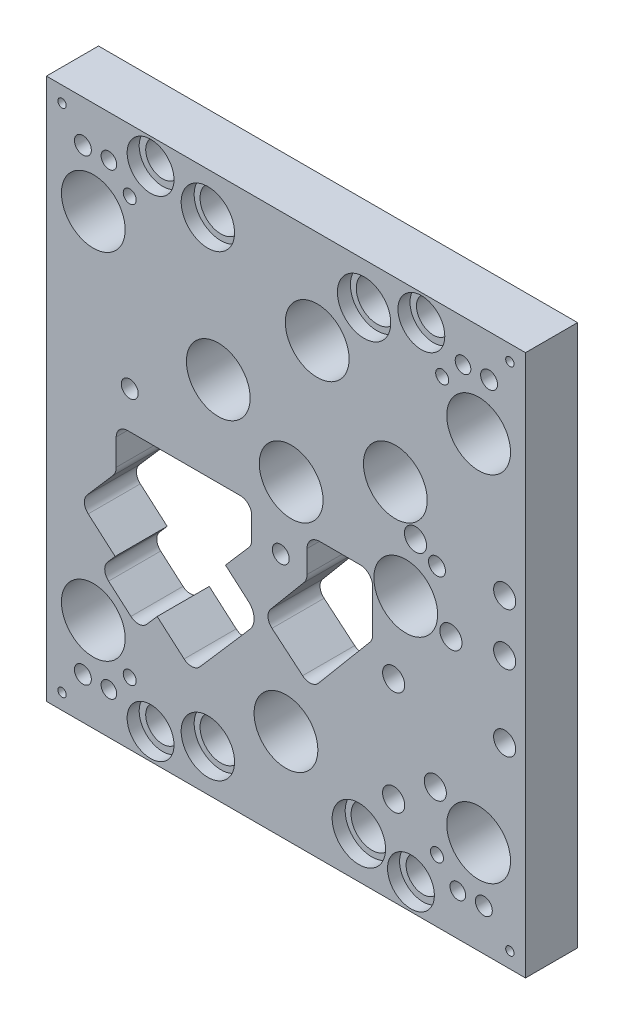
ISO-10303-21;
HEADER;
FILE_DESCRIPTION(('STEP AP214'),'2;1');
FILE_NAME('part.step','',(''),(''),'','','');
FILE_SCHEMA(('AUTOMOTIVE_DESIGN { 1 0 10303 214 1 1 1 1 }'));
ENDSEC;
DATA;
#1=APPLICATION_CONTEXT('core data for automotive mechanical design processes');
#2=APPLICATION_PROTOCOL_DEFINITION('international standard','automotive_design',2000,#1);
#3=PRODUCT_CONTEXT('',#1,'mechanical');
#4=PRODUCT('Part','Part','',(#3));
#5=PRODUCT_RELATED_PRODUCT_CATEGORY('part','',(#4));
#6=PRODUCT_DEFINITION_FORMATION('','',#4);
#7=PRODUCT_DEFINITION_CONTEXT('part definition',#1,'design');
#8=PRODUCT_DEFINITION('design','',#6,#7);
#9=PRODUCT_DEFINITION_SHAPE('','',#8);
#10=(LENGTH_UNIT() NAMED_UNIT(*) SI_UNIT(.MILLI.,.METRE.));
#11=(NAMED_UNIT(*) PLANE_ANGLE_UNIT() SI_UNIT($,.RADIAN.));
#12=(NAMED_UNIT(*) SI_UNIT($,.STERADIAN.) SOLID_ANGLE_UNIT());
#13=UNCERTAINTY_MEASURE_WITH_UNIT(LENGTH_MEASURE(1.E-05),#10,'distance_accuracy_value','');
#14=(GEOMETRIC_REPRESENTATION_CONTEXT(3) GLOBAL_UNCERTAINTY_ASSIGNED_CONTEXT((#13)) GLOBAL_UNIT_ASSIGNED_CONTEXT((#10,
#11,#12)) REPRESENTATION_CONTEXT('',''));
#15=CARTESIAN_POINT('',(0.,0.,0.));
#16=DIRECTION('',(0.,0.,1.));
#17=DIRECTION('',(1.,0.,0.));
#18=AXIS2_PLACEMENT_3D('',#15,#16,#17);
#19=CARTESIAN_POINT('',(-452.12,-180.975,31.75));
#20=DIRECTION('',(-1.,0.,0.));
#21=DIRECTION('',(0.,0.,1.));
#22=AXIS2_PLACEMENT_3D('',#19,#20,#21);
#23=PLANE('',#22);
#24=DIRECTION('',(0.,1.,0.));
#25=VECTOR('',#24,1.);
#26=CARTESIAN_POINT('',(-452.12,-180.975,0.));
#27=LINE('',#26,#25);
#28=CARTESIAN_POINT('',(-452.12,-180.975,0.));
#29=VERTEX_POINT('',#28);
#30=CARTESIAN_POINT('',(-452.12,149.225,0.));
#31=VERTEX_POINT('',#30);
#32=EDGE_CURVE('E553',#29,#31,#27,.T.);
#33=ORIENTED_EDGE('',*,*,#32,.T.);
#34=DIRECTION('',(0.,0.,-1.));
#35=VECTOR('',#34,1.);
#36=CARTESIAN_POINT('',(-452.12,149.225,31.75));
#37=LINE('',#36,#35);
#38=CARTESIAN_POINT('',(-452.12,149.225,31.75));
#39=VERTEX_POINT('',#38);
#40=EDGE_CURVE('E11',#39,#31,#37,.T.);
#41=ORIENTED_EDGE('',*,*,#40,.F.);
#42=DIRECTION('',(0.,1.,0.));
#43=VECTOR('',#42,1.);
#44=CARTESIAN_POINT('',(-452.12,-180.975,31.75));
#45=LINE('',#44,#43);
#46=CARTESIAN_POINT('',(-452.12,-180.975,31.75));
#47=VERTEX_POINT('',#46);
#48=EDGE_CURVE('E565',#47,#39,#45,.T.);
#49=ORIENTED_EDGE('',*,*,#48,.F.);
#50=DIRECTION('',(0.,0.,-1.));
#51=VECTOR('',#50,1.);
#52=CARTESIAN_POINT('',(-452.12,-180.975,31.75));
#53=LINE('',#52,#51);
#54=EDGE_CURVE('E576',#47,#29,#53,.T.);
#55=ORIENTED_EDGE('',*,*,#54,.T.);
#56=EDGE_LOOP('',(#33,#41,#49,#55));
#57=FACE_BOUND('',#56,.T.);
#58=ADVANCED_FACE('F53',(#57),#23,.F.);
#59=CARTESIAN_POINT('',(-452.12,149.225,31.75));
#60=DIRECTION('',(0.,-1.,0.));
#61=DIRECTION('',(0.,0.,-1.));
#62=AXIS2_PLACEMENT_3D('',#59,#60,#61);
#63=PLANE('',#62);
#64=DIRECTION('',(-1.,0.,0.));
#65=VECTOR('',#64,1.);
#66=CARTESIAN_POINT('',(-452.12,149.225,0.));
#67=LINE('',#66,#65);
#68=CARTESIAN_POINT('',(-744.22,149.225,0.));
#69=VERTEX_POINT('',#68);
#70=EDGE_CURVE('E580',#31,#69,#67,.T.);
#71=ORIENTED_EDGE('',*,*,#70,.T.);
#72=DIRECTION('',(0.,0.,-1.));
#73=VECTOR('',#72,1.);
#74=CARTESIAN_POINT('',(-744.22,149.225,31.75));
#75=LINE('',#74,#73);
#76=CARTESIAN_POINT('',(-744.22,149.225,31.75));
#77=VERTEX_POINT('',#76);
#78=EDGE_CURVE('E60',#77,#69,#75,.T.);
#79=ORIENTED_EDGE('',*,*,#78,.F.);
#80=DIRECTION('',(-1.,0.,0.));
#81=VECTOR('',#80,1.);
#82=CARTESIAN_POINT('',(-452.12,149.225,31.75));
#83=LINE('',#82,#81);
#84=EDGE_CURVE('E569',#39,#77,#83,.T.);
#85=ORIENTED_EDGE('',*,*,#84,.F.);
#86=ORIENTED_EDGE('',*,*,#40,.T.);
#87=EDGE_LOOP('',(#71,#79,#85,#86));
#88=FACE_BOUND('',#87,.T.);
#89=ADVANCED_FACE('F609',(#88),#63,.F.);
#90=CARTESIAN_POINT('',(-744.22,149.225,31.75));
#91=DIRECTION('',(1.,0.,0.));
#92=DIRECTION('',(0.,0.,-1.));
#93=AXIS2_PLACEMENT_3D('',#90,#91,#92);
#94=PLANE('',#93);
#95=DIRECTION('',(0.,-1.,0.));
#96=VECTOR('',#95,1.);
#97=CARTESIAN_POINT('',(-744.22,149.225,0.));
#98=LINE('',#97,#96);
#99=CARTESIAN_POINT('',(-744.22,-180.975,0.));
#100=VERTEX_POINT('',#99);
#101=EDGE_CURVE('E582',#69,#100,#98,.T.);
#102=ORIENTED_EDGE('',*,*,#101,.T.);
#103=DIRECTION('',(0.,0.,-1.));
#104=VECTOR('',#103,1.);
#105=CARTESIAN_POINT('',(-744.22,-180.975,31.75));
#106=LINE('',#105,#104);
#107=CARTESIAN_POINT('',(-744.22,-180.975,31.75));
#108=VERTEX_POINT('',#107);
#109=EDGE_CURVE('E587',#108,#100,#106,.T.);
#110=ORIENTED_EDGE('',*,*,#109,.F.);
#111=DIRECTION('',(0.,-1.,0.));
#112=VECTOR('',#111,1.);
#113=CARTESIAN_POINT('',(-744.22,149.225,31.75));
#114=LINE('',#113,#112);
#115=EDGE_CURVE('E572',#77,#108,#114,.T.);
#116=ORIENTED_EDGE('',*,*,#115,.F.);
#117=ORIENTED_EDGE('',*,*,#78,.T.);
#118=EDGE_LOOP('',(#102,#110,#116,#117));
#119=FACE_BOUND('',#118,.T.);
#120=ADVANCED_FACE('F594',(#119),#94,.F.);
#121=CARTESIAN_POINT('',(-744.22,-180.975,31.75));
#122=DIRECTION('',(0.,1.,0.));
#123=DIRECTION('',(-1.,0.,0.));
#124=AXIS2_PLACEMENT_3D('',#121,#122,#123);
#125=PLANE('',#124);
#126=DIRECTION('',(1.,0.,0.));
#127=VECTOR('',#126,1.);
#128=CARTESIAN_POINT('',(-744.22,-180.975,0.));
#129=LINE('',#128,#127);
#130=EDGE_CURVE('E570',#100,#29,#129,.T.);
#131=ORIENTED_EDGE('',*,*,#130,.T.);
#132=ORIENTED_EDGE('',*,*,#54,.F.);
#133=DIRECTION('',(1.,0.,0.));
#134=VECTOR('',#133,1.);
#135=CARTESIAN_POINT('',(-744.22,-180.975,31.75));
#136=LINE('',#135,#134);
#137=EDGE_CURVE('E574',#108,#47,#136,.T.);
#138=ORIENTED_EDGE('',*,*,#137,.F.);
#139=ORIENTED_EDGE('',*,*,#109,.T.);
#140=EDGE_LOOP('',(#131,#132,#138,#139));
#141=FACE_BOUND('',#140,.T.);
#142=ADVANCED_FACE('F602',(#141),#125,.F.);
#143=CARTESIAN_POINT('',(0.,0.,31.75));
#144=DIRECTION('',(0.,0.,1.));
#145=DIRECTION('',(1.,0.,0.));
#146=AXIS2_PLACEMENT_3D('',#143,#144,#145);
#147=PLANE('',#146);
#148=CARTESIAN_POINT('',(-532.511,-126.6825,31.75));
#149=DIRECTION('',(0.,0.,1.));
#150=DIRECTION('',(1.,0.,0.));
#151=AXIS2_PLACEMENT_3D('',#148,#149,#150);
#152=CIRCLE('',#151,6.74687500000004);
#153=CARTESIAN_POINT('',(-525.764125,-126.6825,31.75));
#154=VERTEX_POINT('',#153);
#155=EDGE_CURVE('E1092',#154,#154,#152,.T.);
#156=ORIENTED_EDGE('',*,*,#155,.F.);
#157=EDGE_LOOP('',(#156));
#158=FACE_BOUND('',#157,.T.);
#159=CARTESIAN_POINT('',(-507.111,-107.6325,31.75));
#160=DIRECTION('',(0.,0.,1.));
#161=DIRECTION('',(1.,0.,0.));
#162=AXIS2_PLACEMENT_3D('',#159,#160,#161);
#163=CIRCLE('',#162,6.74687500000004);
#164=CARTESIAN_POINT('',(-500.364125,-107.6325,31.75));
#165=VERTEX_POINT('',#164);
#166=EDGE_CURVE('E1096',#165,#165,#163,.T.);
#167=ORIENTED_EDGE('',*,*,#166,.F.);
#168=EDGE_LOOP('',(#167));
#169=FACE_BOUND('',#168,.T.);
#170=CARTESIAN_POINT('',(-464.82,14.605,31.75));
#171=DIRECTION('',(0.,0.,1.));
#172=DIRECTION('',(1.,0.,0.));
#173=AXIS2_PLACEMENT_3D('',#170,#171,#172);
#174=CIRCLE('',#173,6.74687499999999);
#175=CARTESIAN_POINT('',(-458.073125,14.605,31.75));
#176=VERTEX_POINT('',#175);
#177=EDGE_CURVE('E1106',#176,#176,#174,.T.);
#178=ORIENTED_EDGE('',*,*,#177,.F.);
#179=EDGE_LOOP('',(#178));
#180=FACE_BOUND('',#179,.T.);
#181=CARTESIAN_POINT('',(-519.176,17.145,31.75));
#182=DIRECTION('',(0.,0.,1.));
#183=DIRECTION('',(1.,0.,0.));
#184=AXIS2_PLACEMENT_3D('',#181,#182,#183);
#185=CIRCLE('',#184,6.74687500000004);
#186=CARTESIAN_POINT('',(-512.429125,17.145,31.75));
#187=VERTEX_POINT('',#186);
#188=EDGE_CURVE('E1114',#187,#187,#185,.T.);
#189=ORIENTED_EDGE('',*,*,#188,.F.);
#190=EDGE_LOOP('',(#189));
#191=FACE_BOUND('',#190,.T.);
#192=CARTESIAN_POINT('',(-532.511,-63.1825,31.75));
#193=DIRECTION('',(0.,0.,1.));
#194=DIRECTION('',(1.,0.,0.));
#195=AXIS2_PLACEMENT_3D('',#192,#193,#194);
#196=CIRCLE('',#195,6.74687500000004);
#197=CARTESIAN_POINT('',(-525.764125,-63.1825,31.75));
#198=VERTEX_POINT('',#197);
#199=EDGE_CURVE('E1121',#198,#198,#196,.T.);
#200=ORIENTED_EDGE('',*,*,#199,.F.);
#201=EDGE_LOOP('',(#200));
#202=FACE_BOUND('',#201,.T.);
#203=CARTESIAN_POINT('',(-497.586,-23.495,31.75));
#204=DIRECTION('',(0.,0.,1.));
#205=DIRECTION('',(1.,0.,0.));
#206=AXIS2_PLACEMENT_3D('',#203,#204,#205);
#207=CIRCLE('',#206,6.74687499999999);
#208=CARTESIAN_POINT('',(-490.839125,-23.495,31.75));
#209=VERTEX_POINT('',#208);
#210=EDGE_CURVE('E1127',#209,#209,#207,.T.);
#211=ORIENTED_EDGE('',*,*,#210,.F.);
#212=EDGE_LOOP('',(#211));
#213=FACE_BOUND('',#212,.T.);
#214=CARTESIAN_POINT('',(-464.82,-63.1825,31.75));
#215=DIRECTION('',(0.,0.,1.));
#216=DIRECTION('',(1.,0.,0.));
#217=AXIS2_PLACEMENT_3D('',#214,#215,#216);
#218=CIRCLE('',#217,6.74687499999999);
#219=CARTESIAN_POINT('',(-458.073125,-63.1825,31.75));
#220=VERTEX_POINT('',#219);
#221=EDGE_CURVE('E1133',#220,#220,#218,.T.);
#222=ORIENTED_EDGE('',*,*,#221,.F.);
#223=EDGE_LOOP('',(#222));
#224=FACE_BOUND('',#223,.T.);
#225=CARTESIAN_POINT('',(-464.82,-17.145,31.75));
#226=DIRECTION('',(0.,0.,1.));
#227=DIRECTION('',(1.,0.,0.));
#228=AXIS2_PLACEMENT_3D('',#225,#226,#227);
#229=CIRCLE('',#228,6.74687499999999);
#230=CARTESIAN_POINT('',(-458.073125,-17.145,31.75));
#231=VERTEX_POINT('',#230);
#232=EDGE_CURVE('E1139',#231,#231,#229,.T.);
#233=ORIENTED_EDGE('',*,*,#232,.F.);
#234=EDGE_LOOP('',(#233));
#235=FACE_BOUND('',#234,.T.);
#236=CARTESIAN_POINT('',(-525.145,-15.875,31.75));
#237=DIRECTION('',(0.,0.,1.));
#238=DIRECTION('',(1.,0.,0.));
#239=AXIS2_PLACEMENT_3D('',#236,#237,#238);
#240=CIRCLE('',#239,19.4437);
#241=CARTESIAN_POINT('',(-505.7013,-15.875,31.75));
#242=VERTEX_POINT('',#241);
#243=EDGE_CURVE('E1145',#242,#242,#240,.T.);
#244=ORIENTED_EDGE('',*,*,#243,.F.);
#245=EDGE_LOOP('',(#244));
#246=FACE_BOUND('',#245,.T.);
#247=CARTESIAN_POINT('',(-480.695,-123.825,31.75));
#248=DIRECTION('',(0.,0.,1.));
#249=DIRECTION('',(1.,0.,0.));
#250=AXIS2_PLACEMENT_3D('',#247,#248,#249);
#251=CIRCLE('',#250,19.4437);
#252=CARTESIAN_POINT('',(-461.2513,-123.825,31.75));
#253=VERTEX_POINT('',#252);
#254=EDGE_CURVE('E1151',#253,#253,#251,.T.);
#255=ORIENTED_EDGE('',*,*,#254,.F.);
#256=EDGE_LOOP('',(#255));
#257=FACE_BOUND('',#256,.T.);
#258=CARTESIAN_POINT('',(-645.795,123.825,31.75));
#259=DIRECTION('',(0.,0.,1.));
#260=DIRECTION('',(1.,0.,0.));
#261=AXIS2_PLACEMENT_3D('',#258,#259,#260);
#262=CIRCLE('',#261,16.271875);
#263=CARTESIAN_POINT('',(-629.523125,123.825,31.75));
#264=VERTEX_POINT('',#263);
#265=EDGE_CURVE('E1154',#264,#264,#262,.T.);
#266=ORIENTED_EDGE('',*,*,#265,.F.);
#267=EDGE_LOOP('',(#266));
#268=FACE_BOUND('',#267,.T.);
#269=CARTESIAN_POINT('',(-550.545,123.825,31.75));
#270=DIRECTION('',(0.,0.,1.));
#271=DIRECTION('',(1.,0.,0.));
#272=AXIS2_PLACEMENT_3D('',#269,#270,#271);
#273=CIRCLE('',#272,16.271875);
#274=CARTESIAN_POINT('',(-534.273125,123.825,31.75));
#275=VERTEX_POINT('',#274);
#276=EDGE_CURVE('E1167',#275,#275,#273,.T.);
#277=ORIENTED_EDGE('',*,*,#276,.F.);
#278=EDGE_LOOP('',(#277));
#279=FACE_BOUND('',#278,.T.);
#280=CARTESIAN_POINT('',(-553.72,-155.575,31.75));
#281=DIRECTION('',(0.,0.,1.));
#282=DIRECTION('',(1.,0.,0.));
#283=AXIS2_PLACEMENT_3D('',#280,#281,#282);
#284=CIRCLE('',#283,16.2718749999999);
#285=CARTESIAN_POINT('',(-537.448125,-155.575,31.75));
#286=VERTEX_POINT('',#285);
#287=EDGE_CURVE('E1179',#286,#286,#284,.T.);
#288=ORIENTED_EDGE('',*,*,#287,.F.);
#289=EDGE_LOOP('',(#288));
#290=FACE_BOUND('',#289,.T.);
#291=CARTESIAN_POINT('',(-645.795,-155.575,31.75));
#292=DIRECTION('',(0.,0.,1.));
#293=DIRECTION('',(1.,0.,0.));
#294=AXIS2_PLACEMENT_3D('',#291,#292,#293);
#295=CIRCLE('',#294,16.271875);
#296=CARTESIAN_POINT('',(-629.523125,-155.575,31.75));
#297=VERTEX_POINT('',#296);
#298=EDGE_CURVE('E1191',#297,#297,#295,.T.);
#299=ORIENTED_EDGE('',*,*,#298,.F.);
#300=EDGE_LOOP('',(#299));
#301=FACE_BOUND('',#300,.T.);
#302=CARTESIAN_POINT('',(-734.695,139.7,31.75));
#303=DIRECTION('',(0.,0.,1.));
#304=DIRECTION('',(1.,0.,0.));
#305=AXIS2_PLACEMENT_3D('',#302,#303,#304);
#306=CIRCLE('',#305,2.55269999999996);
#307=CARTESIAN_POINT('',(-732.1423,139.7,31.75));
#308=VERTEX_POINT('',#307);
#309=EDGE_CURVE('E1206',#308,#308,#306,.T.);
#310=ORIENTED_EDGE('',*,*,#309,.F.);
#311=EDGE_LOOP('',(#310));
#312=FACE_BOUND('',#311,.T.);
#313=CARTESIAN_POINT('',(-461.645,139.7,31.75));
#314=DIRECTION('',(0.,0.,1.));
#315=DIRECTION('',(1.,0.,0.));
#316=AXIS2_PLACEMENT_3D('',#313,#314,#315);
#317=CIRCLE('',#316,2.55270000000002);
#318=CARTESIAN_POINT('',(-459.0923,139.7,31.75));
#319=VERTEX_POINT('',#318);
#320=EDGE_CURVE('E1212',#319,#319,#317,.T.);
#321=ORIENTED_EDGE('',*,*,#320,.F.);
#322=EDGE_LOOP('',(#321));
#323=FACE_BOUND('',#322,.T.);
#324=CARTESIAN_POINT('',(-461.645,-171.45,31.75));
#325=DIRECTION('',(0.,0.,1.));
#326=DIRECTION('',(1.,0.,0.));
#327=AXIS2_PLACEMENT_3D('',#324,#325,#326);
#328=CIRCLE('',#327,2.55270000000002);
#329=CARTESIAN_POINT('',(-459.0923,-171.45,31.75));
#330=VERTEX_POINT('',#329);
#331=EDGE_CURVE('E1218',#330,#330,#328,.T.);
#332=ORIENTED_EDGE('',*,*,#331,.F.);
#333=EDGE_LOOP('',(#332));
#334=FACE_BOUND('',#333,.T.);
#335=CARTESIAN_POINT('',(-734.695,-171.45,31.75));
#336=DIRECTION('',(0.,0.,1.));
#337=DIRECTION('',(1.,0.,0.));
#338=AXIS2_PLACEMENT_3D('',#335,#336,#337);
#339=CIRCLE('',#338,2.55269999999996);
#340=CARTESIAN_POINT('',(-732.1423,-171.45,31.75));
#341=VERTEX_POINT('',#340);
#342=EDGE_CURVE('E1224',#341,#341,#339,.T.);
#343=ORIENTED_EDGE('',*,*,#342,.F.);
#344=EDGE_LOOP('',(#343));
#345=FACE_BOUND('',#344,.T.);
#346=CARTESIAN_POINT('',(-693.42,-142.875,31.75));
#347=DIRECTION('',(0.,0.,-1.));
#348=DIRECTION('',(-1.,0.,0.));
#349=AXIS2_PLACEMENT_3D('',#346,#347,#348);
#350=CIRCLE('',#349,3.96874999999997);
#351=CARTESIAN_POINT('',(-697.38875,-142.875,31.75));
#352=VERTEX_POINT('',#351);
#353=EDGE_CURVE('E1227',#352,#352,#350,.T.);
#354=ORIENTED_EDGE('',*,*,#353,.T.);
#355=EDGE_LOOP('',(#354));
#356=FACE_BOUND('',#355,.T.);
#357=CARTESIAN_POINT('',(-506.095,-142.875,31.75));
#358=DIRECTION('',(0.,0.,-1.));
#359=DIRECTION('',(-1.,0.,0.));
#360=AXIS2_PLACEMENT_3D('',#357,#358,#359);
#361=CIRCLE('',#360,3.96874999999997);
#362=CARTESIAN_POINT('',(-510.06375,-142.875,31.75));
#363=VERTEX_POINT('',#362);
#364=EDGE_CURVE('E1239',#363,#363,#361,.T.);
#365=ORIENTED_EDGE('',*,*,#364,.T.);
#366=EDGE_LOOP('',(#365));
#367=FACE_BOUND('',#366,.T.);
#368=CARTESIAN_POINT('',(-502.92,111.125,31.75));
#369=DIRECTION('',(0.,0.,-1.));
#370=DIRECTION('',(-1.,0.,0.));
#371=AXIS2_PLACEMENT_3D('',#368,#369,#370);
#372=CIRCLE('',#371,3.96875000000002);
#373=CARTESIAN_POINT('',(-506.88875,111.125,31.75));
#374=VERTEX_POINT('',#373);
#375=EDGE_CURVE('E1251',#374,#374,#372,.T.);
#376=ORIENTED_EDGE('',*,*,#375,.T.);
#377=EDGE_LOOP('',(#376));
#378=FACE_BOUND('',#377,.T.);
#379=CARTESIAN_POINT('',(-693.42,111.125,31.75));
#380=DIRECTION('',(0.,0.,-1.));
#381=DIRECTION('',(-1.,0.,0.));
#382=AXIS2_PLACEMENT_3D('',#379,#380,#381);
#383=CIRCLE('',#382,3.96874999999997);
#384=CARTESIAN_POINT('',(-697.38875,111.125,31.75));
#385=VERTEX_POINT('',#384);
#386=EDGE_CURVE('E1263',#385,#385,#383,.T.);
#387=ORIENTED_EDGE('',*,*,#386,.T.);
#388=EDGE_LOOP('',(#387));
#389=FACE_BOUND('',#388,.T.);
#390=CARTESIAN_POINT('',(-493.395,-155.575,31.75));
#391=DIRECTION('',(0.,0.,1.));
#392=DIRECTION('',(1.,0.,0.));
#393=AXIS2_PLACEMENT_3D('',#390,#391,#392);
#394=CIRCLE('',#393,4.7625);
#395=CARTESIAN_POINT('',(-488.6325,-155.575,31.75));
#396=VERTEX_POINT('',#395);
#397=EDGE_CURVE('E1278',#396,#396,#394,.T.);
#398=ORIENTED_EDGE('',*,*,#397,.F.);
#399=EDGE_LOOP('',(#398));
#400=FACE_BOUND('',#399,.T.);
#401=CARTESIAN_POINT('',(-706.12,-155.575,31.75));
#402=DIRECTION('',(0.,0.,1.));
#403=DIRECTION('',(1.,0.,0.));
#404=AXIS2_PLACEMENT_3D('',#401,#402,#403);
#405=CIRCLE('',#404,4.7625);
#406=CARTESIAN_POINT('',(-701.3575,-155.575,31.75));
#407=VERTEX_POINT('',#406);
#408=EDGE_CURVE('E1284',#407,#407,#405,.T.);
#409=ORIENTED_EDGE('',*,*,#408,.F.);
#410=EDGE_LOOP('',(#409));
#411=FACE_BOUND('',#410,.T.);
#412=CARTESIAN_POINT('',(-706.12,123.825,31.75));
#413=DIRECTION('',(0.,0.,1.));
#414=DIRECTION('',(1.,0.,0.));
#415=AXIS2_PLACEMENT_3D('',#412,#413,#414);
#416=CIRCLE('',#415,4.7625);
#417=CARTESIAN_POINT('',(-701.3575,123.825,31.75));
#418=VERTEX_POINT('',#417);
#419=EDGE_CURVE('E1290',#418,#418,#416,.T.);
#420=ORIENTED_EDGE('',*,*,#419,.F.);
#421=EDGE_LOOP('',(#420));
#422=FACE_BOUND('',#421,.T.);
#423=CARTESIAN_POINT('',(-490.22,123.825,31.75));
#424=DIRECTION('',(0.,0.,1.));
#425=DIRECTION('',(1.,0.,0.));
#426=AXIS2_PLACEMENT_3D('',#423,#424,#425);
#427=CIRCLE('',#426,4.7625);
#428=CARTESIAN_POINT('',(-485.4575,123.825,31.75));
#429=VERTEX_POINT('',#428);
#430=EDGE_CURVE('E1296',#429,#429,#427,.T.);
#431=ORIENTED_EDGE('',*,*,#430,.F.);
#432=EDGE_LOOP('',(#431));
#433=FACE_BOUND('',#432,.T.);
#434=CARTESIAN_POINT('',(-721.995,123.825,31.75));
#435=DIRECTION('',(0.,0.,-1.));
#436=DIRECTION('',(-1.,0.,0.));
#437=AXIS2_PLACEMENT_3D('',#434,#435,#436);
#438=CIRCLE('',#437,5.15619999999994);
#439=CARTESIAN_POINT('',(-727.1512,123.825,31.75));
#440=VERTEX_POINT('',#439);
#441=EDGE_CURVE('E1299',#440,#440,#438,.T.);
#442=ORIENTED_EDGE('',*,*,#441,.T.);
#443=EDGE_LOOP('',(#442));
#444=FACE_BOUND('',#443,.T.);
#445=CARTESIAN_POINT('',(-474.345,123.825,31.75));
#446=DIRECTION('',(0.,0.,-1.));
#447=DIRECTION('',(-1.,0.,0.));
#448=AXIS2_PLACEMENT_3D('',#445,#446,#447);
#449=CIRCLE('',#448,5.1562);
#450=CARTESIAN_POINT('',(-479.5012,123.825,31.75));
#451=VERTEX_POINT('',#450);
#452=EDGE_CURVE('E1311',#451,#451,#449,.T.);
#453=ORIENTED_EDGE('',*,*,#452,.T.);
#454=EDGE_LOOP('',(#453));
#455=FACE_BOUND('',#454,.T.);
#456=CARTESIAN_POINT('',(-477.52,-155.575,31.75));
#457=DIRECTION('',(0.,0.,-1.));
#458=DIRECTION('',(-1.,0.,0.));
#459=AXIS2_PLACEMENT_3D('',#456,#457,#458);
#460=CIRCLE('',#459,5.1562);
#461=CARTESIAN_POINT('',(-482.6762,-155.575,31.75));
#462=VERTEX_POINT('',#461);
#463=EDGE_CURVE('E1323',#462,#462,#460,.T.);
#464=ORIENTED_EDGE('',*,*,#463,.T.);
#465=EDGE_LOOP('',(#464));
#466=FACE_BOUND('',#465,.T.);
#467=CARTESIAN_POINT('',(-721.995,-155.575,31.75));
#468=DIRECTION('',(0.,0.,-1.));
#469=DIRECTION('',(-1.,0.,0.));
#470=AXIS2_PLACEMENT_3D('',#467,#468,#469);
#471=CIRCLE('',#470,5.15619999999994);
#472=CARTESIAN_POINT('',(-727.1512,-155.575,31.75));
#473=VERTEX_POINT('',#472);
#474=EDGE_CURVE('E1335',#473,#473,#471,.T.);
#475=ORIENTED_EDGE('',*,*,#474,.T.);
#476=EDGE_LOOP('',(#475));
#477=FACE_BOUND('',#476,.T.);
#478=CARTESIAN_POINT('',(-601.345,-31.75,31.75));
#479=DIRECTION('',(0.,0.,-1.));
#480=DIRECTION('',(-1.,0.,0.));
#481=AXIS2_PLACEMENT_3D('',#478,#479,#480);
#482=CIRCLE('',#481,5.15619999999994);
#483=CARTESIAN_POINT('',(-606.5012,-31.75,31.75));
#484=VERTEX_POINT('',#483);
#485=EDGE_CURVE('E1347',#484,#484,#482,.T.);
#486=ORIENTED_EDGE('',*,*,#485,.T.);
#487=EDGE_LOOP('',(#486));
#488=FACE_BOUND('',#487,.T.);
#489=CARTESIAN_POINT('',(-506.095,9.52499999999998,31.75));
#490=DIRECTION('',(0.,0.,-1.));
#491=DIRECTION('',(-1.,0.,0.));
#492=AXIS2_PLACEMENT_3D('',#489,#490,#491);
#493=CIRCLE('',#492,5.15619999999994);
#494=CARTESIAN_POINT('',(-511.2512,9.52499999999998,31.75));
#495=VERTEX_POINT('',#494);
#496=EDGE_CURVE('E1359',#495,#495,#493,.T.);
#497=ORIENTED_EDGE('',*,*,#496,.T.);
#498=EDGE_LOOP('',(#497));
#499=FACE_BOUND('',#498,.T.);
#500=CARTESIAN_POINT('',(-693.42,9.52499999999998,31.75));
#501=DIRECTION('',(0.,0.,-1.));
#502=DIRECTION('',(-1.,0.,0.));
#503=AXIS2_PLACEMENT_3D('',#500,#501,#502);
#504=CIRCLE('',#503,5.15619999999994);
#505=CARTESIAN_POINT('',(-698.5762,9.52499999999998,31.75));
#506=VERTEX_POINT('',#505);
#507=EDGE_CURVE('E1375',#506,#506,#504,.T.);
#508=ORIENTED_EDGE('',*,*,#507,.T.);
#509=EDGE_LOOP('',(#508));
#510=FACE_BOUND('',#509,.T.);
#511=CARTESIAN_POINT('',(-521.97,-165.1,31.75));
#512=DIRECTION('',(0.,0.,1.));
#513=DIRECTION('',(1.,0.,0.));
#514=AXIS2_PLACEMENT_3D('',#511,#512,#513);
#515=CIRCLE('',#514,14.2875);
#516=CARTESIAN_POINT('',(-507.6825,-165.1,31.75));
#517=VERTEX_POINT('',#516);
#518=EDGE_CURVE('E1396',#517,#517,#515,.T.);
#519=ORIENTED_EDGE('',*,*,#518,.F.);
#520=EDGE_LOOP('',(#519));
#521=FACE_BOUND('',#520,.T.);
#522=CARTESIAN_POINT('',(-515.62,133.35,31.75));
#523=DIRECTION('',(0.,0.,1.));
#524=DIRECTION('',(1.,0.,0.));
#525=AXIS2_PLACEMENT_3D('',#522,#523,#524);
#526=CIRCLE('',#525,14.2875);
#527=CARTESIAN_POINT('',(-501.3325,133.35,31.75));
#528=VERTEX_POINT('',#527);
#529=EDGE_CURVE('E1408',#528,#528,#526,.T.);
#530=ORIENTED_EDGE('',*,*,#529,.F.);
#531=EDGE_LOOP('',(#530));
#532=FACE_BOUND('',#531,.T.);
#533=CARTESIAN_POINT('',(-680.72,133.35,31.75));
#534=DIRECTION('',(0.,0.,1.));
#535=DIRECTION('',(1.,0.,0.));
#536=AXIS2_PLACEMENT_3D('',#533,#534,#535);
#537=CIRCLE('',#536,14.2875);
#538=CARTESIAN_POINT('',(-666.4325,133.35,31.75));
#539=VERTEX_POINT('',#538);
#540=EDGE_CURVE('E1420',#539,#539,#537,.T.);
#541=ORIENTED_EDGE('',*,*,#540,.F.);
#542=EDGE_LOOP('',(#541));
#543=FACE_BOUND('',#542,.T.);
#544=CARTESIAN_POINT('',(-680.72,-165.1,31.75));
#545=DIRECTION('',(0.,0.,1.));
#546=DIRECTION('',(1.,0.,0.));
#547=AXIS2_PLACEMENT_3D('',#544,#545,#546);
#548=CIRCLE('',#547,14.2875);
#549=CARTESIAN_POINT('',(-666.4325,-165.1,31.75));
#550=VERTEX_POINT('',#549);
#551=EDGE_CURVE('E1432',#550,#550,#548,.T.);
#552=ORIENTED_EDGE('',*,*,#551,.F.);
#553=EDGE_LOOP('',(#552));
#554=FACE_BOUND('',#553,.T.);
#555=CARTESIAN_POINT('',(-480.695,92.075,31.75));
#556=DIRECTION('',(0.,0.,1.));
#557=DIRECTION('',(1.,0.,0.));
#558=AXIS2_PLACEMENT_3D('',#555,#556,#557);
#559=CIRCLE('',#558,19.4437);
#560=CARTESIAN_POINT('',(-461.2513,92.075,31.75));
#561=VERTEX_POINT('',#560);
#562=EDGE_CURVE('E1439',#561,#561,#559,.T.);
#563=ORIENTED_EDGE('',*,*,#562,.F.);
#564=EDGE_LOOP('',(#563));
#565=FACE_BOUND('',#564,.T.);
#566=CARTESIAN_POINT('',(-715.645,92.075,31.75));
#567=DIRECTION('',(0.,0.,1.));
#568=DIRECTION('',(1.,0.,0.));
#569=AXIS2_PLACEMENT_3D('',#566,#567,#568);
#570=CIRCLE('',#569,19.4437);
#571=CARTESIAN_POINT('',(-696.2013,92.075,31.75));
#572=VERTEX_POINT('',#571);
#573=EDGE_CURVE('E1446',#572,#572,#570,.T.);
#574=ORIENTED_EDGE('',*,*,#573,.F.);
#575=EDGE_LOOP('',(#574));
#576=FACE_BOUND('',#575,.T.);
#577=CARTESIAN_POINT('',(-715.645,-123.825,31.75));
#578=DIRECTION('',(0.,0.,1.));
#579=DIRECTION('',(1.,0.,0.));
#580=AXIS2_PLACEMENT_3D('',#577,#578,#579);
#581=CIRCLE('',#580,19.4437);
#582=CARTESIAN_POINT('',(-696.2013,-123.825,31.75));
#583=VERTEX_POINT('',#582);
#584=EDGE_CURVE('E1452',#583,#583,#581,.T.);
#585=ORIENTED_EDGE('',*,*,#584,.F.);
#586=EDGE_LOOP('',(#585));
#587=FACE_BOUND('',#586,.T.);
#588=CARTESIAN_POINT('',(-639.445,41.275,31.75));
#589=DIRECTION('',(0.,0.,1.));
#590=DIRECTION('',(1.,0.,0.));
#591=AXIS2_PLACEMENT_3D('',#588,#589,#590);
#592=CIRCLE('',#591,19.4437);
#593=CARTESIAN_POINT('',(-620.0013,41.275,31.75));
#594=VERTEX_POINT('',#593);
#595=EDGE_CURVE('E1459',#594,#594,#592,.T.);
#596=ORIENTED_EDGE('',*,*,#595,.F.);
#597=EDGE_LOOP('',(#596));
#598=FACE_BOUND('',#597,.T.);
#599=CARTESIAN_POINT('',(-531.495,41.275,31.75));
#600=DIRECTION('',(0.,0.,1.));
#601=DIRECTION('',(1.,0.,0.));
#602=AXIS2_PLACEMENT_3D('',#599,#600,#601);
#603=CIRCLE('',#602,19.4437);
#604=CARTESIAN_POINT('',(-512.0513,41.275,31.75));
#605=VERTEX_POINT('',#604);
#606=EDGE_CURVE('E1467',#605,#605,#603,.T.);
#607=ORIENTED_EDGE('',*,*,#606,.F.);
#608=EDGE_LOOP('',(#607));
#609=FACE_BOUND('',#608,.T.);
#610=CARTESIAN_POINT('',(-598.17,-123.825,31.75));
#611=DIRECTION('',(0.,0.,1.));
#612=DIRECTION('',(1.,0.,0.));
#613=AXIS2_PLACEMENT_3D('',#610,#611,#612);
#614=CIRCLE('',#613,19.4437);
#615=CARTESIAN_POINT('',(-578.7263,-123.825,31.75));
#616=VERTEX_POINT('',#615);
#617=EDGE_CURVE('E1474',#616,#616,#614,.T.);
#618=ORIENTED_EDGE('',*,*,#617,.F.);
#619=EDGE_LOOP('',(#618));
#620=FACE_BOUND('',#619,.T.);
#621=CARTESIAN_POINT('',(-594.995,9.52499999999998,31.75));
#622=DIRECTION('',(0.,0.,1.));
#623=DIRECTION('',(1.,0.,0.));
#624=AXIS2_PLACEMENT_3D('',#621,#622,#623);
#625=CIRCLE('',#624,19.4437);
#626=CARTESIAN_POINT('',(-575.5513,9.52499999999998,31.75));
#627=VERTEX_POINT('',#626);
#628=EDGE_CURVE('E1481',#627,#627,#625,.T.);
#629=ORIENTED_EDGE('',*,*,#628,.F.);
#630=EDGE_LOOP('',(#629));
#631=FACE_BOUND('',#630,.T.);
#632=CARTESIAN_POINT('',(-579.12,92.075,31.75));
#633=DIRECTION('',(0.,0.,1.));
#634=DIRECTION('',(1.,0.,0.));
#635=AXIS2_PLACEMENT_3D('',#632,#633,#634);
#636=CIRCLE('',#635,19.4437);
#637=CARTESIAN_POINT('',(-559.6763,92.075,31.75));
#638=VERTEX_POINT('',#637);
#639=EDGE_CURVE('E318',#638,#638,#636,.T.);
#640=ORIENTED_EDGE('',*,*,#639,.F.);
#641=EDGE_LOOP('',(#640));
#642=FACE_BOUND('',#641,.T.);
#643=CARTESIAN_POINT('',(-577.716152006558,-20.8198728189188,31.75));
#644=DIRECTION('',(0.,0.,1.));
#645=DIRECTION('',(1.,0.,0.));
#646=AXIS2_PLACEMENT_3D('',#643,#644,#645);
#647=CIRCLE('',#646,7.61999999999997);
#648=CARTESIAN_POINT('',(-577.716152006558,-13.1998728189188,31.75));
#649=VERTEX_POINT('',#648);
#650=CARTESIAN_POINT('',(-585.336152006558,-20.8198728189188,31.75));
#651=VERTEX_POINT('',#650);
#652=EDGE_CURVE('E67',#649,#651,#647,.T.);
#653=ORIENTED_EDGE('',*,*,#652,.F.);
#654=DIRECTION('',(-1.,0.,0.));
#655=VECTOR('',#654,1.);
#656=CARTESIAN_POINT('',(-552.951152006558,-13.1998728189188,31.75));
#657=LINE('',#656,#655);
#658=CARTESIAN_POINT('',(-552.951152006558,-13.1998728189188,31.75));
#659=VERTEX_POINT('',#658);
#660=EDGE_CURVE('E311',#659,#649,#657,.T.);
#661=ORIENTED_EDGE('',*,*,#660,.F.);
#662=CARTESIAN_POINT('',(-552.951152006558,-20.8198728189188,31.75));
#663=DIRECTION('',(0.,0.,1.));
#664=DIRECTION('',(1.,0.,0.));
#665=AXIS2_PLACEMENT_3D('',#662,#663,#664);
#666=CIRCLE('',#665,7.61999999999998);
#667=CARTESIAN_POINT('',(-545.331152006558,-20.8198728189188,31.75));
#668=VERTEX_POINT('',#667);
#669=EDGE_CURVE('E315',#668,#659,#666,.T.);
#670=ORIENTED_EDGE('',*,*,#669,.F.);
#671=DIRECTION('',(0.,1.,0.));
#672=VECTOR('',#671,1.);
#673=CARTESIAN_POINT('',(-545.331152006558,-46.5969853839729,31.75));
#674=LINE('',#673,#672);
#675=CARTESIAN_POINT('',(-545.331152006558,-46.5969853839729,31.75));
#676=VERTEX_POINT('',#675);
#677=EDGE_CURVE('E371',#676,#668,#674,.T.);
#678=ORIENTED_EDGE('',*,*,#677,.F.);
#679=CARTESIAN_POINT('',(-552.189152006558,-46.5969853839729,31.75));
#680=DIRECTION('',(0.,0.,1.));
#681=DIRECTION('',(1.,0.,0.));
#682=AXIS2_PLACEMENT_3D('',#679,#680,#681);
#683=CIRCLE('',#682,6.85799999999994);
#684=CARTESIAN_POINT('',(-546.935619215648,-51.0052228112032,31.75));
#685=VERTEX_POINT('',#684);
#686=EDGE_CURVE('E368',#685,#676,#683,.T.);
#687=ORIENTED_EDGE('',*,*,#686,.F.);
#688=DIRECTION('',(0.642787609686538,0.766044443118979,0.));
#689=VECTOR('',#688,1.);
#690=CARTESIAN_POINT('',(-578.351921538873,-88.4457139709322,31.75));
#691=LINE('',#690,#689);
#692=CARTESIAN_POINT('',(-578.351921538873,-88.4457139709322,31.75));
#693=VERTEX_POINT('',#692);
#694=EDGE_CURVE('E365',#693,#685,#691,.T.);
#695=ORIENTED_EDGE('',*,*,#694,.F.);
#696=CARTESIAN_POINT('',(-583.605454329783,-84.0374765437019,31.75));
#697=DIRECTION('',(0.,0.,1.));
#698=DIRECTION('',(1.,0.,0.));
#699=AXIS2_PLACEMENT_3D('',#696,#697,#698);
#700=CIRCLE('',#699,6.85800000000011);
#701=CARTESIAN_POINT('',(-588.013691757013,-89.291009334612,31.75));
#702=VERTEX_POINT('',#701);
#703=EDGE_CURVE('E362',#702,#693,#700,.T.);
#704=ORIENTED_EDGE('',*,*,#703,.F.);
#705=DIRECTION('',(0.766044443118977,-0.642787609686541,0.));
#706=VECTOR('',#705,1.);
#707=CARTESIAN_POINT('',(-606.692919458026,-73.6172762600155,31.75));
#708=LINE('',#707,#706);
#709=CARTESIAN_POINT('',(-606.692919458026,-73.6172762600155,31.75));
#710=VERTEX_POINT('',#709);
#711=EDGE_CURVE('E359',#710,#702,#708,.T.);
#712=ORIENTED_EDGE('',*,*,#711,.F.);
#713=CARTESIAN_POINT('',(-602.284682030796,-68.3637434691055,31.75));
#714=DIRECTION('',(0.,0.,1.));
#715=DIRECTION('',(1.,0.,0.));
#716=AXIS2_PLACEMENT_3D('',#713,#714,#715);
#717=CIRCLE('',#716,6.858);
#718=CARTESIAN_POINT('',(-607.538214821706,-63.9555060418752,31.75));
#719=VERTEX_POINT('',#718);
#720=EDGE_CURVE('E356',#719,#710,#717,.T.);
#721=ORIENTED_EDGE('',*,*,#720,.F.);
#722=DIRECTION('',(-0.642787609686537,-0.76604444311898,0.));
#723=VECTOR('',#722,1.);
#724=CARTESIAN_POINT('',(-587.237742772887,-39.7623455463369,31.75));
#725=LINE('',#724,#723);
#726=CARTESIAN_POINT('',(-587.237742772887,-39.7623455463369,31.75));
#727=VERTEX_POINT('',#726);
#728=EDGE_CURVE('E353',#727,#719,#725,.T.);
#729=ORIENTED_EDGE('',*,*,#728,.F.);
#730=CARTESIAN_POINT('',(-593.464152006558,-34.5377678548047,31.75));
#731=DIRECTION('',(0.,0.,-1.));
#732=DIRECTION('',(1.,0.,0.));
#733=AXIS2_PLACEMENT_3D('',#730,#731,#732);
#734=CIRCLE('',#733,8.12800000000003);
#735=CARTESIAN_POINT('',(-585.336152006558,-34.5377678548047,31.75));
#736=VERTEX_POINT('',#735);
#737=EDGE_CURVE('E350',#736,#727,#734,.T.);
#738=ORIENTED_EDGE('',*,*,#737,.F.);
#739=DIRECTION('',(0.,-1.,0.));
#740=VECTOR('',#739,1.);
#741=CARTESIAN_POINT('',(-585.336152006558,-20.8198728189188,31.75));
#742=LINE('',#741,#740);
#743=EDGE_CURVE('E348',#651,#736,#742,.T.);
#744=ORIENTED_EDGE('',*,*,#743,.F.);
#745=EDGE_LOOP('',(#653,#661,#670,#678,#687,#695,#704,#712,#721,#729,#738,#744));
#746=FACE_BOUND('',#745,.T.);
#747=DIRECTION('',(0.755030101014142,-0.655690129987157,0.));
#748=VECTOR('',#747,1.);
#749=CARTESIAN_POINT('',(-718.732092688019,-69.229481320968,31.75));
#750=LINE('',#749,#748);
#751=CARTESIAN_POINT('',(-718.732092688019,-69.229481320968,31.75));
#752=VERTEX_POINT('',#751);
#753=CARTESIAN_POINT('',(-702.335103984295,-83.4691038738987,31.75));
#754=VERTEX_POINT('',#753);
#755=EDGE_CURVE('E403',#752,#754,#750,.T.);
#756=ORIENTED_EDGE('',*,*,#755,.F.);
#757=CARTESIAN_POINT('',(-714.235369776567,-64.051484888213,31.75));
#758=DIRECTION('',(0.,0.,1.));
#759=DIRECTION('',(1.,0.,0.));
#760=AXIS2_PLACEMENT_3D('',#757,#758,#759);
#761=CIRCLE('',#760,6.85800000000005);
#762=CARTESIAN_POINT('',(-719.413366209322,-59.5547619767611,31.75));
#763=VERTEX_POINT('',#762);
#764=EDGE_CURVE('E430',#763,#752,#761,.T.);
#765=ORIENTED_EDGE('',*,*,#764,.F.);
#766=DIRECTION('',(-0.65569012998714,-0.755030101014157,0.));
#767=VECTOR('',#766,1.);
#768=CARTESIAN_POINT('',(-703.666115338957,-41.4217325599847,31.75));
#769=LINE('',#768,#767);
#770=CARTESIAN_POINT('',(-703.666115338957,-41.4217325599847,31.75));
#771=VERTEX_POINT('',#770);
#772=EDGE_CURVE('E427',#771,#763,#769,.T.);
#773=ORIENTED_EDGE('',*,*,#772,.F.);
#774=CARTESIAN_POINT('',(-709.803,-36.0922831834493,31.75));
#775=DIRECTION('',(0.,0.,-1.));
#776=DIRECTION('',(1.,0.,0.));
#777=AXIS2_PLACEMENT_3D('',#774,#775,#776);
#778=CIRCLE('',#777,8.12799999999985);
#779=CARTESIAN_POINT('',(-701.675,-36.0922831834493,31.75));
#780=VERTEX_POINT('',#779);
#781=EDGE_CURVE('E424',#780,#771,#778,.T.);
#782=ORIENTED_EDGE('',*,*,#781,.F.);
#783=DIRECTION('',(0.,-1.,0.));
#784=VECTOR('',#783,1.);
#785=CARTESIAN_POINT('',(-701.675,-20.0578728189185,31.75));
#786=LINE('',#785,#784);
#787=CARTESIAN_POINT('',(-701.675,-20.0578728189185,31.75));
#788=VERTEX_POINT('',#787);
#789=EDGE_CURVE('E421',#788,#780,#786,.T.);
#790=ORIENTED_EDGE('',*,*,#789,.F.);
#791=CARTESIAN_POINT('',(-694.817,-20.0578728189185,31.75));
#792=DIRECTION('',(0.,0.,1.));
#793=DIRECTION('',(1.,0.,0.));
#794=AXIS2_PLACEMENT_3D('',#791,#792,#793);
#795=CIRCLE('',#794,6.85799999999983);
#796=CARTESIAN_POINT('',(-694.817,-13.1998728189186,31.75));
#797=VERTEX_POINT('',#796);
#798=EDGE_CURVE('E379',#797,#788,#795,.T.);
#799=ORIENTED_EDGE('',*,*,#798,.F.);
#800=DIRECTION('',(-1.,0.,0.));
#801=VECTOR('',#800,1.);
#802=CARTESIAN_POINT('',(-625.983,-13.1998728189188,31.75));
#803=LINE('',#802,#801);
#804=CARTESIAN_POINT('',(-625.983,-13.1998728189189,31.75));
#805=VERTEX_POINT('',#804);
#806=EDGE_CURVE('E510',#805,#797,#803,.T.);
#807=ORIENTED_EDGE('',*,*,#806,.F.);
#808=CARTESIAN_POINT('',(-625.983,-20.0578728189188,31.75));
#809=DIRECTION('',(0.,0.,1.));
#810=DIRECTION('',(1.,0.,0.));
#811=AXIS2_PLACEMENT_3D('',#808,#809,#810);
#812=CIRCLE('',#811,6.85799999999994);
#813=CARTESIAN_POINT('',(-619.125,-20.0578728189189,31.75));
#814=VERTEX_POINT('',#813);
#815=EDGE_CURVE('E507',#814,#805,#812,.T.);
#816=ORIENTED_EDGE('',*,*,#815,.F.);
#817=DIRECTION('',(0.,1.,0.));
#818=VECTOR('',#817,1.);
#819=CARTESIAN_POINT('',(-619.125,-33.5123708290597,31.75));
#820=LINE('',#819,#818);
#821=CARTESIAN_POINT('',(-619.125,-33.5123708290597,31.75));
#822=VERTEX_POINT('',#821);
#823=EDGE_CURVE('E504',#822,#814,#820,.T.);
#824=ORIENTED_EDGE('',*,*,#823,.F.);
#825=CARTESIAN_POINT('',(-625.983,-33.5123708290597,31.75));
#826=DIRECTION('',(0.,0.,1.));
#827=DIRECTION('',(1.,0.,0.));
#828=AXIS2_PLACEMENT_3D('',#825,#826,#827);
#829=CIRCLE('',#828,6.85800000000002);
#830=CARTESIAN_POINT('',(-620.805003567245,-38.0090937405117,31.75));
#831=VERTEX_POINT('',#830);
#832=EDGE_CURVE('E501',#831,#822,#829,.T.);
#833=ORIENTED_EDGE('',*,*,#832,.F.);
#834=DIRECTION('',(0.65569012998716,0.755030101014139,0.));
#835=VECTOR('',#834,1.);
#836=CARTESIAN_POINT('',(-661.489319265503,-84.8572642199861,31.75));
#837=LINE('',#836,#835);
#838=CARTESIAN_POINT('',(-635.041885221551,-54.4029262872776,31.75));
#839=VERTEX_POINT('',#838);
#840=EDGE_CURVE('E475',#839,#831,#837,.T.);
#841=ORIENTED_EDGE('',*,*,#840,.F.);
#842=DIRECTION('',(-0.755030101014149,0.655690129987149,0.));
#843=VECTOR('',#842,1.);
#844=CARTESIAN_POINT('',(-621.042117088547,-66.5607326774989,31.75));
#845=LINE('',#844,#843);
#846=CARTESIAN_POINT('',(-621.042117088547,-66.5607326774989,31.75));
#847=VERTEX_POINT('',#846);
#848=EDGE_CURVE('E546',#847,#839,#845,.T.);
#849=ORIENTED_EDGE('',*,*,#848,.F.);
#850=CARTESIAN_POINT('',(-627.620656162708,-74.1359496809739,31.75));
#851=DIRECTION('',(0.,0.,1.));
#852=DIRECTION('',(1.,0.,0.));
#853=AXIS2_PLACEMENT_3D('',#850,#851,#852);
#854=CIRCLE('',#853,10.033);
#855=CARTESIAN_POINT('',(-620.045439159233,-80.7144887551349,31.75));
#856=VERTEX_POINT('',#855);
#857=EDGE_CURVE('E543',#856,#847,#854,.T.);
#858=ORIENTED_EDGE('',*,*,#857,.F.);
#859=DIRECTION('',(0.655690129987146,0.755030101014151,0.));
#860=VECTOR('',#859,1.);
#861=CARTESIAN_POINT('',(-650.606500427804,-115.905686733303,31.75));
#862=LINE('',#861,#860);
#863=CARTESIAN_POINT('',(-650.606500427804,-115.905686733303,31.75));
#864=VERTEX_POINT('',#863);
#865=EDGE_CURVE('E540',#864,#856,#862,.T.);
#866=ORIENTED_EDGE('',*,*,#865,.F.);
#867=CARTESIAN_POINT('',(-655.784496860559,-111.408963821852,31.75));
#868=DIRECTION('',(0.,0.,1.));
#869=DIRECTION('',(1.,0.,0.));
#870=AXIS2_PLACEMENT_3D('',#867,#868,#869);
#871=CIRCLE('',#870,6.85800000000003);
#872=CARTESIAN_POINT('',(-660.281219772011,-116.586960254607,31.75));
#873=VERTEX_POINT('',#872);
#874=EDGE_CURVE('E515',#873,#864,#871,.T.);
#875=ORIENTED_EDGE('',*,*,#874,.F.);
#876=DIRECTION('',(0.755030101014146,-0.655690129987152,0.));
#877=VECTOR('',#876,1.);
#878=CARTESIAN_POINT('',(-676.678208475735,-102.347337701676,31.75));
#879=LINE('',#878,#877);
#880=CARTESIAN_POINT('',(-676.678208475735,-102.347337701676,31.75));
#881=VERTEX_POINT('',#880);
#882=EDGE_CURVE('E526',#881,#873,#879,.T.);
#883=ORIENTED_EDGE('',*,*,#882,.F.);
#884=DIRECTION('',(0.655690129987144,0.755030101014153,0.));
#885=VECTOR('',#884,1.);
#886=CARTESIAN_POINT('',(-683.026166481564,-109.657039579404,31.75));
#887=LINE('',#886,#885);
#888=CARTESIAN_POINT('',(-683.026166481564,-109.657039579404,31.75));
#889=VERTEX_POINT('',#888);
#890=EDGE_CURVE('E454',#889,#881,#887,.T.);
#891=ORIENTED_EDGE('',*,*,#890,.F.);
#892=CARTESIAN_POINT('',(-688.204162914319,-105.160316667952,31.75));
#893=DIRECTION('',(0.,0.,1.));
#894=DIRECTION('',(1.,0.,0.));
#895=AXIS2_PLACEMENT_3D('',#892,#893,#894);
#896=CIRCLE('',#895,6.85800000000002);
#897=CARTESIAN_POINT('',(-692.700885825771,-110.338313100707,31.75));
#898=VERTEX_POINT('',#897);
#899=EDGE_CURVE('E469',#898,#889,#896,.T.);
#900=ORIENTED_EDGE('',*,*,#899,.F.);
#901=DIRECTION('',(0.755030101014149,-0.655690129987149,0.));
#902=VECTOR('',#901,1.);
#903=CARTESIAN_POINT('',(-706.31709866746,-98.5135972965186,31.75));
#904=LINE('',#903,#902);
#905=CARTESIAN_POINT('',(-706.31709866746,-98.5135972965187,31.75));
#906=VERTEX_POINT('',#905);
#907=EDGE_CURVE('E466',#906,#898,#904,.T.);
#908=ORIENTED_EDGE('',*,*,#907,.F.);
#909=CARTESIAN_POINT('',(-701.820375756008,-93.3356008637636,31.75));
#910=DIRECTION('',(0.,0.,1.));
#911=DIRECTION('',(1.,0.,0.));
#912=AXIS2_PLACEMENT_3D('',#909,#910,#911);
#913=CIRCLE('',#912,6.85799999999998);
#914=CARTESIAN_POINT('',(-706.998372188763,-88.8388779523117,31.75));
#915=VERTEX_POINT('',#914);
#916=EDGE_CURVE('E437',#915,#906,#913,.T.);
#917=ORIENTED_EDGE('',*,*,#916,.F.);
#918=DIRECTION('',(-0.655690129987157,-0.755030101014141,0.));
#919=VECTOR('',#918,1.);
#920=CARTESIAN_POINT('',(-665.441670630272,-40.9861512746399,31.75));
#921=LINE('',#920,#919);
#922=EDGE_CURVE('E486',#754,#915,#921,.T.);
#923=ORIENTED_EDGE('',*,*,#922,.F.);
#924=EDGE_LOOP('',(#756,#765,#773,#782,#790,#799,#807,#816,#824,#833,#841,#849,#858,#866,#875,
#883,#891,#900,#908,#917,#923));
#925=FACE_BOUND('',#924,.T.);
#926=ORIENTED_EDGE('',*,*,#48,.T.);
#927=ORIENTED_EDGE('',*,*,#84,.T.);
#928=ORIENTED_EDGE('',*,*,#115,.T.);
#929=ORIENTED_EDGE('',*,*,#137,.T.);
#930=EDGE_LOOP('',(#926,#927,#928,#929));
#931=FACE_BOUND('',#930,.T.);
#932=ADVANCED_FACE('F608',(#158,#169,#180,#191,#202,#213,#224,#235,#246,#257,#268,#279,#290,
#301,#312,#323,#334,#345,#356,#367,#378,#389,#400,#411,#422,#433,#444,#455,#466,#477,#488,#499,
#510,#521,#532,#543,#554,#565,#576,#587,#598,#609,#620,#631,#642,#746,#925,#931),#147,.T.);
#933=CARTESIAN_POINT('',(0.,0.,0.));
#934=DIRECTION('',(0.,0.,1.));
#935=DIRECTION('',(1.,0.,0.));
#936=AXIS2_PLACEMENT_3D('',#933,#934,#935);
#937=PLANE('',#936);
#938=CARTESIAN_POINT('',(-532.511,-126.6825,0.));
#939=DIRECTION('',(0.,0.,1.));
#940=DIRECTION('',(1.,0.,0.));
#941=AXIS2_PLACEMENT_3D('',#938,#939,#940);
#942=CIRCLE('',#941,6.74687500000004);
#943=CARTESIAN_POINT('',(-525.764125,-126.6825,0.));
#944=VERTEX_POINT('',#943);
#945=EDGE_CURVE('E1089',#944,#944,#942,.T.);
#946=ORIENTED_EDGE('',*,*,#945,.T.);
#947=EDGE_LOOP('',(#946));
#948=FACE_BOUND('',#947,.T.);
#949=CARTESIAN_POINT('',(-507.111,-107.6325,0.));
#950=DIRECTION('',(0.,0.,1.));
#951=DIRECTION('',(1.,0.,0.));
#952=AXIS2_PLACEMENT_3D('',#949,#950,#951);
#953=CIRCLE('',#952,6.74687500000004);
#954=CARTESIAN_POINT('',(-500.364125,-107.6325,0.));
#955=VERTEX_POINT('',#954);
#956=EDGE_CURVE('E1093',#955,#955,#953,.T.);
#957=ORIENTED_EDGE('',*,*,#956,.T.);
#958=EDGE_LOOP('',(#957));
#959=FACE_BOUND('',#958,.T.);
#960=CARTESIAN_POINT('',(-464.82,14.605,0.));
#961=DIRECTION('',(0.,0.,1.));
#962=DIRECTION('',(1.,0.,0.));
#963=AXIS2_PLACEMENT_3D('',#960,#961,#962);
#964=CIRCLE('',#963,6.74687499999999);
#965=CARTESIAN_POINT('',(-458.073125,14.605,0.));
#966=VERTEX_POINT('',#965);
#967=EDGE_CURVE('E1102',#966,#966,#964,.T.);
#968=ORIENTED_EDGE('',*,*,#967,.T.);
#969=EDGE_LOOP('',(#968));
#970=FACE_BOUND('',#969,.T.);
#971=CARTESIAN_POINT('',(-519.176,17.145,0.));
#972=DIRECTION('',(0.,0.,1.));
#973=DIRECTION('',(1.,0.,0.));
#974=AXIS2_PLACEMENT_3D('',#971,#972,#973);
#975=CIRCLE('',#974,6.74687500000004);
#976=CARTESIAN_POINT('',(-512.429125,17.145,0.));
#977=VERTEX_POINT('',#976);
#978=EDGE_CURVE('E1110',#977,#977,#975,.T.);
#979=ORIENTED_EDGE('',*,*,#978,.T.);
#980=EDGE_LOOP('',(#979));
#981=FACE_BOUND('',#980,.T.);
#982=CARTESIAN_POINT('',(-532.511,-63.1825,0.));
#983=DIRECTION('',(0.,0.,1.));
#984=DIRECTION('',(1.,0.,0.));
#985=AXIS2_PLACEMENT_3D('',#982,#983,#984);
#986=CIRCLE('',#985,6.74687500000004);
#987=CARTESIAN_POINT('',(-525.764125,-63.1825,0.));
#988=VERTEX_POINT('',#987);
#989=EDGE_CURVE('E1118',#988,#988,#986,.T.);
#990=ORIENTED_EDGE('',*,*,#989,.T.);
#991=EDGE_LOOP('',(#990));
#992=FACE_BOUND('',#991,.T.);
#993=CARTESIAN_POINT('',(-497.586,-23.495,0.));
#994=DIRECTION('',(0.,0.,1.));
#995=DIRECTION('',(1.,0.,0.));
#996=AXIS2_PLACEMENT_3D('',#993,#994,#995);
#997=CIRCLE('',#996,6.74687499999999);
#998=CARTESIAN_POINT('',(-490.839125,-23.495,0.));
#999=VERTEX_POINT('',#998);
#1000=EDGE_CURVE('E1124',#999,#999,#997,.T.);
#1001=ORIENTED_EDGE('',*,*,#1000,.T.);
#1002=EDGE_LOOP('',(#1001));
#1003=FACE_BOUND('',#1002,.T.);
#1004=CARTESIAN_POINT('',(-464.82,-63.1825,0.));
#1005=DIRECTION('',(0.,0.,1.));
#1006=DIRECTION('',(1.,0.,0.));
#1007=AXIS2_PLACEMENT_3D('',#1004,#1005,#1006);
#1008=CIRCLE('',#1007,6.74687499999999);
#1009=CARTESIAN_POINT('',(-458.073125,-63.1825,0.));
#1010=VERTEX_POINT('',#1009);
#1011=EDGE_CURVE('E1130',#1010,#1010,#1008,.T.);
#1012=ORIENTED_EDGE('',*,*,#1011,.T.);
#1013=EDGE_LOOP('',(#1012));
#1014=FACE_BOUND('',#1013,.T.);
#1015=CARTESIAN_POINT('',(-464.82,-17.145,0.));
#1016=DIRECTION('',(0.,0.,1.));
#1017=DIRECTION('',(1.,0.,0.));
#1018=AXIS2_PLACEMENT_3D('',#1015,#1016,#1017);
#1019=CIRCLE('',#1018,6.74687499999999);
#1020=CARTESIAN_POINT('',(-458.073125,-17.145,0.));
#1021=VERTEX_POINT('',#1020);
#1022=EDGE_CURVE('E1136',#1021,#1021,#1019,.T.);
#1023=ORIENTED_EDGE('',*,*,#1022,.T.);
#1024=EDGE_LOOP('',(#1023));
#1025=FACE_BOUND('',#1024,.T.);
#1026=CARTESIAN_POINT('',(-525.145,-15.875,0.));
#1027=DIRECTION('',(0.,0.,1.));
#1028=DIRECTION('',(1.,0.,0.));
#1029=AXIS2_PLACEMENT_3D('',#1026,#1027,#1028);
#1030=CIRCLE('',#1029,19.4437);
#1031=CARTESIAN_POINT('',(-505.7013,-15.875,0.));
#1032=VERTEX_POINT('',#1031);
#1033=EDGE_CURVE('E1142',#1032,#1032,#1030,.T.);
#1034=ORIENTED_EDGE('',*,*,#1033,.T.);
#1035=EDGE_LOOP('',(#1034));
#1036=FACE_BOUND('',#1035,.T.);
#1037=CARTESIAN_POINT('',(-480.695,-123.825,0.));
#1038=DIRECTION('',(0.,0.,1.));
#1039=DIRECTION('',(1.,0.,0.));
#1040=AXIS2_PLACEMENT_3D('',#1037,#1038,#1039);
#1041=CIRCLE('',#1040,19.4437);
#1042=CARTESIAN_POINT('',(-461.2513,-123.825,0.));
#1043=VERTEX_POINT('',#1042);
#1044=EDGE_CURVE('E1148',#1043,#1043,#1041,.T.);
#1045=ORIENTED_EDGE('',*,*,#1044,.T.);
#1046=EDGE_LOOP('',(#1045));
#1047=FACE_BOUND('',#1046,.T.);
#1048=CARTESIAN_POINT('',(-645.795,123.825,0.));
#1049=DIRECTION('',(0.,0.,1.));
#1050=DIRECTION('',(1.,0.,0.));
#1051=AXIS2_PLACEMENT_3D('',#1048,#1049,#1050);
#1052=CIRCLE('',#1051,12.7);
#1053=CARTESIAN_POINT('',(-633.095,123.825,0.));
#1054=VERTEX_POINT('',#1053);
#1055=EDGE_CURVE('E1163',#1054,#1054,#1052,.T.);
#1056=ORIENTED_EDGE('',*,*,#1055,.T.);
#1057=EDGE_LOOP('',(#1056));
#1058=FACE_BOUND('',#1057,.T.);
#1059=CARTESIAN_POINT('',(-550.545,123.825,0.));
#1060=DIRECTION('',(0.,0.,1.));
#1061=DIRECTION('',(1.,0.,0.));
#1062=AXIS2_PLACEMENT_3D('',#1059,#1060,#1061);
#1063=CIRCLE('',#1062,12.7);
#1064=CARTESIAN_POINT('',(-537.845,123.825,0.));
#1065=VERTEX_POINT('',#1064);
#1066=EDGE_CURVE('E1176',#1065,#1065,#1063,.T.);
#1067=ORIENTED_EDGE('',*,*,#1066,.T.);
#1068=EDGE_LOOP('',(#1067));
#1069=FACE_BOUND('',#1068,.T.);
#1070=CARTESIAN_POINT('',(-553.72,-155.575,0.));
#1071=DIRECTION('',(0.,0.,1.));
#1072=DIRECTION('',(1.,0.,0.));
#1073=AXIS2_PLACEMENT_3D('',#1070,#1071,#1072);
#1074=CIRCLE('',#1073,12.7);
#1075=CARTESIAN_POINT('',(-541.02,-155.575,0.));
#1076=VERTEX_POINT('',#1075);
#1077=EDGE_CURVE('E1188',#1076,#1076,#1074,.T.);
#1078=ORIENTED_EDGE('',*,*,#1077,.T.);
#1079=EDGE_LOOP('',(#1078));
#1080=FACE_BOUND('',#1079,.T.);
#1081=CARTESIAN_POINT('',(-645.795,-155.575,0.));
#1082=DIRECTION('',(0.,0.,1.));
#1083=DIRECTION('',(1.,0.,0.));
#1084=AXIS2_PLACEMENT_3D('',#1081,#1082,#1083);
#1085=CIRCLE('',#1084,12.7);
#1086=CARTESIAN_POINT('',(-633.095,-155.575,0.));
#1087=VERTEX_POINT('',#1086);
#1088=EDGE_CURVE('E1200',#1087,#1087,#1085,.T.);
#1089=ORIENTED_EDGE('',*,*,#1088,.T.);
#1090=EDGE_LOOP('',(#1089));
#1091=FACE_BOUND('',#1090,.T.);
#1092=CARTESIAN_POINT('',(-734.695,139.7,0.));
#1093=DIRECTION('',(0.,0.,1.));
#1094=DIRECTION('',(1.,0.,0.));
#1095=AXIS2_PLACEMENT_3D('',#1092,#1093,#1094);
#1096=CIRCLE('',#1095,2.55269999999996);
#1097=CARTESIAN_POINT('',(-732.1423,139.7,0.));
#1098=VERTEX_POINT('',#1097);
#1099=EDGE_CURVE('E1203',#1098,#1098,#1096,.T.);
#1100=ORIENTED_EDGE('',*,*,#1099,.T.);
#1101=EDGE_LOOP('',(#1100));
#1102=FACE_BOUND('',#1101,.T.);
#1103=CARTESIAN_POINT('',(-461.645,139.7,0.));
#1104=DIRECTION('',(0.,0.,1.));
#1105=DIRECTION('',(1.,0.,0.));
#1106=AXIS2_PLACEMENT_3D('',#1103,#1104,#1105);
#1107=CIRCLE('',#1106,2.55270000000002);
#1108=CARTESIAN_POINT('',(-459.0923,139.7,0.));
#1109=VERTEX_POINT('',#1108);
#1110=EDGE_CURVE('E1209',#1109,#1109,#1107,.T.);
#1111=ORIENTED_EDGE('',*,*,#1110,.T.);
#1112=EDGE_LOOP('',(#1111));
#1113=FACE_BOUND('',#1112,.T.);
#1114=CARTESIAN_POINT('',(-461.645,-171.45,0.));
#1115=DIRECTION('',(0.,0.,1.));
#1116=DIRECTION('',(1.,0.,0.));
#1117=AXIS2_PLACEMENT_3D('',#1114,#1115,#1116);
#1118=CIRCLE('',#1117,2.55270000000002);
#1119=CARTESIAN_POINT('',(-459.0923,-171.45,0.));
#1120=VERTEX_POINT('',#1119);
#1121=EDGE_CURVE('E1215',#1120,#1120,#1118,.T.);
#1122=ORIENTED_EDGE('',*,*,#1121,.T.);
#1123=EDGE_LOOP('',(#1122));
#1124=FACE_BOUND('',#1123,.T.);
#1125=CARTESIAN_POINT('',(-734.695,-171.45,0.));
#1126=DIRECTION('',(0.,0.,1.));
#1127=DIRECTION('',(1.,0.,0.));
#1128=AXIS2_PLACEMENT_3D('',#1125,#1126,#1127);
#1129=CIRCLE('',#1128,2.55269999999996);
#1130=CARTESIAN_POINT('',(-732.1423,-171.45,0.));
#1131=VERTEX_POINT('',#1130);
#1132=EDGE_CURVE('E1221',#1131,#1131,#1129,.T.);
#1133=ORIENTED_EDGE('',*,*,#1132,.T.);
#1134=EDGE_LOOP('',(#1133));
#1135=FACE_BOUND('',#1134,.T.);
#1136=CARTESIAN_POINT('',(-693.42,-142.875,0.));
#1137=DIRECTION('',(0.,0.,-1.));
#1138=DIRECTION('',(-1.,0.,0.));
#1139=AXIS2_PLACEMENT_3D('',#1136,#1137,#1138);
#1140=CIRCLE('',#1139,5.15937499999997);
#1141=CARTESIAN_POINT('',(-698.579375,-142.875,0.));
#1142=VERTEX_POINT('',#1141);
#1143=EDGE_CURVE('E1236',#1142,#1142,#1140,.T.);
#1144=ORIENTED_EDGE('',*,*,#1143,.F.);
#1145=EDGE_LOOP('',(#1144));
#1146=FACE_BOUND('',#1145,.T.);
#1147=CARTESIAN_POINT('',(-506.095,-142.875,0.));
#1148=DIRECTION('',(0.,0.,-1.));
#1149=DIRECTION('',(-1.,0.,0.));
#1150=AXIS2_PLACEMENT_3D('',#1147,#1148,#1149);
#1151=CIRCLE('',#1150,5.15937499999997);
#1152=CARTESIAN_POINT('',(-511.254375,-142.875,0.));
#1153=VERTEX_POINT('',#1152);
#1154=EDGE_CURVE('E1248',#1153,#1153,#1151,.T.);
#1155=ORIENTED_EDGE('',*,*,#1154,.F.);
#1156=EDGE_LOOP('',(#1155));
#1157=FACE_BOUND('',#1156,.T.);
#1158=CARTESIAN_POINT('',(-502.92,111.125,0.));
#1159=DIRECTION('',(0.,0.,-1.));
#1160=DIRECTION('',(-1.,0.,0.));
#1161=AXIS2_PLACEMENT_3D('',#1158,#1159,#1160);
#1162=CIRCLE('',#1161,5.15937500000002);
#1163=CARTESIAN_POINT('',(-508.079375,111.125,0.));
#1164=VERTEX_POINT('',#1163);
#1165=EDGE_CURVE('E1260',#1164,#1164,#1162,.T.);
#1166=ORIENTED_EDGE('',*,*,#1165,.F.);
#1167=EDGE_LOOP('',(#1166));
#1168=FACE_BOUND('',#1167,.T.);
#1169=CARTESIAN_POINT('',(-693.42,111.125,0.));
#1170=DIRECTION('',(0.,0.,-1.));
#1171=DIRECTION('',(-1.,0.,0.));
#1172=AXIS2_PLACEMENT_3D('',#1169,#1170,#1171);
#1173=CIRCLE('',#1172,5.15937499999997);
#1174=CARTESIAN_POINT('',(-698.579375,111.125,0.));
#1175=VERTEX_POINT('',#1174);
#1176=EDGE_CURVE('E1272',#1175,#1175,#1173,.T.);
#1177=ORIENTED_EDGE('',*,*,#1176,.F.);
#1178=EDGE_LOOP('',(#1177));
#1179=FACE_BOUND('',#1178,.T.);
#1180=CARTESIAN_POINT('',(-493.395,-155.575,0.));
#1181=DIRECTION('',(0.,0.,1.));
#1182=DIRECTION('',(1.,0.,0.));
#1183=AXIS2_PLACEMENT_3D('',#1180,#1181,#1182);
#1184=CIRCLE('',#1183,4.7625);
#1185=CARTESIAN_POINT('',(-488.6325,-155.575,0.));
#1186=VERTEX_POINT('',#1185);
#1187=EDGE_CURVE('E1275',#1186,#1186,#1184,.T.);
#1188=ORIENTED_EDGE('',*,*,#1187,.T.);
#1189=EDGE_LOOP('',(#1188));
#1190=FACE_BOUND('',#1189,.T.);
#1191=CARTESIAN_POINT('',(-706.12,-155.575,0.));
#1192=DIRECTION('',(0.,0.,1.));
#1193=DIRECTION('',(1.,0.,0.));
#1194=AXIS2_PLACEMENT_3D('',#1191,#1192,#1193);
#1195=CIRCLE('',#1194,4.7625);
#1196=CARTESIAN_POINT('',(-701.3575,-155.575,0.));
#1197=VERTEX_POINT('',#1196);
#1198=EDGE_CURVE('E1281',#1197,#1197,#1195,.T.);
#1199=ORIENTED_EDGE('',*,*,#1198,.T.);
#1200=EDGE_LOOP('',(#1199));
#1201=FACE_BOUND('',#1200,.T.);
#1202=CARTESIAN_POINT('',(-706.12,123.825,0.));
#1203=DIRECTION('',(0.,0.,1.));
#1204=DIRECTION('',(1.,0.,0.));
#1205=AXIS2_PLACEMENT_3D('',#1202,#1203,#1204);
#1206=CIRCLE('',#1205,4.7625);
#1207=CARTESIAN_POINT('',(-701.3575,123.825,0.));
#1208=VERTEX_POINT('',#1207);
#1209=EDGE_CURVE('E1287',#1208,#1208,#1206,.T.);
#1210=ORIENTED_EDGE('',*,*,#1209,.T.);
#1211=EDGE_LOOP('',(#1210));
#1212=FACE_BOUND('',#1211,.T.);
#1213=CARTESIAN_POINT('',(-490.22,123.825,0.));
#1214=DIRECTION('',(0.,0.,1.));
#1215=DIRECTION('',(1.,0.,0.));
#1216=AXIS2_PLACEMENT_3D('',#1213,#1214,#1215);
#1217=CIRCLE('',#1216,4.7625);
#1218=CARTESIAN_POINT('',(-485.4575,123.825,0.));
#1219=VERTEX_POINT('',#1218);
#1220=EDGE_CURVE('E1293',#1219,#1219,#1217,.T.);
#1221=ORIENTED_EDGE('',*,*,#1220,.T.);
#1222=EDGE_LOOP('',(#1221));
#1223=FACE_BOUND('',#1222,.T.);
#1224=CARTESIAN_POINT('',(-721.995,123.825,0.));
#1225=DIRECTION('',(0.,0.,-1.));
#1226=DIRECTION('',(-1.,0.,0.));
#1227=AXIS2_PLACEMENT_3D('',#1224,#1225,#1226);
#1228=CIRCLE('',#1227,7.73429999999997);
#1229=CARTESIAN_POINT('',(-729.7293,123.825,0.));
#1230=VERTEX_POINT('',#1229);
#1231=EDGE_CURVE('E1308',#1230,#1230,#1228,.T.);
#1232=ORIENTED_EDGE('',*,*,#1231,.F.);
#1233=EDGE_LOOP('',(#1232));
#1234=FACE_BOUND('',#1233,.T.);
#1235=CARTESIAN_POINT('',(-474.345,123.825,0.));
#1236=DIRECTION('',(0.,0.,-1.));
#1237=DIRECTION('',(-1.,0.,0.));
#1238=AXIS2_PLACEMENT_3D('',#1235,#1236,#1237);
#1239=CIRCLE('',#1238,7.73430000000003);
#1240=CARTESIAN_POINT('',(-482.0793,123.825,0.));
#1241=VERTEX_POINT('',#1240);
#1242=EDGE_CURVE('E1320',#1241,#1241,#1239,.T.);
#1243=ORIENTED_EDGE('',*,*,#1242,.F.);
#1244=EDGE_LOOP('',(#1243));
#1245=FACE_BOUND('',#1244,.T.);
#1246=CARTESIAN_POINT('',(-477.52,-155.575,0.));
#1247=DIRECTION('',(0.,0.,-1.));
#1248=DIRECTION('',(-1.,0.,0.));
#1249=AXIS2_PLACEMENT_3D('',#1246,#1247,#1248);
#1250=CIRCLE('',#1249,7.73429999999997);
#1251=CARTESIAN_POINT('',(-485.2543,-155.575,0.));
#1252=VERTEX_POINT('',#1251);
#1253=EDGE_CURVE('E1332',#1252,#1252,#1250,.T.);
#1254=ORIENTED_EDGE('',*,*,#1253,.F.);
#1255=EDGE_LOOP('',(#1254));
#1256=FACE_BOUND('',#1255,.T.);
#1257=CARTESIAN_POINT('',(-721.995,-155.575,0.));
#1258=DIRECTION('',(0.,0.,-1.));
#1259=DIRECTION('',(-1.,0.,0.));
#1260=AXIS2_PLACEMENT_3D('',#1257,#1258,#1259);
#1261=CIRCLE('',#1260,7.73429999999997);
#1262=CARTESIAN_POINT('',(-729.7293,-155.575,0.));
#1263=VERTEX_POINT('',#1262);
#1264=EDGE_CURVE('E1344',#1263,#1263,#1261,.T.);
#1265=ORIENTED_EDGE('',*,*,#1264,.F.);
#1266=EDGE_LOOP('',(#1265));
#1267=FACE_BOUND('',#1266,.T.);
#1268=CARTESIAN_POINT('',(-601.345,-31.75,0.));
#1269=DIRECTION('',(0.,0.,-1.));
#1270=DIRECTION('',(-1.,0.,0.));
#1271=AXIS2_PLACEMENT_3D('',#1268,#1269,#1270);
#1272=CIRCLE('',#1271,7.73429999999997);
#1273=CARTESIAN_POINT('',(-609.0793,-31.75,0.));
#1274=VERTEX_POINT('',#1273);
#1275=EDGE_CURVE('E1356',#1274,#1274,#1272,.T.);
#1276=ORIENTED_EDGE('',*,*,#1275,.F.);
#1277=EDGE_LOOP('',(#1276));
#1278=FACE_BOUND('',#1277,.T.);
#1279=CARTESIAN_POINT('',(-506.095,9.52499999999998,0.));
#1280=DIRECTION('',(0.,0.,-1.));
#1281=DIRECTION('',(-1.,0.,0.));
#1282=AXIS2_PLACEMENT_3D('',#1279,#1280,#1281);
#1283=CIRCLE('',#1282,7.73429999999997);
#1284=CARTESIAN_POINT('',(-513.8293,9.52499999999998,0.));
#1285=VERTEX_POINT('',#1284);
#1286=EDGE_CURVE('E1371',#1285,#1285,#1283,.T.);
#1287=ORIENTED_EDGE('',*,*,#1286,.F.);
#1288=EDGE_LOOP('',(#1287));
#1289=FACE_BOUND('',#1288,.T.);
#1290=CARTESIAN_POINT('',(-693.42,9.52499999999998,0.));
#1291=DIRECTION('',(0.,0.,-1.));
#1292=DIRECTION('',(-1.,0.,0.));
#1293=AXIS2_PLACEMENT_3D('',#1290,#1291,#1292);
#1294=CIRCLE('',#1293,7.73429999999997);
#1295=CARTESIAN_POINT('',(-701.1543,9.52499999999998,0.));
#1296=VERTEX_POINT('',#1295);
#1297=EDGE_CURVE('E1384',#1296,#1296,#1294,.T.);
#1298=ORIENTED_EDGE('',*,*,#1297,.F.);
#1299=EDGE_LOOP('',(#1298));
#1300=FACE_BOUND('',#1299,.T.);
#1301=CARTESIAN_POINT('',(-521.97,-165.1,0.));
#1302=DIRECTION('',(0.,0.,1.));
#1303=DIRECTION('',(1.,0.,0.));
#1304=AXIS2_PLACEMENT_3D('',#1301,#1302,#1303);
#1305=CIRCLE('',#1304,10.31875);
#1306=CARTESIAN_POINT('',(-511.65125,-165.1,0.));
#1307=VERTEX_POINT('',#1306);
#1308=EDGE_CURVE('E1387',#1307,#1307,#1305,.T.);
#1309=ORIENTED_EDGE('',*,*,#1308,.T.);
#1310=EDGE_LOOP('',(#1309));
#1311=FACE_BOUND('',#1310,.T.);
#1312=CARTESIAN_POINT('',(-515.62,133.35,0.));
#1313=DIRECTION('',(0.,0.,1.));
#1314=DIRECTION('',(1.,0.,0.));
#1315=AXIS2_PLACEMENT_3D('',#1312,#1313,#1314);
#1316=CIRCLE('',#1315,10.31875);
#1317=CARTESIAN_POINT('',(-505.30125,133.35,0.));
#1318=VERTEX_POINT('',#1317);
#1319=EDGE_CURVE('E1399',#1318,#1318,#1316,.T.);
#1320=ORIENTED_EDGE('',*,*,#1319,.T.);
#1321=EDGE_LOOP('',(#1320));
#1322=FACE_BOUND('',#1321,.T.);
#1323=CARTESIAN_POINT('',(-680.72,133.35,0.));
#1324=DIRECTION('',(0.,0.,1.));
#1325=DIRECTION('',(1.,0.,0.));
#1326=AXIS2_PLACEMENT_3D('',#1323,#1324,#1325);
#1327=CIRCLE('',#1326,10.31875);
#1328=CARTESIAN_POINT('',(-670.40125,133.35,0.));
#1329=VERTEX_POINT('',#1328);
#1330=EDGE_CURVE('E1411',#1329,#1329,#1327,.T.);
#1331=ORIENTED_EDGE('',*,*,#1330,.T.);
#1332=EDGE_LOOP('',(#1331));
#1333=FACE_BOUND('',#1332,.T.);
#1334=CARTESIAN_POINT('',(-680.72,-165.1,0.));
#1335=DIRECTION('',(0.,0.,1.));
#1336=DIRECTION('',(1.,0.,0.));
#1337=AXIS2_PLACEMENT_3D('',#1334,#1335,#1336);
#1338=CIRCLE('',#1337,10.31875);
#1339=CARTESIAN_POINT('',(-670.40125,-165.1,0.));
#1340=VERTEX_POINT('',#1339);
#1341=EDGE_CURVE('E1423',#1340,#1340,#1338,.T.);
#1342=ORIENTED_EDGE('',*,*,#1341,.T.);
#1343=EDGE_LOOP('',(#1342));
#1344=FACE_BOUND('',#1343,.T.);
#1345=CARTESIAN_POINT('',(-480.695,92.075,0.));
#1346=DIRECTION('',(0.,0.,1.));
#1347=DIRECTION('',(1.,0.,0.));
#1348=AXIS2_PLACEMENT_3D('',#1345,#1346,#1347);
#1349=CIRCLE('',#1348,19.4437);
#1350=CARTESIAN_POINT('',(-461.2513,92.075,0.));
#1351=VERTEX_POINT('',#1350);
#1352=EDGE_CURVE('E1435',#1351,#1351,#1349,.T.);
#1353=ORIENTED_EDGE('',*,*,#1352,.T.);
#1354=EDGE_LOOP('',(#1353));
#1355=FACE_BOUND('',#1354,.T.);
#1356=CARTESIAN_POINT('',(-715.645,92.075,0.));
#1357=DIRECTION('',(0.,0.,1.));
#1358=DIRECTION('',(1.,0.,0.));
#1359=AXIS2_PLACEMENT_3D('',#1356,#1357,#1358);
#1360=CIRCLE('',#1359,19.4437);
#1361=CARTESIAN_POINT('',(-696.2013,92.075,0.));
#1362=VERTEX_POINT('',#1361);
#1363=EDGE_CURVE('E1443',#1362,#1362,#1360,.T.);
#1364=ORIENTED_EDGE('',*,*,#1363,.T.);
#1365=EDGE_LOOP('',(#1364));
#1366=FACE_BOUND('',#1365,.T.);
#1367=CARTESIAN_POINT('',(-715.645,-123.825,0.));
#1368=DIRECTION('',(0.,0.,1.));
#1369=DIRECTION('',(1.,0.,0.));
#1370=AXIS2_PLACEMENT_3D('',#1367,#1368,#1369);
#1371=CIRCLE('',#1370,19.4437);
#1372=CARTESIAN_POINT('',(-696.2013,-123.825,0.));
#1373=VERTEX_POINT('',#1372);
#1374=EDGE_CURVE('E1449',#1373,#1373,#1371,.T.);
#1375=ORIENTED_EDGE('',*,*,#1374,.T.);
#1376=EDGE_LOOP('',(#1375));
#1377=FACE_BOUND('',#1376,.T.);
#1378=CARTESIAN_POINT('',(-639.445,41.275,0.));
#1379=DIRECTION('',(0.,0.,1.));
#1380=DIRECTION('',(1.,0.,0.));
#1381=AXIS2_PLACEMENT_3D('',#1378,#1379,#1380);
#1382=CIRCLE('',#1381,19.4437);
#1383=CARTESIAN_POINT('',(-620.0013,41.275,0.));
#1384=VERTEX_POINT('',#1383);
#1385=EDGE_CURVE('E1455',#1384,#1384,#1382,.T.);
#1386=ORIENTED_EDGE('',*,*,#1385,.T.);
#1387=EDGE_LOOP('',(#1386));
#1388=FACE_BOUND('',#1387,.T.);
#1389=CARTESIAN_POINT('',(-531.495,41.275,0.));
#1390=DIRECTION('',(0.,0.,1.));
#1391=DIRECTION('',(1.,0.,0.));
#1392=AXIS2_PLACEMENT_3D('',#1389,#1390,#1391);
#1393=CIRCLE('',#1392,19.4437);
#1394=CARTESIAN_POINT('',(-512.0513,41.275,0.));
#1395=VERTEX_POINT('',#1394);
#1396=EDGE_CURVE('E1463',#1395,#1395,#1393,.T.);
#1397=ORIENTED_EDGE('',*,*,#1396,.T.);
#1398=EDGE_LOOP('',(#1397));
#1399=FACE_BOUND('',#1398,.T.);
#1400=CARTESIAN_POINT('',(-598.17,-123.825,0.));
#1401=DIRECTION('',(0.,0.,1.));
#1402=DIRECTION('',(1.,0.,0.));
#1403=AXIS2_PLACEMENT_3D('',#1400,#1401,#1402);
#1404=CIRCLE('',#1403,19.4437);
#1405=CARTESIAN_POINT('',(-578.7263,-123.825,0.));
#1406=VERTEX_POINT('',#1405);
#1407=EDGE_CURVE('E1471',#1406,#1406,#1404,.T.);
#1408=ORIENTED_EDGE('',*,*,#1407,.T.);
#1409=EDGE_LOOP('',(#1408));
#1410=FACE_BOUND('',#1409,.T.);
#1411=CARTESIAN_POINT('',(-594.995,9.52499999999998,0.));
#1412=DIRECTION('',(0.,0.,1.));
#1413=DIRECTION('',(1.,0.,0.));
#1414=AXIS2_PLACEMENT_3D('',#1411,#1412,#1413);
#1415=CIRCLE('',#1414,19.4437);
#1416=CARTESIAN_POINT('',(-575.5513,9.52499999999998,0.));
#1417=VERTEX_POINT('',#1416);
#1418=EDGE_CURVE('E1477',#1417,#1417,#1415,.T.);
#1419=ORIENTED_EDGE('',*,*,#1418,.T.);
#1420=EDGE_LOOP('',(#1419));
#1421=FACE_BOUND('',#1420,.T.);
#1422=CARTESIAN_POINT('',(-579.12,92.075,0.));
#1423=DIRECTION('',(0.,0.,1.));
#1424=DIRECTION('',(1.,0.,0.));
#1425=AXIS2_PLACEMENT_3D('',#1422,#1423,#1424);
#1426=CIRCLE('',#1425,19.4437);
#1427=CARTESIAN_POINT('',(-559.6763,92.075,0.));
#1428=VERTEX_POINT('',#1427);
#1429=EDGE_CURVE('E1484',#1428,#1428,#1426,.T.);
#1430=ORIENTED_EDGE('',*,*,#1429,.T.);
#1431=EDGE_LOOP('',(#1430));
#1432=FACE_BOUND('',#1431,.T.);
#1433=DIRECTION('',(-1.,0.,0.));
#1434=VECTOR('',#1433,1.);
#1435=CARTESIAN_POINT('',(-552.951152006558,-13.1998728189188,0.));
#1436=LINE('',#1435,#1434);
#1437=CARTESIAN_POINT('',(-552.951152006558,-13.1998728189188,0.));
#1438=VERTEX_POINT('',#1437);
#1439=CARTESIAN_POINT('',(-577.716152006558,-13.1998728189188,0.));
#1440=VERTEX_POINT('',#1439);
#1441=EDGE_CURVE('E300',#1438,#1440,#1436,.T.);
#1442=ORIENTED_EDGE('',*,*,#1441,.T.);
#1443=CARTESIAN_POINT('',(-577.716152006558,-20.8198728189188,0.));
#1444=DIRECTION('',(0.,0.,1.));
#1445=DIRECTION('',(1.,0.,0.));
#1446=AXIS2_PLACEMENT_3D('',#1443,#1444,#1445);
#1447=CIRCLE('',#1446,7.61999999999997);
#1448=CARTESIAN_POINT('',(-585.336152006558,-20.8198728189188,0.));
#1449=VERTEX_POINT('',#1448);
#1450=EDGE_CURVE('E294',#1440,#1449,#1447,.T.);
#1451=ORIENTED_EDGE('',*,*,#1450,.T.);
#1452=DIRECTION('',(0.,-1.,0.));
#1453=VECTOR('',#1452,1.);
#1454=CARTESIAN_POINT('',(-585.336152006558,-20.8198728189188,0.));
#1455=LINE('',#1454,#1453);
#1456=CARTESIAN_POINT('',(-585.336152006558,-34.5377678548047,0.));
#1457=VERTEX_POINT('',#1456);
#1458=EDGE_CURVE('E303',#1449,#1457,#1455,.T.);
#1459=ORIENTED_EDGE('',*,*,#1458,.T.);
#1460=CARTESIAN_POINT('',(-593.464152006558,-34.5377678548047,0.));
#1461=DIRECTION('',(0.,0.,-1.));
#1462=DIRECTION('',(1.,0.,0.));
#1463=AXIS2_PLACEMENT_3D('',#1460,#1461,#1462);
#1464=CIRCLE('',#1463,8.12800000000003);
#1465=CARTESIAN_POINT('',(-587.237742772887,-39.7623455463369,0.));
#1466=VERTEX_POINT('',#1465);
#1467=EDGE_CURVE('E75',#1457,#1466,#1464,.T.);
#1468=ORIENTED_EDGE('',*,*,#1467,.T.);
#1469=DIRECTION('',(-0.642787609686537,-0.76604444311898,0.));
#1470=VECTOR('',#1469,1.);
#1471=CARTESIAN_POINT('',(-587.237742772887,-39.7623455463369,0.));
#1472=LINE('',#1471,#1470);
#1473=CARTESIAN_POINT('',(-607.538214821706,-63.9555060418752,0.));
#1474=VERTEX_POINT('',#1473);
#1475=EDGE_CURVE('E322',#1466,#1474,#1472,.T.);
#1476=ORIENTED_EDGE('',*,*,#1475,.T.);
#1477=CARTESIAN_POINT('',(-602.284682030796,-68.3637434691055,0.));
#1478=DIRECTION('',(0.,0.,1.));
#1479=DIRECTION('',(1.,0.,0.));
#1480=AXIS2_PLACEMENT_3D('',#1477,#1478,#1479);
#1481=CIRCLE('',#1480,6.858);
#1482=CARTESIAN_POINT('',(-606.692919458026,-73.6172762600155,0.));
#1483=VERTEX_POINT('',#1482);
#1484=EDGE_CURVE('E325',#1474,#1483,#1481,.T.);
#1485=ORIENTED_EDGE('',*,*,#1484,.T.);
#1486=DIRECTION('',(0.766044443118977,-0.642787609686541,0.));
#1487=VECTOR('',#1486,1.);
#1488=CARTESIAN_POINT('',(-606.692919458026,-73.6172762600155,0.));
#1489=LINE('',#1488,#1487);
#1490=CARTESIAN_POINT('',(-588.013691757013,-89.291009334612,0.));
#1491=VERTEX_POINT('',#1490);
#1492=EDGE_CURVE('E328',#1483,#1491,#1489,.T.);
#1493=ORIENTED_EDGE('',*,*,#1492,.T.);
#1494=CARTESIAN_POINT('',(-583.605454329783,-84.0374765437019,0.));
#1495=DIRECTION('',(0.,0.,1.));
#1496=DIRECTION('',(1.,0.,0.));
#1497=AXIS2_PLACEMENT_3D('',#1494,#1495,#1496);
#1498=CIRCLE('',#1497,6.85800000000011);
#1499=CARTESIAN_POINT('',(-578.351921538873,-88.4457139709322,0.));
#1500=VERTEX_POINT('',#1499);
#1501=EDGE_CURVE('E331',#1491,#1500,#1498,.T.);
#1502=ORIENTED_EDGE('',*,*,#1501,.T.);
#1503=DIRECTION('',(0.642787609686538,0.766044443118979,0.));
#1504=VECTOR('',#1503,1.);
#1505=CARTESIAN_POINT('',(-578.351921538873,-88.4457139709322,0.));
#1506=LINE('',#1505,#1504);
#1507=CARTESIAN_POINT('',(-546.935619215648,-51.0052228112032,0.));
#1508=VERTEX_POINT('',#1507);
#1509=EDGE_CURVE('E334',#1500,#1508,#1506,.T.);
#1510=ORIENTED_EDGE('',*,*,#1509,.T.);
#1511=CARTESIAN_POINT('',(-552.189152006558,-46.5969853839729,0.));
#1512=DIRECTION('',(0.,0.,1.));
#1513=DIRECTION('',(1.,0.,0.));
#1514=AXIS2_PLACEMENT_3D('',#1511,#1512,#1513);
#1515=CIRCLE('',#1514,6.85799999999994);
#1516=CARTESIAN_POINT('',(-545.331152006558,-46.5969853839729,0.));
#1517=VERTEX_POINT('',#1516);
#1518=EDGE_CURVE('E337',#1508,#1517,#1515,.T.);
#1519=ORIENTED_EDGE('',*,*,#1518,.T.);
#1520=DIRECTION('',(0.,1.,0.));
#1521=VECTOR('',#1520,1.);
#1522=CARTESIAN_POINT('',(-545.331152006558,-46.5969853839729,0.));
#1523=LINE('',#1522,#1521);
#1524=CARTESIAN_POINT('',(-545.331152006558,-20.8198728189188,0.));
#1525=VERTEX_POINT('',#1524);
#1526=EDGE_CURVE('E340',#1517,#1525,#1523,.T.);
#1527=ORIENTED_EDGE('',*,*,#1526,.T.);
#1528=CARTESIAN_POINT('',(-552.951152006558,-20.8198728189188,0.));
#1529=DIRECTION('',(0.,0.,1.));
#1530=DIRECTION('',(1.,0.,0.));
#1531=AXIS2_PLACEMENT_3D('',#1528,#1529,#1530);
#1532=CIRCLE('',#1531,7.61999999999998);
#1533=EDGE_CURVE('E343',#1525,#1438,#1532,.T.);
#1534=ORIENTED_EDGE('',*,*,#1533,.T.);
#1535=EDGE_LOOP('',(#1442,#1451,#1459,#1468,#1476,#1485,#1493,#1502,#1510,#1519,#1527,#1534));
#1536=FACE_BOUND('',#1535,.T.);
#1537=CARTESIAN_POINT('',(-714.235369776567,-64.051484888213,0.));
#1538=DIRECTION('',(0.,0.,1.));
#1539=DIRECTION('',(1.,0.,0.));
#1540=AXIS2_PLACEMENT_3D('',#1537,#1538,#1539);
#1541=CIRCLE('',#1540,6.85800000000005);
#1542=CARTESIAN_POINT('',(-719.413366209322,-59.5547619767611,0.));
#1543=VERTEX_POINT('',#1542);
#1544=CARTESIAN_POINT('',(-718.732092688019,-69.229481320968,0.));
#1545=VERTEX_POINT('',#1544);
#1546=EDGE_CURVE('E412',#1543,#1545,#1541,.T.);
#1547=ORIENTED_EDGE('',*,*,#1546,.T.);
#1548=DIRECTION('',(0.755030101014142,-0.655690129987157,0.));
#1549=VECTOR('',#1548,1.);
#1550=CARTESIAN_POINT('',(-718.732092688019,-69.229481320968,0.));
#1551=LINE('',#1550,#1549);
#1552=CARTESIAN_POINT('',(-702.335103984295,-83.4691038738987,0.));
#1553=VERTEX_POINT('',#1552);
#1554=EDGE_CURVE('E415',#1545,#1553,#1551,.T.);
#1555=ORIENTED_EDGE('',*,*,#1554,.T.);
#1556=DIRECTION('',(-0.655690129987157,-0.755030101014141,0.));
#1557=VECTOR('',#1556,1.);
#1558=CARTESIAN_POINT('',(-665.441670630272,-40.9861512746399,0.));
#1559=LINE('',#1558,#1557);
#1560=CARTESIAN_POINT('',(-706.998372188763,-88.8388779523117,0.));
#1561=VERTEX_POINT('',#1560);
#1562=EDGE_CURVE('E497',#1553,#1561,#1559,.T.);
#1563=ORIENTED_EDGE('',*,*,#1562,.T.);
#1564=CARTESIAN_POINT('',(-701.820375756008,-93.3356008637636,0.));
#1565=DIRECTION('',(0.,0.,1.));
#1566=DIRECTION('',(1.,0.,0.));
#1567=AXIS2_PLACEMENT_3D('',#1564,#1565,#1566);
#1568=CIRCLE('',#1567,6.85799999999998);
#1569=CARTESIAN_POINT('',(-706.31709866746,-98.5135972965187,0.));
#1570=VERTEX_POINT('',#1569);
#1571=EDGE_CURVE('E450',#1561,#1570,#1568,.T.);
#1572=ORIENTED_EDGE('',*,*,#1571,.T.);
#1573=DIRECTION('',(0.755030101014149,-0.655690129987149,0.));
#1574=VECTOR('',#1573,1.);
#1575=CARTESIAN_POINT('',(-706.31709866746,-98.5135972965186,0.));
#1576=LINE('',#1575,#1574);
#1577=CARTESIAN_POINT('',(-692.700885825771,-110.338313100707,0.));
#1578=VERTEX_POINT('',#1577);
#1579=EDGE_CURVE('E453',#1570,#1578,#1576,.T.);
#1580=ORIENTED_EDGE('',*,*,#1579,.T.);
#1581=CARTESIAN_POINT('',(-688.204162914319,-105.160316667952,0.));
#1582=DIRECTION('',(0.,0.,1.));
#1583=DIRECTION('',(1.,0.,0.));
#1584=AXIS2_PLACEMENT_3D('',#1581,#1582,#1583);
#1585=CIRCLE('',#1584,6.85800000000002);
#1586=CARTESIAN_POINT('',(-683.026166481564,-109.657039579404,0.));
#1587=VERTEX_POINT('',#1586);
#1588=EDGE_CURVE('E457',#1578,#1587,#1585,.T.);
#1589=ORIENTED_EDGE('',*,*,#1588,.T.);
#1590=DIRECTION('',(0.655690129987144,0.755030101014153,0.));
#1591=VECTOR('',#1590,1.);
#1592=CARTESIAN_POINT('',(-683.026166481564,-109.657039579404,0.));
#1593=LINE('',#1592,#1591);
#1594=CARTESIAN_POINT('',(-676.678208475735,-102.347337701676,0.));
#1595=VERTEX_POINT('',#1594);
#1596=EDGE_CURVE('E460',#1587,#1595,#1593,.T.);
#1597=ORIENTED_EDGE('',*,*,#1596,.T.);
#1598=DIRECTION('',(0.755030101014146,-0.655690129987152,0.));
#1599=VECTOR('',#1598,1.);
#1600=CARTESIAN_POINT('',(-676.678208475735,-102.347337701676,0.));
#1601=LINE('',#1600,#1599);
#1602=CARTESIAN_POINT('',(-660.281219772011,-116.586960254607,0.));
#1603=VERTEX_POINT('',#1602);
#1604=EDGE_CURVE('E535',#1595,#1603,#1601,.T.);
#1605=ORIENTED_EDGE('',*,*,#1604,.T.);
#1606=CARTESIAN_POINT('',(-655.784496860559,-111.408963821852,0.));
#1607=DIRECTION('',(0.,0.,1.));
#1608=DIRECTION('',(1.,0.,0.));
#1609=AXIS2_PLACEMENT_3D('',#1606,#1607,#1608);
#1610=CIRCLE('',#1609,6.85800000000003);
#1611=CARTESIAN_POINT('',(-650.606500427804,-115.905686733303,0.));
#1612=VERTEX_POINT('',#1611);
#1613=EDGE_CURVE('E522',#1603,#1612,#1610,.T.);
#1614=ORIENTED_EDGE('',*,*,#1613,.T.);
#1615=DIRECTION('',(0.655690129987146,0.755030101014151,0.));
#1616=VECTOR('',#1615,1.);
#1617=CARTESIAN_POINT('',(-650.606500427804,-115.905686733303,0.));
#1618=LINE('',#1617,#1616);
#1619=CARTESIAN_POINT('',(-620.045439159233,-80.714488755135,0.));
#1620=VERTEX_POINT('',#1619);
#1621=EDGE_CURVE('E525',#1612,#1620,#1618,.T.);
#1622=ORIENTED_EDGE('',*,*,#1621,.T.);
#1623=CARTESIAN_POINT('',(-627.620656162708,-74.1359496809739,0.));
#1624=DIRECTION('',(0.,0.,1.));
#1625=DIRECTION('',(1.,0.,0.));
#1626=AXIS2_PLACEMENT_3D('',#1623,#1624,#1625);
#1627=CIRCLE('',#1626,10.033);
#1628=CARTESIAN_POINT('',(-621.042117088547,-66.5607326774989,0.));
#1629=VERTEX_POINT('',#1628);
#1630=EDGE_CURVE('E529',#1620,#1629,#1627,.T.);
#1631=ORIENTED_EDGE('',*,*,#1630,.T.);
#1632=DIRECTION('',(-0.755030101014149,0.655690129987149,0.));
#1633=VECTOR('',#1632,1.);
#1634=CARTESIAN_POINT('',(-621.042117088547,-66.5607326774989,0.));
#1635=LINE('',#1634,#1633);
#1636=CARTESIAN_POINT('',(-635.041885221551,-54.4029262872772,0.));
#1637=VERTEX_POINT('',#1636);
#1638=EDGE_CURVE('E532',#1629,#1637,#1635,.T.);
#1639=ORIENTED_EDGE('',*,*,#1638,.T.);
#1640=DIRECTION('',(0.65569012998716,0.755030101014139,0.));
#1641=VECTOR('',#1640,1.);
#1642=CARTESIAN_POINT('',(-661.489319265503,-84.8572642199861,0.));
#1643=LINE('',#1642,#1641);
#1644=CARTESIAN_POINT('',(-620.805003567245,-38.0090937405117,0.));
#1645=VERTEX_POINT('',#1644);
#1646=EDGE_CURVE('E482',#1637,#1645,#1643,.T.);
#1647=ORIENTED_EDGE('',*,*,#1646,.T.);
#1648=CARTESIAN_POINT('',(-625.983,-33.5123708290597,0.));
#1649=DIRECTION('',(0.,0.,1.));
#1650=DIRECTION('',(1.,0.,0.));
#1651=AXIS2_PLACEMENT_3D('',#1648,#1649,#1650);
#1652=CIRCLE('',#1651,6.85800000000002);
#1653=CARTESIAN_POINT('',(-619.125,-33.5123708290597,0.));
#1654=VERTEX_POINT('',#1653);
#1655=EDGE_CURVE('E485',#1645,#1654,#1652,.T.);
#1656=ORIENTED_EDGE('',*,*,#1655,.T.);
#1657=DIRECTION('',(0.,1.,0.));
#1658=VECTOR('',#1657,1.);
#1659=CARTESIAN_POINT('',(-619.125,-33.5123708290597,0.));
#1660=LINE('',#1659,#1658);
#1661=CARTESIAN_POINT('',(-619.125,-20.0578728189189,0.));
#1662=VERTEX_POINT('',#1661);
#1663=EDGE_CURVE('E489',#1654,#1662,#1660,.T.);
#1664=ORIENTED_EDGE('',*,*,#1663,.T.);
#1665=CARTESIAN_POINT('',(-625.983,-20.0578728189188,0.));
#1666=DIRECTION('',(0.,0.,1.));
#1667=DIRECTION('',(1.,0.,0.));
#1668=AXIS2_PLACEMENT_3D('',#1665,#1666,#1667);
#1669=CIRCLE('',#1668,6.85799999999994);
#1670=CARTESIAN_POINT('',(-625.983,-13.1998728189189,0.));
#1671=VERTEX_POINT('',#1670);
#1672=EDGE_CURVE('E492',#1662,#1671,#1669,.T.);
#1673=ORIENTED_EDGE('',*,*,#1672,.T.);
#1674=DIRECTION('',(-1.,0.,0.));
#1675=VECTOR('',#1674,1.);
#1676=CARTESIAN_POINT('',(-625.983,-13.1998728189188,0.));
#1677=LINE('',#1676,#1675);
#1678=CARTESIAN_POINT('',(-694.817,-13.1998728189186,0.));
#1679=VERTEX_POINT('',#1678);
#1680=EDGE_CURVE('E495',#1671,#1679,#1677,.T.);
#1681=ORIENTED_EDGE('',*,*,#1680,.T.);
#1682=CARTESIAN_POINT('',(-694.817,-20.0578728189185,0.));
#1683=DIRECTION('',(0.,0.,1.));
#1684=DIRECTION('',(1.,0.,0.));
#1685=AXIS2_PLACEMENT_3D('',#1682,#1683,#1684);
#1686=CIRCLE('',#1685,6.85799999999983);
#1687=CARTESIAN_POINT('',(-701.675,-20.0578728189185,0.));
#1688=VERTEX_POINT('',#1687);
#1689=EDGE_CURVE('E399',#1679,#1688,#1686,.T.);
#1690=ORIENTED_EDGE('',*,*,#1689,.T.);
#1691=DIRECTION('',(0.,-1.,0.));
#1692=VECTOR('',#1691,1.);
#1693=CARTESIAN_POINT('',(-701.675,-20.0578728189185,0.));
#1694=LINE('',#1693,#1692);
#1695=CARTESIAN_POINT('',(-701.675,-36.0922831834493,0.));
#1696=VERTEX_POINT('',#1695);
#1697=EDGE_CURVE('E402',#1688,#1696,#1694,.T.);
#1698=ORIENTED_EDGE('',*,*,#1697,.T.);
#1699=CARTESIAN_POINT('',(-709.803,-36.0922831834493,0.));
#1700=DIRECTION('',(0.,0.,-1.));
#1701=DIRECTION('',(1.,0.,0.));
#1702=AXIS2_PLACEMENT_3D('',#1699,#1700,#1701);
#1703=CIRCLE('',#1702,8.12799999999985);
#1704=CARTESIAN_POINT('',(-703.666115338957,-41.4217325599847,0.));
#1705=VERTEX_POINT('',#1704);
#1706=EDGE_CURVE('E406',#1696,#1705,#1703,.T.);
#1707=ORIENTED_EDGE('',*,*,#1706,.T.);
#1708=DIRECTION('',(-0.65569012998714,-0.755030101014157,0.));
#1709=VECTOR('',#1708,1.);
#1710=CARTESIAN_POINT('',(-703.666115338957,-41.4217325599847,0.));
#1711=LINE('',#1710,#1709);
#1712=EDGE_CURVE('E409',#1705,#1543,#1711,.T.);
#1713=ORIENTED_EDGE('',*,*,#1712,.T.);
#1714=EDGE_LOOP('',(#1547,#1555,#1563,#1572,#1580,#1589,#1597,#1605,#1614,#1622,#1631,#1639,
#1647,#1656,#1664,#1673,#1681,#1690,#1698,#1707,#1713));
#1715=FACE_BOUND('',#1714,.T.);
#1716=ORIENTED_EDGE('',*,*,#32,.F.);
#1717=ORIENTED_EDGE('',*,*,#130,.F.);
#1718=ORIENTED_EDGE('',*,*,#101,.F.);
#1719=ORIENTED_EDGE('',*,*,#70,.F.);
#1720=EDGE_LOOP('',(#1716,#1717,#1718,#1719));
#1721=FACE_BOUND('',#1720,.T.);
#1722=ADVANCED_FACE('F307',(#948,#959,#970,#981,#992,#1003,#1014,#1025,#1036,#1047,#1058,#1069,
#1080,#1091,#1102,#1113,#1124,#1135,#1146,#1157,#1168,#1179,#1190,#1201,#1212,#1223,#1234,#1245,
#1256,#1267,#1278,#1289,#1300,#1311,#1322,#1333,#1344,#1355,#1366,#1377,#1388,#1399,#1410,#1421,
#1432,#1536,#1715,#1721),#937,.F.);
#1723=CARTESIAN_POINT('',(-655.784496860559,-111.408963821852,0.));
#1724=DIRECTION('',(0.,0.,1.));
#1725=DIRECTION('',(1.,0.,0.));
#1726=AXIS2_PLACEMENT_3D('',#1723,#1724,#1725);
#1727=CYLINDRICAL_SURFACE('',#1726,6.85800000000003);
#1728=ORIENTED_EDGE('',*,*,#874,.T.);
#1729=DIRECTION('',(0.,0.,1.));
#1730=VECTOR('',#1729,1.);
#1731=CARTESIAN_POINT('',(-650.606500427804,-115.905686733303,0.));
#1732=LINE('',#1731,#1730);
#1733=EDGE_CURVE('E538',#1612,#864,#1732,.T.);
#1734=ORIENTED_EDGE('',*,*,#1733,.F.);
#1735=ORIENTED_EDGE('',*,*,#1613,.F.);
#1736=DIRECTION('',(0.,0.,1.));
#1737=VECTOR('',#1736,1.);
#1738=CARTESIAN_POINT('',(-660.281219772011,-116.586960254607,0.));
#1739=LINE('',#1738,#1737);
#1740=EDGE_CURVE('E551',#1603,#873,#1739,.T.);
#1741=ORIENTED_EDGE('',*,*,#1740,.T.);
#1742=EDGE_LOOP('',(#1728,#1734,#1735,#1741));
#1743=FACE_BOUND('',#1742,.T.);
#1744=ADVANCED_FACE('F622',(#1743),#1727,.F.);
#1745=CARTESIAN_POINT('',(-676.678208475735,-102.347337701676,0.));
#1746=DIRECTION('',(-0.655690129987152,-0.755030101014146,0.));
#1747=DIRECTION('',(0.755030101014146,-0.655690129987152,0.));
#1748=AXIS2_PLACEMENT_3D('',#1745,#1746,#1747);
#1749=PLANE('',#1748);
#1750=ORIENTED_EDGE('',*,*,#882,.T.);
#1751=ORIENTED_EDGE('',*,*,#1740,.F.);
#1752=ORIENTED_EDGE('',*,*,#1604,.F.);
#1753=DIRECTION('',(0.,0.,1.));
#1754=VECTOR('',#1753,1.);
#1755=CARTESIAN_POINT('',(-676.678208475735,-102.347337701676,0.));
#1756=LINE('',#1755,#1754);
#1757=EDGE_CURVE('E554',#1595,#881,#1756,.T.);
#1758=ORIENTED_EDGE('',*,*,#1757,.T.);
#1759=EDGE_LOOP('',(#1750,#1751,#1752,#1758));
#1760=FACE_BOUND('',#1759,.T.);
#1761=ADVANCED_FACE('F629',(#1760),#1749,.F.);
#1762=CARTESIAN_POINT('',(-621.042117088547,-66.5607326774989,0.));
#1763=DIRECTION('',(0.655690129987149,0.755030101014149,0.));
#1764=DIRECTION('',(-0.755030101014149,0.655690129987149,0.));
#1765=AXIS2_PLACEMENT_3D('',#1762,#1763,#1764);
#1766=PLANE('',#1765);
#1767=ORIENTED_EDGE('',*,*,#848,.T.);
#1768=DIRECTION('',(0.,0.,1.));
#1769=VECTOR('',#1768,1.);
#1770=CARTESIAN_POINT('',(-635.041885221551,-54.4029262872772,0.));
#1771=LINE('',#1770,#1769);
#1772=EDGE_CURVE('E557',#1637,#839,#1771,.T.);
#1773=ORIENTED_EDGE('',*,*,#1772,.F.);
#1774=ORIENTED_EDGE('',*,*,#1638,.F.);
#1775=DIRECTION('',(0.,0.,1.));
#1776=VECTOR('',#1775,1.);
#1777=CARTESIAN_POINT('',(-621.042117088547,-66.5607326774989,0.));
#1778=LINE('',#1777,#1776);
#1779=EDGE_CURVE('E559',#1629,#847,#1778,.T.);
#1780=ORIENTED_EDGE('',*,*,#1779,.T.);
#1781=EDGE_LOOP('',(#1767,#1773,#1774,#1780));
#1782=FACE_BOUND('',#1781,.T.);
#1783=ADVANCED_FACE('F639',(#1782),#1766,.F.);
#1784=CARTESIAN_POINT('',(-627.620656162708,-74.1359496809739,0.));
#1785=DIRECTION('',(0.,0.,1.));
#1786=DIRECTION('',(1.,0.,0.));
#1787=AXIS2_PLACEMENT_3D('',#1784,#1785,#1786);
#1788=CYLINDRICAL_SURFACE('',#1787,10.033);
#1789=ORIENTED_EDGE('',*,*,#857,.T.);
#1790=ORIENTED_EDGE('',*,*,#1779,.F.);
#1791=ORIENTED_EDGE('',*,*,#1630,.F.);
#1792=DIRECTION('',(0.,0.,1.));
#1793=VECTOR('',#1792,1.);
#1794=CARTESIAN_POINT('',(-620.045439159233,-80.7144887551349,0.));
#1795=LINE('',#1794,#1793);
#1796=EDGE_CURVE('E561',#1620,#856,#1795,.T.);
#1797=ORIENTED_EDGE('',*,*,#1796,.T.);
#1798=EDGE_LOOP('',(#1789,#1790,#1791,#1797));
#1799=FACE_BOUND('',#1798,.T.);
#1800=ADVANCED_FACE('F635',(#1799),#1788,.F.);
#1801=CARTESIAN_POINT('',(-650.606500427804,-115.905686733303,0.));
#1802=DIRECTION('',(0.755030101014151,-0.655690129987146,0.));
#1803=DIRECTION('',(0.655690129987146,0.755030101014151,0.));
#1804=AXIS2_PLACEMENT_3D('',#1801,#1802,#1803);
#1805=PLANE('',#1804);
#1806=ORIENTED_EDGE('',*,*,#865,.T.);
#1807=ORIENTED_EDGE('',*,*,#1796,.F.);
#1808=ORIENTED_EDGE('',*,*,#1621,.F.);
#1809=ORIENTED_EDGE('',*,*,#1733,.T.);
#1810=EDGE_LOOP('',(#1806,#1807,#1808,#1809));
#1811=FACE_BOUND('',#1810,.T.);
#1812=ADVANCED_FACE('F631',(#1811),#1805,.F.);
#1813=CARTESIAN_POINT('',(-661.489319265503,-84.8572642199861,0.));
#1814=DIRECTION('',(0.755030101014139,-0.65569012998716,0.));
#1815=DIRECTION('',(0.65569012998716,0.755030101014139,0.));
#1816=AXIS2_PLACEMENT_3D('',#1813,#1814,#1815);
#1817=PLANE('',#1816);
#1818=ORIENTED_EDGE('',*,*,#840,.T.);
#1819=DIRECTION('',(0.,0.,1.));
#1820=VECTOR('',#1819,1.);
#1821=CARTESIAN_POINT('',(-620.805003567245,-38.0090937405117,0.));
#1822=LINE('',#1821,#1820);
#1823=EDGE_CURVE('E499',#1645,#831,#1822,.T.);
#1824=ORIENTED_EDGE('',*,*,#1823,.F.);
#1825=ORIENTED_EDGE('',*,*,#1646,.F.);
#1826=ORIENTED_EDGE('',*,*,#1772,.T.);
#1827=EDGE_LOOP('',(#1818,#1824,#1825,#1826));
#1828=FACE_BOUND('',#1827,.T.);
#1829=ADVANCED_FACE('F634',(#1828),#1817,.F.);
#1830=CARTESIAN_POINT('',(-665.441670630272,-40.9861512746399,0.));
#1831=DIRECTION('',(-0.755030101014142,0.655690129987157,0.));
#1832=DIRECTION('',(-0.655690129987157,-0.755030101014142,0.));
#1833=AXIS2_PLACEMENT_3D('',#1830,#1831,#1832);
#1834=PLANE('',#1833);
#1835=ORIENTED_EDGE('',*,*,#1562,.F.);
#1836=DIRECTION('',(0.,0.,1.));
#1837=VECTOR('',#1836,1.);
#1838=CARTESIAN_POINT('',(-702.335103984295,-83.4691038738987,0.));
#1839=LINE('',#1838,#1837);
#1840=EDGE_CURVE('E434',#1553,#754,#1839,.T.);
#1841=ORIENTED_EDGE('',*,*,#1840,.T.);
#1842=ORIENTED_EDGE('',*,*,#922,.T.);
#1843=DIRECTION('',(0.,0.,1.));
#1844=VECTOR('',#1843,1.);
#1845=CARTESIAN_POINT('',(-706.998372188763,-88.8388779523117,0.));
#1846=LINE('',#1845,#1844);
#1847=EDGE_CURVE('E463',#1561,#915,#1846,.T.);
#1848=ORIENTED_EDGE('',*,*,#1847,.F.);
#1849=EDGE_LOOP('',(#1835,#1841,#1842,#1848));
#1850=FACE_BOUND('',#1849,.T.);
#1851=ADVANCED_FACE('F649',(#1850),#1834,.F.);
#1852=CARTESIAN_POINT('',(-625.983,-13.1998728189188,0.));
#1853=DIRECTION('',(0.,1.,0.));
#1854=DIRECTION('',(-1.,0.,0.));
#1855=AXIS2_PLACEMENT_3D('',#1852,#1853,#1854);
#1856=PLANE('',#1855);
#1857=ORIENTED_EDGE('',*,*,#806,.T.);
#1858=DIRECTION('',(0.,0.,1.));
#1859=VECTOR('',#1858,1.);
#1860=CARTESIAN_POINT('',(-694.817,-13.1998728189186,0.));
#1861=LINE('',#1860,#1859);
#1862=EDGE_CURVE('E418',#1679,#797,#1861,.T.);
#1863=ORIENTED_EDGE('',*,*,#1862,.F.);
#1864=ORIENTED_EDGE('',*,*,#1680,.F.);
#1865=DIRECTION('',(0.,0.,1.));
#1866=VECTOR('',#1865,1.);
#1867=CARTESIAN_POINT('',(-625.983,-13.1998728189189,0.));
#1868=LINE('',#1867,#1866);
#1869=EDGE_CURVE('E513',#1671,#805,#1868,.T.);
#1870=ORIENTED_EDGE('',*,*,#1869,.T.);
#1871=EDGE_LOOP('',(#1857,#1863,#1864,#1870));
#1872=FACE_BOUND('',#1871,.T.);
#1873=ADVANCED_FACE('F663',(#1872),#1856,.F.);
#1874=CARTESIAN_POINT('',(-625.983,-20.0578728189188,0.));
#1875=DIRECTION('',(0.,0.,1.));
#1876=DIRECTION('',(1.,0.,0.));
#1877=AXIS2_PLACEMENT_3D('',#1874,#1875,#1876);
#1878=CYLINDRICAL_SURFACE('',#1877,6.85799999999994);
#1879=ORIENTED_EDGE('',*,*,#815,.T.);
#1880=ORIENTED_EDGE('',*,*,#1869,.F.);
#1881=ORIENTED_EDGE('',*,*,#1672,.F.);
#1882=DIRECTION('',(0.,0.,1.));
#1883=VECTOR('',#1882,1.);
#1884=CARTESIAN_POINT('',(-619.125,-20.0578728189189,0.));
#1885=LINE('',#1884,#1883);
#1886=EDGE_CURVE('E516',#1662,#814,#1885,.T.);
#1887=ORIENTED_EDGE('',*,*,#1886,.T.);
#1888=EDGE_LOOP('',(#1879,#1880,#1881,#1887));
#1889=FACE_BOUND('',#1888,.T.);
#1890=ADVANCED_FACE('F659',(#1889),#1878,.F.);
#1891=CARTESIAN_POINT('',(-619.125,-33.5123708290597,0.));
#1892=DIRECTION('',(1.,0.,0.));
#1893=DIRECTION('',(0.,0.,-1.));
#1894=AXIS2_PLACEMENT_3D('',#1891,#1892,#1893);
#1895=PLANE('',#1894);
#1896=ORIENTED_EDGE('',*,*,#823,.T.);
#1897=ORIENTED_EDGE('',*,*,#1886,.F.);
#1898=ORIENTED_EDGE('',*,*,#1663,.F.);
#1899=DIRECTION('',(0.,0.,1.));
#1900=VECTOR('',#1899,1.);
#1901=CARTESIAN_POINT('',(-619.125,-33.5123708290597,0.));
#1902=LINE('',#1901,#1900);
#1903=EDGE_CURVE('E518',#1654,#822,#1902,.T.);
#1904=ORIENTED_EDGE('',*,*,#1903,.T.);
#1905=EDGE_LOOP('',(#1896,#1897,#1898,#1904));
#1906=FACE_BOUND('',#1905,.T.);
#1907=ADVANCED_FACE('F655',(#1906),#1895,.F.);
#1908=CARTESIAN_POINT('',(-625.983,-33.5123708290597,0.));
#1909=DIRECTION('',(0.,0.,1.));
#1910=DIRECTION('',(1.,0.,0.));
#1911=AXIS2_PLACEMENT_3D('',#1908,#1909,#1910);
#1912=CYLINDRICAL_SURFACE('',#1911,6.85800000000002);
#1913=ORIENTED_EDGE('',*,*,#832,.T.);
#1914=ORIENTED_EDGE('',*,*,#1903,.F.);
#1915=ORIENTED_EDGE('',*,*,#1655,.F.);
#1916=ORIENTED_EDGE('',*,*,#1823,.T.);
#1917=EDGE_LOOP('',(#1913,#1914,#1915,#1916));
#1918=FACE_BOUND('',#1917,.T.);
#1919=ADVANCED_FACE('F651',(#1918),#1912,.F.);
#1920=CARTESIAN_POINT('',(-683.026166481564,-109.657039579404,0.));
#1921=DIRECTION('',(0.755030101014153,-0.655690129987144,0.));
#1922=DIRECTION('',(0.655690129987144,0.755030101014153,0.));
#1923=AXIS2_PLACEMENT_3D('',#1920,#1921,#1922);
#1924=PLANE('',#1923);
#1925=ORIENTED_EDGE('',*,*,#1596,.F.);
#1926=DIRECTION('',(0.,0.,1.));
#1927=VECTOR('',#1926,1.);
#1928=CARTESIAN_POINT('',(-683.026166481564,-109.657039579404,0.));
#1929=LINE('',#1928,#1927);
#1930=EDGE_CURVE('E473',#1587,#889,#1929,.T.);
#1931=ORIENTED_EDGE('',*,*,#1930,.T.);
#1932=ORIENTED_EDGE('',*,*,#890,.T.);
#1933=ORIENTED_EDGE('',*,*,#1757,.F.);
#1934=EDGE_LOOP('',(#1925,#1931,#1932,#1933));
#1935=FACE_BOUND('',#1934,.T.);
#1936=ADVANCED_FACE('F654',(#1935),#1924,.F.);
#1937=CARTESIAN_POINT('',(-688.204162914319,-105.160316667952,0.));
#1938=DIRECTION('',(0.,0.,1.));
#1939=DIRECTION('',(1.,0.,0.));
#1940=AXIS2_PLACEMENT_3D('',#1937,#1938,#1939);
#1941=CYLINDRICAL_SURFACE('',#1940,6.85800000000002);
#1942=ORIENTED_EDGE('',*,*,#899,.T.);
#1943=ORIENTED_EDGE('',*,*,#1930,.F.);
#1944=ORIENTED_EDGE('',*,*,#1588,.F.);
#1945=DIRECTION('',(0.,0.,1.));
#1946=VECTOR('',#1945,1.);
#1947=CARTESIAN_POINT('',(-692.700885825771,-110.338313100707,0.));
#1948=LINE('',#1947,#1946);
#1949=EDGE_CURVE('E476',#1578,#898,#1948,.T.);
#1950=ORIENTED_EDGE('',*,*,#1949,.T.);
#1951=EDGE_LOOP('',(#1942,#1943,#1944,#1950));
#1952=FACE_BOUND('',#1951,.T.);
#1953=ADVANCED_FACE('F679',(#1952),#1941,.F.);
#1954=CARTESIAN_POINT('',(-706.31709866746,-98.5135972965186,0.));
#1955=DIRECTION('',(-0.655690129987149,-0.755030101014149,0.));
#1956=DIRECTION('',(0.755030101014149,-0.655690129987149,0.));
#1957=AXIS2_PLACEMENT_3D('',#1954,#1955,#1956);
#1958=PLANE('',#1957);
#1959=ORIENTED_EDGE('',*,*,#907,.T.);
#1960=ORIENTED_EDGE('',*,*,#1949,.F.);
#1961=ORIENTED_EDGE('',*,*,#1579,.F.);
#1962=DIRECTION('',(0.,0.,1.));
#1963=VECTOR('',#1962,1.);
#1964=CARTESIAN_POINT('',(-706.31709866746,-98.5135972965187,0.));
#1965=LINE('',#1964,#1963);
#1966=EDGE_CURVE('E478',#1570,#906,#1965,.T.);
#1967=ORIENTED_EDGE('',*,*,#1966,.T.);
#1968=EDGE_LOOP('',(#1959,#1960,#1961,#1967));
#1969=FACE_BOUND('',#1968,.T.);
#1970=ADVANCED_FACE('F675',(#1969),#1958,.F.);
#1971=CARTESIAN_POINT('',(-701.820375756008,-93.3356008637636,0.));
#1972=DIRECTION('',(0.,0.,1.));
#1973=DIRECTION('',(1.,0.,0.));
#1974=AXIS2_PLACEMENT_3D('',#1971,#1972,#1973);
#1975=CYLINDRICAL_SURFACE('',#1974,6.85799999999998);
#1976=ORIENTED_EDGE('',*,*,#916,.T.);
#1977=ORIENTED_EDGE('',*,*,#1966,.F.);
#1978=ORIENTED_EDGE('',*,*,#1571,.F.);
#1979=ORIENTED_EDGE('',*,*,#1847,.T.);
#1980=EDGE_LOOP('',(#1976,#1977,#1978,#1979));
#1981=FACE_BOUND('',#1980,.T.);
#1982=ADVANCED_FACE('F671',(#1981),#1975,.F.);
#1983=CARTESIAN_POINT('',(-718.732092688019,-69.229481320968,0.));
#1984=DIRECTION('',(-0.655690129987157,-0.755030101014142,0.));
#1985=DIRECTION('',(0.755030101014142,-0.655690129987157,0.));
#1986=AXIS2_PLACEMENT_3D('',#1983,#1984,#1985);
#1987=PLANE('',#1986);
#1988=ORIENTED_EDGE('',*,*,#755,.T.);
#1989=ORIENTED_EDGE('',*,*,#1840,.F.);
#1990=ORIENTED_EDGE('',*,*,#1554,.F.);
#1991=DIRECTION('',(0.,0.,1.));
#1992=VECTOR('',#1991,1.);
#1993=CARTESIAN_POINT('',(-718.732092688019,-69.229481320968,0.));
#1994=LINE('',#1993,#1992);
#1995=EDGE_CURVE('E438',#1545,#752,#1994,.T.);
#1996=ORIENTED_EDGE('',*,*,#1995,.T.);
#1997=EDGE_LOOP('',(#1988,#1989,#1990,#1996));
#1998=FACE_BOUND('',#1997,.T.);
#1999=ADVANCED_FACE('F674',(#1998),#1987,.F.);
#2000=CARTESIAN_POINT('',(-714.235369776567,-64.051484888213,0.));
#2001=DIRECTION('',(0.,0.,1.));
#2002=DIRECTION('',(1.,0.,0.));
#2003=AXIS2_PLACEMENT_3D('',#2000,#2001,#2002);
#2004=CYLINDRICAL_SURFACE('',#2003,6.85800000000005);
#2005=ORIENTED_EDGE('',*,*,#764,.T.);
#2006=ORIENTED_EDGE('',*,*,#1995,.F.);
#2007=ORIENTED_EDGE('',*,*,#1546,.F.);
#2008=DIRECTION('',(0.,0.,1.));
#2009=VECTOR('',#2008,1.);
#2010=CARTESIAN_POINT('',(-719.413366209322,-59.5547619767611,0.));
#2011=LINE('',#2010,#2009);
#2012=EDGE_CURVE('E440',#1543,#763,#2011,.T.);
#2013=ORIENTED_EDGE('',*,*,#2012,.T.);
#2014=EDGE_LOOP('',(#2005,#2006,#2007,#2013));
#2015=FACE_BOUND('',#2014,.T.);
#2016=ADVANCED_FACE('F702',(#2015),#2004,.F.);
#2017=CARTESIAN_POINT('',(-703.666115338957,-41.4217325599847,0.));
#2018=DIRECTION('',(-0.755030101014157,0.65569012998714,0.));
#2019=DIRECTION('',(-0.65569012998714,-0.755030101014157,0.));
#2020=AXIS2_PLACEMENT_3D('',#2017,#2018,#2019);
#2021=PLANE('',#2020);
#2022=ORIENTED_EDGE('',*,*,#772,.T.);
#2023=ORIENTED_EDGE('',*,*,#2012,.F.);
#2024=ORIENTED_EDGE('',*,*,#1712,.F.);
#2025=DIRECTION('',(0.,0.,1.));
#2026=VECTOR('',#2025,1.);
#2027=CARTESIAN_POINT('',(-703.666115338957,-41.4217325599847,0.));
#2028=LINE('',#2027,#2026);
#2029=EDGE_CURVE('E442',#1705,#771,#2028,.T.);
#2030=ORIENTED_EDGE('',*,*,#2029,.T.);
#2031=EDGE_LOOP('',(#2022,#2023,#2024,#2030));
#2032=FACE_BOUND('',#2031,.T.);
#2033=ADVANCED_FACE('F698',(#2032),#2021,.F.);
#2034=CARTESIAN_POINT('',(-709.803,-36.0922831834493,0.));
#2035=DIRECTION('',(0.,0.,1.));
#2036=DIRECTION('',(1.,0.,0.));
#2037=AXIS2_PLACEMENT_3D('',#2034,#2035,#2036);
#2038=CYLINDRICAL_SURFACE('',#2037,8.12799999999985);
#2039=ORIENTED_EDGE('',*,*,#781,.T.);
#2040=ORIENTED_EDGE('',*,*,#2029,.F.);
#2041=ORIENTED_EDGE('',*,*,#1706,.F.);
#2042=DIRECTION('',(0.,0.,1.));
#2043=VECTOR('',#2042,1.);
#2044=CARTESIAN_POINT('',(-701.675,-36.0922831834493,0.));
#2045=LINE('',#2044,#2043);
#2046=EDGE_CURVE('E444',#1696,#780,#2045,.T.);
#2047=ORIENTED_EDGE('',*,*,#2046,.T.);
#2048=EDGE_LOOP('',(#2039,#2040,#2041,#2047));
#2049=FACE_BOUND('',#2048,.T.);
#2050=ADVANCED_FACE('F694',(#2049),#2038,.T.);
#2051=CARTESIAN_POINT('',(-701.675,-20.0578728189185,0.));
#2052=DIRECTION('',(-1.,0.,0.));
#2053=DIRECTION('',(0.,-1.,0.));
#2054=AXIS2_PLACEMENT_3D('',#2051,#2052,#2053);
#2055=PLANE('',#2054);
#2056=ORIENTED_EDGE('',*,*,#789,.T.);
#2057=ORIENTED_EDGE('',*,*,#2046,.F.);
#2058=ORIENTED_EDGE('',*,*,#1697,.F.);
#2059=DIRECTION('',(0.,0.,1.));
#2060=VECTOR('',#2059,1.);
#2061=CARTESIAN_POINT('',(-701.675,-20.0578728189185,0.));
#2062=LINE('',#2061,#2060);
#2063=EDGE_CURVE('E446',#1688,#788,#2062,.T.);
#2064=ORIENTED_EDGE('',*,*,#2063,.T.);
#2065=EDGE_LOOP('',(#2056,#2057,#2058,#2064));
#2066=FACE_BOUND('',#2065,.T.);
#2067=ADVANCED_FACE('F690',(#2066),#2055,.F.);
#2068=CARTESIAN_POINT('',(-694.817,-20.0578728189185,0.));
#2069=DIRECTION('',(0.,0.,1.));
#2070=DIRECTION('',(1.,0.,0.));
#2071=AXIS2_PLACEMENT_3D('',#2068,#2069,#2070);
#2072=CYLINDRICAL_SURFACE('',#2071,6.85799999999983);
#2073=ORIENTED_EDGE('',*,*,#798,.T.);
#2074=ORIENTED_EDGE('',*,*,#2063,.F.);
#2075=ORIENTED_EDGE('',*,*,#1689,.F.);
#2076=ORIENTED_EDGE('',*,*,#1862,.T.);
#2077=EDGE_LOOP('',(#2073,#2074,#2075,#2076));
#2078=FACE_BOUND('',#2077,.T.);
#2079=ADVANCED_FACE('F687',(#2078),#2072,.F.);
#2080=CARTESIAN_POINT('',(-577.716152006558,-20.8198728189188,0.));
#2081=DIRECTION('',(0.,0.,1.));
#2082=DIRECTION('',(1.,0.,0.));
#2083=AXIS2_PLACEMENT_3D('',#2080,#2081,#2082);
#2084=CYLINDRICAL_SURFACE('',#2083,7.61999999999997);
#2085=ORIENTED_EDGE('',*,*,#652,.T.);
#2086=DIRECTION('',(0.,0.,1.));
#2087=VECTOR('',#2086,1.);
#2088=CARTESIAN_POINT('',(-585.336152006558,-20.8198728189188,0.));
#2089=LINE('',#2088,#2087);
#2090=EDGE_CURVE('E290',#1449,#651,#2089,.T.);
#2091=ORIENTED_EDGE('',*,*,#2090,.F.);
#2092=ORIENTED_EDGE('',*,*,#1450,.F.);
#2093=DIRECTION('',(0.,0.,1.));
#2094=VECTOR('',#2093,1.);
#2095=CARTESIAN_POINT('',(-577.716152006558,-13.1998728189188,0.));
#2096=LINE('',#2095,#2094);
#2097=EDGE_CURVE('E376',#1440,#649,#2096,.T.);
#2098=ORIENTED_EDGE('',*,*,#2097,.T.);
#2099=EDGE_LOOP('',(#2085,#2091,#2092,#2098));
#2100=FACE_BOUND('',#2099,.T.);
#2101=ADVANCED_FACE('F292',(#2100),#2084,.F.);
#2102=CARTESIAN_POINT('',(-552.951152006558,-13.1998728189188,0.));
#2103=DIRECTION('',(0.,1.,0.));
#2104=DIRECTION('',(-1.,0.,0.));
#2105=AXIS2_PLACEMENT_3D('',#2102,#2103,#2104);
#2106=PLANE('',#2105);
#2107=ORIENTED_EDGE('',*,*,#660,.T.);
#2108=ORIENTED_EDGE('',*,*,#2097,.F.);
#2109=ORIENTED_EDGE('',*,*,#1441,.F.);
#2110=DIRECTION('',(0.,0.,1.));
#2111=VECTOR('',#2110,1.);
#2112=CARTESIAN_POINT('',(-552.951152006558,-13.1998728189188,0.));
#2113=LINE('',#2112,#2111);
#2114=EDGE_CURVE('E380',#1438,#659,#2113,.T.);
#2115=ORIENTED_EDGE('',*,*,#2114,.T.);
#2116=EDGE_LOOP('',(#2107,#2108,#2109,#2115));
#2117=FACE_BOUND('',#2116,.T.);
#2118=ADVANCED_FACE('F712',(#2117),#2106,.F.);
#2119=CARTESIAN_POINT('',(-552.951152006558,-20.8198728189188,0.));
#2120=DIRECTION('',(0.,0.,1.));
#2121=DIRECTION('',(1.,0.,0.));
#2122=AXIS2_PLACEMENT_3D('',#2119,#2120,#2121);
#2123=CYLINDRICAL_SURFACE('',#2122,7.61999999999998);
#2124=ORIENTED_EDGE('',*,*,#669,.T.);
#2125=ORIENTED_EDGE('',*,*,#2114,.F.);
#2126=ORIENTED_EDGE('',*,*,#1533,.F.);
#2127=DIRECTION('',(0.,0.,1.));
#2128=VECTOR('',#2127,1.);
#2129=CARTESIAN_POINT('',(-545.331152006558,-20.8198728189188,0.));
#2130=LINE('',#2129,#2128);
#2131=EDGE_CURVE('E382',#1525,#668,#2130,.T.);
#2132=ORIENTED_EDGE('',*,*,#2131,.T.);
#2133=EDGE_LOOP('',(#2124,#2125,#2126,#2132));
#2134=FACE_BOUND('',#2133,.T.);
#2135=ADVANCED_FACE('F746',(#2134),#2123,.F.);
#2136=CARTESIAN_POINT('',(-545.331152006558,-46.5969853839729,0.));
#2137=DIRECTION('',(1.,0.,0.));
#2138=DIRECTION('',(0.,0.,-1.));
#2139=AXIS2_PLACEMENT_3D('',#2136,#2137,#2138);
#2140=PLANE('',#2139);
#2141=ORIENTED_EDGE('',*,*,#677,.T.);
#2142=ORIENTED_EDGE('',*,*,#2131,.F.);
#2143=ORIENTED_EDGE('',*,*,#1526,.F.);
#2144=DIRECTION('',(0.,0.,1.));
#2145=VECTOR('',#2144,1.);
#2146=CARTESIAN_POINT('',(-545.331152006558,-46.5969853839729,0.));
#2147=LINE('',#2146,#2145);
#2148=EDGE_CURVE('E384',#1517,#676,#2147,.T.);
#2149=ORIENTED_EDGE('',*,*,#2148,.T.);
#2150=EDGE_LOOP('',(#2141,#2142,#2143,#2149));
#2151=FACE_BOUND('',#2150,.T.);
#2152=ADVANCED_FACE('F742',(#2151),#2140,.F.);
#2153=CARTESIAN_POINT('',(-552.189152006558,-46.5969853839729,0.));
#2154=DIRECTION('',(0.,0.,1.));
#2155=DIRECTION('',(1.,0.,0.));
#2156=AXIS2_PLACEMENT_3D('',#2153,#2154,#2155);
#2157=CYLINDRICAL_SURFACE('',#2156,6.85799999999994);
#2158=ORIENTED_EDGE('',*,*,#686,.T.);
#2159=ORIENTED_EDGE('',*,*,#2148,.F.);
#2160=ORIENTED_EDGE('',*,*,#1518,.F.);
#2161=DIRECTION('',(0.,0.,1.));
#2162=VECTOR('',#2161,1.);
#2163=CARTESIAN_POINT('',(-546.935619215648,-51.0052228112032,0.));
#2164=LINE('',#2163,#2162);
#2165=EDGE_CURVE('E386',#1508,#685,#2164,.T.);
#2166=ORIENTED_EDGE('',*,*,#2165,.T.);
#2167=EDGE_LOOP('',(#2158,#2159,#2160,#2166));
#2168=FACE_BOUND('',#2167,.T.);
#2169=ADVANCED_FACE('F738',(#2168),#2157,.F.);
#2170=CARTESIAN_POINT('',(-578.351921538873,-88.4457139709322,0.));
#2171=DIRECTION('',(0.766044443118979,-0.642787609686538,0.));
#2172=DIRECTION('',(0.642787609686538,0.766044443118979,0.));
#2173=AXIS2_PLACEMENT_3D('',#2170,#2171,#2172);
#2174=PLANE('',#2173);
#2175=ORIENTED_EDGE('',*,*,#694,.T.);
#2176=ORIENTED_EDGE('',*,*,#2165,.F.);
#2177=ORIENTED_EDGE('',*,*,#1509,.F.);
#2178=DIRECTION('',(0.,0.,1.));
#2179=VECTOR('',#2178,1.);
#2180=CARTESIAN_POINT('',(-578.351921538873,-88.4457139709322,0.));
#2181=LINE('',#2180,#2179);
#2182=EDGE_CURVE('E388',#1500,#693,#2181,.T.);
#2183=ORIENTED_EDGE('',*,*,#2182,.T.);
#2184=EDGE_LOOP('',(#2175,#2176,#2177,#2183));
#2185=FACE_BOUND('',#2184,.T.);
#2186=ADVANCED_FACE('F734',(#2185),#2174,.F.);
#2187=CARTESIAN_POINT('',(-583.605454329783,-84.0374765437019,0.));
#2188=DIRECTION('',(0.,0.,1.));
#2189=DIRECTION('',(1.,0.,0.));
#2190=AXIS2_PLACEMENT_3D('',#2187,#2188,#2189);
#2191=CYLINDRICAL_SURFACE('',#2190,6.85800000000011);
#2192=ORIENTED_EDGE('',*,*,#703,.T.);
#2193=ORIENTED_EDGE('',*,*,#2182,.F.);
#2194=ORIENTED_EDGE('',*,*,#1501,.F.);
#2195=DIRECTION('',(0.,0.,1.));
#2196=VECTOR('',#2195,1.);
#2197=CARTESIAN_POINT('',(-588.013691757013,-89.291009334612,0.));
#2198=LINE('',#2197,#2196);
#2199=EDGE_CURVE('E390',#1491,#702,#2198,.T.);
#2200=ORIENTED_EDGE('',*,*,#2199,.T.);
#2201=EDGE_LOOP('',(#2192,#2193,#2194,#2200));
#2202=FACE_BOUND('',#2201,.T.);
#2203=ADVANCED_FACE('F730',(#2202),#2191,.F.);
#2204=CARTESIAN_POINT('',(-606.692919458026,-73.6172762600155,0.));
#2205=DIRECTION('',(-0.642787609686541,-0.766044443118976,0.));
#2206=DIRECTION('',(0.766044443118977,-0.642787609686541,0.));
#2207=AXIS2_PLACEMENT_3D('',#2204,#2205,#2206);
#2208=PLANE('',#2207);
#2209=ORIENTED_EDGE('',*,*,#711,.T.);
#2210=ORIENTED_EDGE('',*,*,#2199,.F.);
#2211=ORIENTED_EDGE('',*,*,#1492,.F.);
#2212=DIRECTION('',(0.,0.,1.));
#2213=VECTOR('',#2212,1.);
#2214=CARTESIAN_POINT('',(-606.692919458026,-73.6172762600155,0.));
#2215=LINE('',#2214,#2213);
#2216=EDGE_CURVE('E392',#1483,#710,#2215,.T.);
#2217=ORIENTED_EDGE('',*,*,#2216,.T.);
#2218=EDGE_LOOP('',(#2209,#2210,#2211,#2217));
#2219=FACE_BOUND('',#2218,.T.);
#2220=ADVANCED_FACE('F726',(#2219),#2208,.F.);
#2221=CARTESIAN_POINT('',(-602.284682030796,-68.3637434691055,0.));
#2222=DIRECTION('',(0.,0.,1.));
#2223=DIRECTION('',(1.,0.,0.));
#2224=AXIS2_PLACEMENT_3D('',#2221,#2222,#2223);
#2225=CYLINDRICAL_SURFACE('',#2224,6.858);
#2226=ORIENTED_EDGE('',*,*,#720,.T.);
#2227=ORIENTED_EDGE('',*,*,#2216,.F.);
#2228=ORIENTED_EDGE('',*,*,#1484,.F.);
#2229=DIRECTION('',(0.,0.,1.));
#2230=VECTOR('',#2229,1.);
#2231=CARTESIAN_POINT('',(-607.538214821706,-63.9555060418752,0.));
#2232=LINE('',#2231,#2230);
#2233=EDGE_CURVE('E394',#1474,#719,#2232,.T.);
#2234=ORIENTED_EDGE('',*,*,#2233,.T.);
#2235=EDGE_LOOP('',(#2226,#2227,#2228,#2234));
#2236=FACE_BOUND('',#2235,.T.);
#2237=ADVANCED_FACE('F722',(#2236),#2225,.F.);
#2238=CARTESIAN_POINT('',(-587.237742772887,-39.7623455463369,0.));
#2239=DIRECTION('',(-0.76604444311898,0.642787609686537,0.));
#2240=DIRECTION('',(-0.642787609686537,-0.76604444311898,0.));
#2241=AXIS2_PLACEMENT_3D('',#2238,#2239,#2240);
#2242=PLANE('',#2241);
#2243=ORIENTED_EDGE('',*,*,#728,.T.);
#2244=ORIENTED_EDGE('',*,*,#2233,.F.);
#2245=ORIENTED_EDGE('',*,*,#1475,.F.);
#2246=DIRECTION('',(0.,0.,1.));
#2247=VECTOR('',#2246,1.);
#2248=CARTESIAN_POINT('',(-587.237742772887,-39.7623455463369,0.));
#2249=LINE('',#2248,#2247);
#2250=EDGE_CURVE('E396',#1466,#727,#2249,.T.);
#2251=ORIENTED_EDGE('',*,*,#2250,.T.);
#2252=EDGE_LOOP('',(#2243,#2244,#2245,#2251));
#2253=FACE_BOUND('',#2252,.T.);
#2254=ADVANCED_FACE('F719',(#2253),#2242,.F.);
#2255=CARTESIAN_POINT('',(-593.464152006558,-34.5377678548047,0.));
#2256=DIRECTION('',(0.,0.,1.));
#2257=DIRECTION('',(1.,0.,0.));
#2258=AXIS2_PLACEMENT_3D('',#2255,#2256,#2257);
#2259=CYLINDRICAL_SURFACE('',#2258,8.12800000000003);
#2260=ORIENTED_EDGE('',*,*,#737,.T.);
#2261=ORIENTED_EDGE('',*,*,#2250,.F.);
#2262=ORIENTED_EDGE('',*,*,#1467,.F.);
#2263=DIRECTION('',(0.,0.,1.));
#2264=VECTOR('',#2263,1.);
#2265=CARTESIAN_POINT('',(-585.336152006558,-34.5377678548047,0.));
#2266=LINE('',#2265,#2264);
#2267=EDGE_CURVE('E299',#1457,#736,#2266,.T.);
#2268=ORIENTED_EDGE('',*,*,#2267,.T.);
#2269=EDGE_LOOP('',(#2260,#2261,#2262,#2268));
#2270=FACE_BOUND('',#2269,.T.);
#2271=ADVANCED_FACE('F716',(#2270),#2259,.T.);
#2272=CARTESIAN_POINT('',(-585.336152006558,-20.8198728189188,0.));
#2273=DIRECTION('',(-1.,0.,0.));
#2274=DIRECTION('',(0.,0.,1.));
#2275=AXIS2_PLACEMENT_3D('',#2272,#2273,#2274);
#2276=PLANE('',#2275);
#2277=ORIENTED_EDGE('',*,*,#743,.T.);
#2278=ORIENTED_EDGE('',*,*,#2267,.F.);
#2279=ORIENTED_EDGE('',*,*,#1458,.F.);
#2280=ORIENTED_EDGE('',*,*,#2090,.T.);
#2281=EDGE_LOOP('',(#2277,#2278,#2279,#2280));
#2282=FACE_BOUND('',#2281,.T.);
#2283=ADVANCED_FACE('F304',(#2282),#2276,.F.);
#2284=CARTESIAN_POINT('',(-579.12,92.075,31.75));
#2285=DIRECTION('',(0.,0.,1.));
#2286=DIRECTION('',(1.,0.,0.));
#2287=AXIS2_PLACEMENT_3D('',#2284,#2285,#2286);
#2288=CYLINDRICAL_SURFACE('',#2287,19.4437);
#2289=ORIENTED_EDGE('',*,*,#1429,.F.);
#2290=EDGE_LOOP('',(#2289));
#2291=FACE_BOUND('',#2290,.T.);
#2292=ORIENTED_EDGE('',*,*,#639,.T.);
#2293=EDGE_LOOP('',(#2292));
#2294=FACE_BOUND('',#2293,.T.);
#2295=ADVANCED_FACE('F715',(#2291,#2294),#2288,.F.);
#2296=CARTESIAN_POINT('',(-594.995,9.52499999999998,31.75));
#2297=DIRECTION('',(0.,0.,1.));
#2298=DIRECTION('',(1.,0.,0.));
#2299=AXIS2_PLACEMENT_3D('',#2296,#2297,#2298);
#2300=CYLINDRICAL_SURFACE('',#2299,19.4437);
#2301=ORIENTED_EDGE('',*,*,#1418,.F.);
#2302=EDGE_LOOP('',(#2301));
#2303=FACE_BOUND('',#2302,.T.);
#2304=ORIENTED_EDGE('',*,*,#628,.T.);
#2305=EDGE_LOOP('',(#2304));
#2306=FACE_BOUND('',#2305,.T.);
#2307=ADVANCED_FACE('F756',(#2303,#2306),#2300,.F.);
#2308=CARTESIAN_POINT('',(-598.17,-123.825,31.75));
#2309=DIRECTION('',(0.,0.,1.));
#2310=DIRECTION('',(1.,0.,0.));
#2311=AXIS2_PLACEMENT_3D('',#2308,#2309,#2310);
#2312=CYLINDRICAL_SURFACE('',#2311,19.4437);
#2313=ORIENTED_EDGE('',*,*,#1407,.F.);
#2314=EDGE_LOOP('',(#2313));
#2315=FACE_BOUND('',#2314,.T.);
#2316=ORIENTED_EDGE('',*,*,#617,.T.);
#2317=EDGE_LOOP('',(#2316));
#2318=FACE_BOUND('',#2317,.T.);
#2319=ADVANCED_FACE('F760',(#2315,#2318),#2312,.F.);
#2320=CARTESIAN_POINT('',(-531.495,41.275,31.75));
#2321=DIRECTION('',(0.,0.,1.));
#2322=DIRECTION('',(1.,0.,0.));
#2323=AXIS2_PLACEMENT_3D('',#2320,#2321,#2322);
#2324=CYLINDRICAL_SURFACE('',#2323,19.4437);
#2325=ORIENTED_EDGE('',*,*,#1396,.F.);
#2326=EDGE_LOOP('',(#2325));
#2327=FACE_BOUND('',#2326,.T.);
#2328=ORIENTED_EDGE('',*,*,#606,.T.);
#2329=EDGE_LOOP('',(#2328));
#2330=FACE_BOUND('',#2329,.T.);
#2331=ADVANCED_FACE('F764',(#2327,#2330),#2324,.F.);
#2332=CARTESIAN_POINT('',(-639.445,41.275,31.75));
#2333=DIRECTION('',(0.,0.,1.));
#2334=DIRECTION('',(1.,0.,0.));
#2335=AXIS2_PLACEMENT_3D('',#2332,#2333,#2334);
#2336=CYLINDRICAL_SURFACE('',#2335,19.4437);
#2337=ORIENTED_EDGE('',*,*,#1385,.F.);
#2338=EDGE_LOOP('',(#2337));
#2339=FACE_BOUND('',#2338,.T.);
#2340=ORIENTED_EDGE('',*,*,#595,.T.);
#2341=EDGE_LOOP('',(#2340));
#2342=FACE_BOUND('',#2341,.T.);
#2343=ADVANCED_FACE('F768',(#2339,#2342),#2336,.F.);
#2344=CARTESIAN_POINT('',(-715.645,-123.825,31.75));
#2345=DIRECTION('',(0.,0.,1.));
#2346=DIRECTION('',(1.,0.,0.));
#2347=AXIS2_PLACEMENT_3D('',#2344,#2345,#2346);
#2348=CYLINDRICAL_SURFACE('',#2347,19.4437);
#2349=ORIENTED_EDGE('',*,*,#1374,.F.);
#2350=EDGE_LOOP('',(#2349));
#2351=FACE_BOUND('',#2350,.T.);
#2352=ORIENTED_EDGE('',*,*,#584,.T.);
#2353=EDGE_LOOP('',(#2352));
#2354=FACE_BOUND('',#2353,.T.);
#2355=ADVANCED_FACE('F772',(#2351,#2354),#2348,.F.);
#2356=CARTESIAN_POINT('',(-715.645,92.075,31.75));
#2357=DIRECTION('',(0.,0.,1.));
#2358=DIRECTION('',(1.,0.,0.));
#2359=AXIS2_PLACEMENT_3D('',#2356,#2357,#2358);
#2360=CYLINDRICAL_SURFACE('',#2359,19.4437);
#2361=ORIENTED_EDGE('',*,*,#1363,.F.);
#2362=EDGE_LOOP('',(#2361));
#2363=FACE_BOUND('',#2362,.T.);
#2364=ORIENTED_EDGE('',*,*,#573,.T.);
#2365=EDGE_LOOP('',(#2364));
#2366=FACE_BOUND('',#2365,.T.);
#2367=ADVANCED_FACE('F776',(#2363,#2366),#2360,.F.);
#2368=CARTESIAN_POINT('',(-480.695,92.075,31.75));
#2369=DIRECTION('',(0.,0.,1.));
#2370=DIRECTION('',(1.,0.,0.));
#2371=AXIS2_PLACEMENT_3D('',#2368,#2369,#2370);
#2372=CYLINDRICAL_SURFACE('',#2371,19.4437);
#2373=ORIENTED_EDGE('',*,*,#1352,.F.);
#2374=EDGE_LOOP('',(#2373));
#2375=FACE_BOUND('',#2374,.T.);
#2376=ORIENTED_EDGE('',*,*,#562,.T.);
#2377=EDGE_LOOP('',(#2376));
#2378=FACE_BOUND('',#2377,.T.);
#2379=ADVANCED_FACE('F780',(#2375,#2378),#2372,.F.);
#2380=CARTESIAN_POINT('',(-680.72,-165.1,31.75));
#2381=DIRECTION('',(0.,0.,1.));
#2382=DIRECTION('',(1.,0.,0.));
#2383=AXIS2_PLACEMENT_3D('',#2380,#2381,#2382);
#2384=CYLINDRICAL_SURFACE('',#2383,14.2875);
#2385=CARTESIAN_POINT('',(-680.72,-165.1,24.3962936));
#2386=DIRECTION('',(0.,0.,1.));
#2387=DIRECTION('',(1.,0.,0.));
#2388=AXIS2_PLACEMENT_3D('',#2385,#2386,#2387);
#2389=CIRCLE('',#2388,14.2875);
#2390=CARTESIAN_POINT('',(-666.4325,-165.1,24.3962936));
#2391=VERTEX_POINT('',#2390);
#2392=EDGE_CURVE('E1429',#2391,#2391,#2389,.T.);
#2393=ORIENTED_EDGE('',*,*,#2392,.F.);
#2394=EDGE_LOOP('',(#2393));
#2395=FACE_BOUND('',#2394,.T.);
#2396=ORIENTED_EDGE('',*,*,#551,.T.);
#2397=EDGE_LOOP('',(#2396));
#2398=FACE_BOUND('',#2397,.T.);
#2399=ADVANCED_FACE('F784',(#2395,#2398),#2384,.F.);
#2400=CARTESIAN_POINT('',(-670.40125,-165.1,24.3962936));
#2401=DIRECTION('',(0.,0.,-1.));
#2402=DIRECTION('',(-1.,0.,0.));
#2403=AXIS2_PLACEMENT_3D('',#2400,#2401,#2402);
#2404=PLANE('',#2403);
#2405=CARTESIAN_POINT('',(-680.72,-165.1,24.3962936));
#2406=DIRECTION('',(0.,0.,1.));
#2407=DIRECTION('',(1.,0.,0.));
#2408=AXIS2_PLACEMENT_3D('',#2405,#2406,#2407);
#2409=CIRCLE('',#2408,10.31875);
#2410=CARTESIAN_POINT('',(-670.40125,-165.1,24.3962936));
#2411=VERTEX_POINT('',#2410);
#2412=EDGE_CURVE('E1426',#2411,#2411,#2409,.T.);
#2413=ORIENTED_EDGE('',*,*,#2412,.F.);
#2414=EDGE_LOOP('',(#2413));
#2415=FACE_BOUND('',#2414,.T.);
#2416=ORIENTED_EDGE('',*,*,#2392,.T.);
#2417=EDGE_LOOP('',(#2416));
#2418=FACE_BOUND('',#2417,.T.);
#2419=ADVANCED_FACE('F788',(#2415,#2418),#2404,.F.);
#2420=CARTESIAN_POINT('',(-680.72,-165.1,31.75));
#2421=DIRECTION('',(0.,0.,1.));
#2422=DIRECTION('',(1.,0.,0.));
#2423=AXIS2_PLACEMENT_3D('',#2420,#2421,#2422);
#2424=CYLINDRICAL_SURFACE('',#2423,10.31875);
#2425=ORIENTED_EDGE('',*,*,#1341,.F.);
#2426=EDGE_LOOP('',(#2425));
#2427=FACE_BOUND('',#2426,.T.);
#2428=ORIENTED_EDGE('',*,*,#2412,.T.);
#2429=EDGE_LOOP('',(#2428));
#2430=FACE_BOUND('',#2429,.T.);
#2431=ADVANCED_FACE('F792',(#2427,#2430),#2424,.F.);
#2432=CARTESIAN_POINT('',(-680.72,133.35,31.75));
#2433=DIRECTION('',(0.,0.,1.));
#2434=DIRECTION('',(1.,0.,0.));
#2435=AXIS2_PLACEMENT_3D('',#2432,#2433,#2434);
#2436=CYLINDRICAL_SURFACE('',#2435,14.2875);
#2437=CARTESIAN_POINT('',(-680.72,133.35,24.3962936));
#2438=DIRECTION('',(0.,0.,1.));
#2439=DIRECTION('',(1.,0.,0.));
#2440=AXIS2_PLACEMENT_3D('',#2437,#2438,#2439);
#2441=CIRCLE('',#2440,14.2875);
#2442=CARTESIAN_POINT('',(-666.4325,133.35,24.3962936));
#2443=VERTEX_POINT('',#2442);
#2444=EDGE_CURVE('E1417',#2443,#2443,#2441,.T.);
#2445=ORIENTED_EDGE('',*,*,#2444,.F.);
#2446=EDGE_LOOP('',(#2445));
#2447=FACE_BOUND('',#2446,.T.);
#2448=ORIENTED_EDGE('',*,*,#540,.T.);
#2449=EDGE_LOOP('',(#2448));
#2450=FACE_BOUND('',#2449,.T.);
#2451=ADVANCED_FACE('F796',(#2447,#2450),#2436,.F.);
#2452=CARTESIAN_POINT('',(-670.40125,133.35,24.3962936));
#2453=DIRECTION('',(0.,0.,-1.));
#2454=DIRECTION('',(-1.,0.,0.));
#2455=AXIS2_PLACEMENT_3D('',#2452,#2453,#2454);
#2456=PLANE('',#2455);
#2457=CARTESIAN_POINT('',(-680.72,133.35,24.3962936));
#2458=DIRECTION('',(0.,0.,1.));
#2459=DIRECTION('',(1.,0.,0.));
#2460=AXIS2_PLACEMENT_3D('',#2457,#2458,#2459);
#2461=CIRCLE('',#2460,10.31875);
#2462=CARTESIAN_POINT('',(-670.40125,133.35,24.3962936));
#2463=VERTEX_POINT('',#2462);
#2464=EDGE_CURVE('E1414',#2463,#2463,#2461,.T.);
#2465=ORIENTED_EDGE('',*,*,#2464,.F.);
#2466=EDGE_LOOP('',(#2465));
#2467=FACE_BOUND('',#2466,.T.);
#2468=ORIENTED_EDGE('',*,*,#2444,.T.);
#2469=EDGE_LOOP('',(#2468));
#2470=FACE_BOUND('',#2469,.T.);
#2471=ADVANCED_FACE('F800',(#2467,#2470),#2456,.F.);
#2472=CARTESIAN_POINT('',(-680.72,133.35,31.75));
#2473=DIRECTION('',(0.,0.,1.));
#2474=DIRECTION('',(1.,0.,0.));
#2475=AXIS2_PLACEMENT_3D('',#2472,#2473,#2474);
#2476=CYLINDRICAL_SURFACE('',#2475,10.31875);
#2477=ORIENTED_EDGE('',*,*,#1330,.F.);
#2478=EDGE_LOOP('',(#2477));
#2479=FACE_BOUND('',#2478,.T.);
#2480=ORIENTED_EDGE('',*,*,#2464,.T.);
#2481=EDGE_LOOP('',(#2480));
#2482=FACE_BOUND('',#2481,.T.);
#2483=ADVANCED_FACE('F804',(#2479,#2482),#2476,.F.);
#2484=CARTESIAN_POINT('',(-515.62,133.35,31.75));
#2485=DIRECTION('',(0.,0.,1.));
#2486=DIRECTION('',(1.,0.,0.));
#2487=AXIS2_PLACEMENT_3D('',#2484,#2485,#2486);
#2488=CYLINDRICAL_SURFACE('',#2487,14.2875);
#2489=CARTESIAN_POINT('',(-515.62,133.35,24.3962936));
#2490=DIRECTION('',(0.,0.,1.));
#2491=DIRECTION('',(1.,0.,0.));
#2492=AXIS2_PLACEMENT_3D('',#2489,#2490,#2491);
#2493=CIRCLE('',#2492,14.2875);
#2494=CARTESIAN_POINT('',(-501.3325,133.35,24.3962936));
#2495=VERTEX_POINT('',#2494);
#2496=EDGE_CURVE('E1405',#2495,#2495,#2493,.T.);
#2497=ORIENTED_EDGE('',*,*,#2496,.F.);
#2498=EDGE_LOOP('',(#2497));
#2499=FACE_BOUND('',#2498,.T.);
#2500=ORIENTED_EDGE('',*,*,#529,.T.);
#2501=EDGE_LOOP('',(#2500));
#2502=FACE_BOUND('',#2501,.T.);
#2503=ADVANCED_FACE('F808',(#2499,#2502),#2488,.F.);
#2504=CARTESIAN_POINT('',(-505.30125,133.35,24.3962936));
#2505=DIRECTION('',(0.,0.,-1.));
#2506=DIRECTION('',(-1.,0.,0.));
#2507=AXIS2_PLACEMENT_3D('',#2504,#2505,#2506);
#2508=PLANE('',#2507);
#2509=CARTESIAN_POINT('',(-515.62,133.35,24.3962936));
#2510=DIRECTION('',(0.,0.,1.));
#2511=DIRECTION('',(1.,0.,0.));
#2512=AXIS2_PLACEMENT_3D('',#2509,#2510,#2511);
#2513=CIRCLE('',#2512,10.31875);
#2514=CARTESIAN_POINT('',(-505.30125,133.35,24.3962936));
#2515=VERTEX_POINT('',#2514);
#2516=EDGE_CURVE('E1402',#2515,#2515,#2513,.T.);
#2517=ORIENTED_EDGE('',*,*,#2516,.F.);
#2518=EDGE_LOOP('',(#2517));
#2519=FACE_BOUND('',#2518,.T.);
#2520=ORIENTED_EDGE('',*,*,#2496,.T.);
#2521=EDGE_LOOP('',(#2520));
#2522=FACE_BOUND('',#2521,.T.);
#2523=ADVANCED_FACE('F812',(#2519,#2522),#2508,.F.);
#2524=CARTESIAN_POINT('',(-515.62,133.35,31.75));
#2525=DIRECTION('',(0.,0.,1.));
#2526=DIRECTION('',(1.,0.,0.));
#2527=AXIS2_PLACEMENT_3D('',#2524,#2525,#2526);
#2528=CYLINDRICAL_SURFACE('',#2527,10.31875);
#2529=ORIENTED_EDGE('',*,*,#1319,.F.);
#2530=EDGE_LOOP('',(#2529));
#2531=FACE_BOUND('',#2530,.T.);
#2532=ORIENTED_EDGE('',*,*,#2516,.T.);
#2533=EDGE_LOOP('',(#2532));
#2534=FACE_BOUND('',#2533,.T.);
#2535=ADVANCED_FACE('F816',(#2531,#2534),#2528,.F.);
#2536=CARTESIAN_POINT('',(-521.97,-165.1,31.75));
#2537=DIRECTION('',(0.,0.,1.));
#2538=DIRECTION('',(1.,0.,0.));
#2539=AXIS2_PLACEMENT_3D('',#2536,#2537,#2538);
#2540=CYLINDRICAL_SURFACE('',#2539,14.2875);
#2541=CARTESIAN_POINT('',(-521.97,-165.1,24.3962936));
#2542=DIRECTION('',(0.,0.,1.));
#2543=DIRECTION('',(1.,0.,0.));
#2544=AXIS2_PLACEMENT_3D('',#2541,#2542,#2543);
#2545=CIRCLE('',#2544,14.2875);
#2546=CARTESIAN_POINT('',(-507.6825,-165.1,24.3962936));
#2547=VERTEX_POINT('',#2546);
#2548=EDGE_CURVE('E1393',#2547,#2547,#2545,.T.);
#2549=ORIENTED_EDGE('',*,*,#2548,.F.);
#2550=EDGE_LOOP('',(#2549));
#2551=FACE_BOUND('',#2550,.T.);
#2552=ORIENTED_EDGE('',*,*,#518,.T.);
#2553=EDGE_LOOP('',(#2552));
#2554=FACE_BOUND('',#2553,.T.);
#2555=ADVANCED_FACE('F820',(#2551,#2554),#2540,.F.);
#2556=CARTESIAN_POINT('',(-511.65125,-165.1,24.3962936));
#2557=DIRECTION('',(0.,0.,-1.));
#2558=DIRECTION('',(-1.,0.,0.));
#2559=AXIS2_PLACEMENT_3D('',#2556,#2557,#2558);
#2560=PLANE('',#2559);
#2561=CARTESIAN_POINT('',(-521.97,-165.1,24.3962936));
#2562=DIRECTION('',(0.,0.,1.));
#2563=DIRECTION('',(1.,0.,0.));
#2564=AXIS2_PLACEMENT_3D('',#2561,#2562,#2563);
#2565=CIRCLE('',#2564,10.31875);
#2566=CARTESIAN_POINT('',(-511.65125,-165.1,24.3962936));
#2567=VERTEX_POINT('',#2566);
#2568=EDGE_CURVE('E1390',#2567,#2567,#2565,.T.);
#2569=ORIENTED_EDGE('',*,*,#2568,.F.);
#2570=EDGE_LOOP('',(#2569));
#2571=FACE_BOUND('',#2570,.T.);
#2572=ORIENTED_EDGE('',*,*,#2548,.T.);
#2573=EDGE_LOOP('',(#2572));
#2574=FACE_BOUND('',#2573,.T.);
#2575=ADVANCED_FACE('F824',(#2571,#2574),#2560,.F.);
#2576=CARTESIAN_POINT('',(-521.97,-165.1,31.75));
#2577=DIRECTION('',(0.,0.,1.));
#2578=DIRECTION('',(1.,0.,0.));
#2579=AXIS2_PLACEMENT_3D('',#2576,#2577,#2578);
#2580=CYLINDRICAL_SURFACE('',#2579,10.31875);
#2581=ORIENTED_EDGE('',*,*,#1308,.F.);
#2582=EDGE_LOOP('',(#2581));
#2583=FACE_BOUND('',#2582,.T.);
#2584=ORIENTED_EDGE('',*,*,#2568,.T.);
#2585=EDGE_LOOP('',(#2584));
#2586=FACE_BOUND('',#2585,.T.);
#2587=ADVANCED_FACE('F828',(#2583,#2586),#2580,.F.);
#2588=CARTESIAN_POINT('',(-693.42,9.52499999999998,0.));
#2589=DIRECTION('',(0.,0.,-1.));
#2590=DIRECTION('',(-1.,0.,0.));
#2591=AXIS2_PLACEMENT_3D('',#2588,#2589,#2590);
#2592=CYLINDRICAL_SURFACE('',#2591,7.73429999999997);
#2593=CARTESIAN_POINT('',(-693.42,9.52499999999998,11.176));
#2594=DIRECTION('',(0.,0.,-1.));
#2595=DIRECTION('',(-1.,0.,0.));
#2596=AXIS2_PLACEMENT_3D('',#2593,#2594,#2595);
#2597=CIRCLE('',#2596,7.73429999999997);
#2598=CARTESIAN_POINT('',(-701.1543,9.52499999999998,11.176));
#2599=VERTEX_POINT('',#2598);
#2600=EDGE_CURVE('E1381',#2599,#2599,#2597,.T.);
#2601=ORIENTED_EDGE('',*,*,#2600,.F.);
#2602=EDGE_LOOP('',(#2601));
#2603=FACE_BOUND('',#2602,.T.);
#2604=ORIENTED_EDGE('',*,*,#1297,.T.);
#2605=EDGE_LOOP('',(#2604));
#2606=FACE_BOUND('',#2605,.T.);
#2607=ADVANCED_FACE('F832',(#2603,#2606),#2592,.F.);
#2608=CARTESIAN_POINT('',(-688.2638,9.52499999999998,11.176));
#2609=DIRECTION('',(0.,0.,1.));
#2610=DIRECTION('',(1.,0.,0.));
#2611=AXIS2_PLACEMENT_3D('',#2608,#2609,#2610);
#2612=PLANE('',#2611);
#2613=CARTESIAN_POINT('',(-693.42,9.52499999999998,11.176));
#2614=DIRECTION('',(0.,0.,-1.));
#2615=DIRECTION('',(-1.,0.,0.));
#2616=AXIS2_PLACEMENT_3D('',#2613,#2614,#2615);
#2617=CIRCLE('',#2616,5.15620000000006);
#2618=CARTESIAN_POINT('',(-698.5762,9.52499999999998,11.176));
#2619=VERTEX_POINT('',#2618);
#2620=EDGE_CURVE('E1378',#2619,#2619,#2617,.T.);
#2621=ORIENTED_EDGE('',*,*,#2620,.F.);
#2622=EDGE_LOOP('',(#2621));
#2623=FACE_BOUND('',#2622,.T.);
#2624=ORIENTED_EDGE('',*,*,#2600,.T.);
#2625=EDGE_LOOP('',(#2624));
#2626=FACE_BOUND('',#2625,.T.);
#2627=ADVANCED_FACE('F836',(#2623,#2626),#2612,.F.);
#2628=CARTESIAN_POINT('',(-693.42,9.52499999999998,0.));
#2629=DIRECTION('',(0.,0.,-1.));
#2630=DIRECTION('',(-1.,0.,0.));
#2631=AXIS2_PLACEMENT_3D('',#2628,#2629,#2630);
#2632=CYLINDRICAL_SURFACE('',#2631,5.1562);
#2633=ORIENTED_EDGE('',*,*,#507,.F.);
#2634=EDGE_LOOP('',(#2633));
#2635=FACE_BOUND('',#2634,.T.);
#2636=ORIENTED_EDGE('',*,*,#2620,.T.);
#2637=EDGE_LOOP('',(#2636));
#2638=FACE_BOUND('',#2637,.T.);
#2639=ADVANCED_FACE('F840',(#2635,#2638),#2632,.F.);
#2640=CARTESIAN_POINT('',(-506.095,9.52499999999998,0.));
#2641=DIRECTION('',(0.,0.,-1.));
#2642=DIRECTION('',(-1.,0.,0.));
#2643=AXIS2_PLACEMENT_3D('',#2640,#2641,#2642);
#2644=CYLINDRICAL_SURFACE('',#2643,7.73429999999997);
#2645=CARTESIAN_POINT('',(-506.095,9.52499999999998,11.176));
#2646=DIRECTION('',(0.,0.,-1.));
#2647=DIRECTION('',(-1.,0.,0.));
#2648=AXIS2_PLACEMENT_3D('',#2645,#2646,#2647);
#2649=CIRCLE('',#2648,7.73429999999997);
#2650=CARTESIAN_POINT('',(-513.8293,9.52499999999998,11.176));
#2651=VERTEX_POINT('',#2650);
#2652=EDGE_CURVE('E1367',#2651,#2651,#2649,.T.);
#2653=ORIENTED_EDGE('',*,*,#2652,.F.);
#2654=EDGE_LOOP('',(#2653));
#2655=FACE_BOUND('',#2654,.T.);
#2656=ORIENTED_EDGE('',*,*,#1286,.T.);
#2657=EDGE_LOOP('',(#2656));
#2658=FACE_BOUND('',#2657,.T.);
#2659=ADVANCED_FACE('F844',(#2655,#2658),#2644,.F.);
#2660=CARTESIAN_POINT('',(-500.9388,9.52499999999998,11.176));
#2661=DIRECTION('',(0.,0.,1.));
#2662=DIRECTION('',(1.,0.,0.));
#2663=AXIS2_PLACEMENT_3D('',#2660,#2661,#2662);
#2664=PLANE('',#2663);
#2665=CARTESIAN_POINT('',(-506.095,9.52499999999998,11.176));
#2666=DIRECTION('',(0.,0.,-1.));
#2667=DIRECTION('',(-1.,0.,0.));
#2668=AXIS2_PLACEMENT_3D('',#2665,#2666,#2667);
#2669=CIRCLE('',#2668,5.15620000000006);
#2670=CARTESIAN_POINT('',(-511.2512,9.52499999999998,11.176));
#2671=VERTEX_POINT('',#2670);
#2672=EDGE_CURVE('E1363',#2671,#2671,#2669,.T.);
#2673=ORIENTED_EDGE('',*,*,#2672,.F.);
#2674=EDGE_LOOP('',(#2673));
#2675=FACE_BOUND('',#2674,.T.);
#2676=ORIENTED_EDGE('',*,*,#2652,.T.);
#2677=EDGE_LOOP('',(#2676));
#2678=FACE_BOUND('',#2677,.T.);
#2679=ADVANCED_FACE('F848',(#2675,#2678),#2664,.F.);
#2680=CARTESIAN_POINT('',(-506.095,9.52499999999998,0.));
#2681=DIRECTION('',(0.,0.,-1.));
#2682=DIRECTION('',(-1.,0.,0.));
#2683=AXIS2_PLACEMENT_3D('',#2680,#2681,#2682);
#2684=CYLINDRICAL_SURFACE('',#2683,5.1562);
#2685=ORIENTED_EDGE('',*,*,#496,.F.);
#2686=EDGE_LOOP('',(#2685));
#2687=FACE_BOUND('',#2686,.T.);
#2688=ORIENTED_EDGE('',*,*,#2672,.T.);
#2689=EDGE_LOOP('',(#2688));
#2690=FACE_BOUND('',#2689,.T.);
#2691=ADVANCED_FACE('F852',(#2687,#2690),#2684,.F.);
#2692=CARTESIAN_POINT('',(-601.345,-31.75,0.));
#2693=DIRECTION('',(0.,0.,-1.));
#2694=DIRECTION('',(-1.,0.,0.));
#2695=AXIS2_PLACEMENT_3D('',#2692,#2693,#2694);
#2696=CYLINDRICAL_SURFACE('',#2695,7.73429999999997);
#2697=CARTESIAN_POINT('',(-601.345,-31.75,11.176));
#2698=DIRECTION('',(0.,0.,-1.));
#2699=DIRECTION('',(-1.,0.,0.));
#2700=AXIS2_PLACEMENT_3D('',#2697,#2698,#2699);
#2701=CIRCLE('',#2700,7.73429999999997);
#2702=CARTESIAN_POINT('',(-609.0793,-31.75,11.176));
#2703=VERTEX_POINT('',#2702);
#2704=EDGE_CURVE('E1353',#2703,#2703,#2701,.T.);
#2705=ORIENTED_EDGE('',*,*,#2704,.F.);
#2706=EDGE_LOOP('',(#2705));
#2707=FACE_BOUND('',#2706,.T.);
#2708=ORIENTED_EDGE('',*,*,#1275,.T.);
#2709=EDGE_LOOP('',(#2708));
#2710=FACE_BOUND('',#2709,.T.);
#2711=ADVANCED_FACE('F856',(#2707,#2710),#2696,.F.);
#2712=CARTESIAN_POINT('',(-596.1888,-31.75,11.176));
#2713=DIRECTION('',(0.,0.,1.));
#2714=DIRECTION('',(1.,0.,0.));
#2715=AXIS2_PLACEMENT_3D('',#2712,#2713,#2714);
#2716=PLANE('',#2715);
#2717=CARTESIAN_POINT('',(-601.345,-31.75,11.176));
#2718=DIRECTION('',(0.,0.,-1.));
#2719=DIRECTION('',(-1.,0.,0.));
#2720=AXIS2_PLACEMENT_3D('',#2717,#2718,#2719);
#2721=CIRCLE('',#2720,5.15620000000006);
#2722=CARTESIAN_POINT('',(-606.5012,-31.75,11.176));
#2723=VERTEX_POINT('',#2722);
#2724=EDGE_CURVE('E1350',#2723,#2723,#2721,.T.);
#2725=ORIENTED_EDGE('',*,*,#2724,.F.);
#2726=EDGE_LOOP('',(#2725));
#2727=FACE_BOUND('',#2726,.T.);
#2728=ORIENTED_EDGE('',*,*,#2704,.T.);
#2729=EDGE_LOOP('',(#2728));
#2730=FACE_BOUND('',#2729,.T.);
#2731=ADVANCED_FACE('F860',(#2727,#2730),#2716,.F.);
#2732=CARTESIAN_POINT('',(-601.345,-31.75,0.));
#2733=DIRECTION('',(0.,0.,-1.));
#2734=DIRECTION('',(-1.,0.,0.));
#2735=AXIS2_PLACEMENT_3D('',#2732,#2733,#2734);
#2736=CYLINDRICAL_SURFACE('',#2735,5.1562);
#2737=ORIENTED_EDGE('',*,*,#485,.F.);
#2738=EDGE_LOOP('',(#2737));
#2739=FACE_BOUND('',#2738,.T.);
#2740=ORIENTED_EDGE('',*,*,#2724,.T.);
#2741=EDGE_LOOP('',(#2740));
#2742=FACE_BOUND('',#2741,.T.);
#2743=ADVANCED_FACE('F864',(#2739,#2742),#2736,.F.);
#2744=CARTESIAN_POINT('',(-721.995,-155.575,0.));
#2745=DIRECTION('',(0.,0.,-1.));
#2746=DIRECTION('',(-1.,0.,0.));
#2747=AXIS2_PLACEMENT_3D('',#2744,#2745,#2746);
#2748=CYLINDRICAL_SURFACE('',#2747,7.73429999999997);
#2749=CARTESIAN_POINT('',(-721.995,-155.575,11.176));
#2750=DIRECTION('',(0.,0.,-1.));
#2751=DIRECTION('',(-1.,0.,0.));
#2752=AXIS2_PLACEMENT_3D('',#2749,#2750,#2751);
#2753=CIRCLE('',#2752,7.73429999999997);
#2754=CARTESIAN_POINT('',(-729.7293,-155.575,11.176));
#2755=VERTEX_POINT('',#2754);
#2756=EDGE_CURVE('E1341',#2755,#2755,#2753,.T.);
#2757=ORIENTED_EDGE('',*,*,#2756,.F.);
#2758=EDGE_LOOP('',(#2757));
#2759=FACE_BOUND('',#2758,.T.);
#2760=ORIENTED_EDGE('',*,*,#1264,.T.);
#2761=EDGE_LOOP('',(#2760));
#2762=FACE_BOUND('',#2761,.T.);
#2763=ADVANCED_FACE('F868',(#2759,#2762),#2748,.F.);
#2764=CARTESIAN_POINT('',(-716.8388,-155.575,11.176));
#2765=DIRECTION('',(0.,0.,1.));
#2766=DIRECTION('',(1.,0.,0.));
#2767=AXIS2_PLACEMENT_3D('',#2764,#2765,#2766);
#2768=PLANE('',#2767);
#2769=CARTESIAN_POINT('',(-721.995,-155.575,11.176));
#2770=DIRECTION('',(0.,0.,-1.));
#2771=DIRECTION('',(-1.,0.,0.));
#2772=AXIS2_PLACEMENT_3D('',#2769,#2770,#2771);
#2773=CIRCLE('',#2772,5.15620000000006);
#2774=CARTESIAN_POINT('',(-727.1512,-155.575,11.176));
#2775=VERTEX_POINT('',#2774);
#2776=EDGE_CURVE('E1338',#2775,#2775,#2773,.T.);
#2777=ORIENTED_EDGE('',*,*,#2776,.F.);
#2778=EDGE_LOOP('',(#2777));
#2779=FACE_BOUND('',#2778,.T.);
#2780=ORIENTED_EDGE('',*,*,#2756,.T.);
#2781=EDGE_LOOP('',(#2780));
#2782=FACE_BOUND('',#2781,.T.);
#2783=ADVANCED_FACE('F872',(#2779,#2782),#2768,.F.);
#2784=CARTESIAN_POINT('',(-721.995,-155.575,0.));
#2785=DIRECTION('',(0.,0.,-1.));
#2786=DIRECTION('',(-1.,0.,0.));
#2787=AXIS2_PLACEMENT_3D('',#2784,#2785,#2786);
#2788=CYLINDRICAL_SURFACE('',#2787,5.1562);
#2789=ORIENTED_EDGE('',*,*,#474,.F.);
#2790=EDGE_LOOP('',(#2789));
#2791=FACE_BOUND('',#2790,.T.);
#2792=ORIENTED_EDGE('',*,*,#2776,.T.);
#2793=EDGE_LOOP('',(#2792));
#2794=FACE_BOUND('',#2793,.T.);
#2795=ADVANCED_FACE('F876',(#2791,#2794),#2788,.F.);
#2796=CARTESIAN_POINT('',(-477.52,-155.575,0.));
#2797=DIRECTION('',(0.,0.,-1.));
#2798=DIRECTION('',(-1.,0.,0.));
#2799=AXIS2_PLACEMENT_3D('',#2796,#2797,#2798);
#2800=CYLINDRICAL_SURFACE('',#2799,7.73429999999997);
#2801=CARTESIAN_POINT('',(-477.52,-155.575,11.176));
#2802=DIRECTION('',(0.,0.,-1.));
#2803=DIRECTION('',(-1.,0.,0.));
#2804=AXIS2_PLACEMENT_3D('',#2801,#2802,#2803);
#2805=CIRCLE('',#2804,7.73429999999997);
#2806=CARTESIAN_POINT('',(-485.2543,-155.575,11.176));
#2807=VERTEX_POINT('',#2806);
#2808=EDGE_CURVE('E1329',#2807,#2807,#2805,.T.);
#2809=ORIENTED_EDGE('',*,*,#2808,.F.);
#2810=EDGE_LOOP('',(#2809));
#2811=FACE_BOUND('',#2810,.T.);
#2812=ORIENTED_EDGE('',*,*,#1253,.T.);
#2813=EDGE_LOOP('',(#2812));
#2814=FACE_BOUND('',#2813,.T.);
#2815=ADVANCED_FACE('F880',(#2811,#2814),#2800,.F.);
#2816=CARTESIAN_POINT('',(-472.3638,-155.575,11.176));
#2817=DIRECTION('',(0.,0.,1.));
#2818=DIRECTION('',(1.,0.,0.));
#2819=AXIS2_PLACEMENT_3D('',#2816,#2817,#2818);
#2820=PLANE('',#2819);
#2821=CARTESIAN_POINT('',(-477.52,-155.575,11.176));
#2822=DIRECTION('',(0.,0.,-1.));
#2823=DIRECTION('',(-1.,0.,0.));
#2824=AXIS2_PLACEMENT_3D('',#2821,#2822,#2823);
#2825=CIRCLE('',#2824,5.1562);
#2826=CARTESIAN_POINT('',(-482.6762,-155.575,11.176));
#2827=VERTEX_POINT('',#2826);
#2828=EDGE_CURVE('E1326',#2827,#2827,#2825,.T.);
#2829=ORIENTED_EDGE('',*,*,#2828,.F.);
#2830=EDGE_LOOP('',(#2829));
#2831=FACE_BOUND('',#2830,.T.);
#2832=ORIENTED_EDGE('',*,*,#2808,.T.);
#2833=EDGE_LOOP('',(#2832));
#2834=FACE_BOUND('',#2833,.T.);
#2835=ADVANCED_FACE('F884',(#2831,#2834),#2820,.F.);
#2836=CARTESIAN_POINT('',(-477.52,-155.575,0.));
#2837=DIRECTION('',(0.,0.,-1.));
#2838=DIRECTION('',(-1.,0.,0.));
#2839=AXIS2_PLACEMENT_3D('',#2836,#2837,#2838);
#2840=CYLINDRICAL_SURFACE('',#2839,5.1562);
#2841=ORIENTED_EDGE('',*,*,#463,.F.);
#2842=EDGE_LOOP('',(#2841));
#2843=FACE_BOUND('',#2842,.T.);
#2844=ORIENTED_EDGE('',*,*,#2828,.T.);
#2845=EDGE_LOOP('',(#2844));
#2846=FACE_BOUND('',#2845,.T.);
#2847=ADVANCED_FACE('F888',(#2843,#2846),#2840,.F.);
#2848=CARTESIAN_POINT('',(-474.345,123.825,0.));
#2849=DIRECTION('',(0.,0.,-1.));
#2850=DIRECTION('',(-1.,0.,0.));
#2851=AXIS2_PLACEMENT_3D('',#2848,#2849,#2850);
#2852=CYLINDRICAL_SURFACE('',#2851,7.7343);
#2853=CARTESIAN_POINT('',(-474.345,123.825,11.176));
#2854=DIRECTION('',(0.,0.,-1.));
#2855=DIRECTION('',(-1.,0.,0.));
#2856=AXIS2_PLACEMENT_3D('',#2853,#2854,#2855);
#2857=CIRCLE('',#2856,7.73429999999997);
#2858=CARTESIAN_POINT('',(-482.0793,123.825,11.176));
#2859=VERTEX_POINT('',#2858);
#2860=EDGE_CURVE('E1317',#2859,#2859,#2857,.T.);
#2861=ORIENTED_EDGE('',*,*,#2860,.F.);
#2862=EDGE_LOOP('',(#2861));
#2863=FACE_BOUND('',#2862,.T.);
#2864=ORIENTED_EDGE('',*,*,#1242,.T.);
#2865=EDGE_LOOP('',(#2864));
#2866=FACE_BOUND('',#2865,.T.);
#2867=ADVANCED_FACE('F892',(#2863,#2866),#2852,.F.);
#2868=CARTESIAN_POINT('',(-469.1888,123.825,11.176));
#2869=DIRECTION('',(0.,0.,1.));
#2870=DIRECTION('',(1.,0.,0.));
#2871=AXIS2_PLACEMENT_3D('',#2868,#2869,#2870);
#2872=PLANE('',#2871);
#2873=CARTESIAN_POINT('',(-474.345,123.825,11.176));
#2874=DIRECTION('',(0.,0.,-1.));
#2875=DIRECTION('',(-1.,0.,0.));
#2876=AXIS2_PLACEMENT_3D('',#2873,#2874,#2875);
#2877=CIRCLE('',#2876,5.1562);
#2878=CARTESIAN_POINT('',(-479.5012,123.825,11.176));
#2879=VERTEX_POINT('',#2878);
#2880=EDGE_CURVE('E1314',#2879,#2879,#2877,.T.);
#2881=ORIENTED_EDGE('',*,*,#2880,.F.);
#2882=EDGE_LOOP('',(#2881));
#2883=FACE_BOUND('',#2882,.T.);
#2884=ORIENTED_EDGE('',*,*,#2860,.T.);
#2885=EDGE_LOOP('',(#2884));
#2886=FACE_BOUND('',#2885,.T.);
#2887=ADVANCED_FACE('F896',(#2883,#2886),#2872,.F.);
#2888=CARTESIAN_POINT('',(-474.345,123.825,0.));
#2889=DIRECTION('',(0.,0.,-1.));
#2890=DIRECTION('',(-1.,0.,0.));
#2891=AXIS2_PLACEMENT_3D('',#2888,#2889,#2890);
#2892=CYLINDRICAL_SURFACE('',#2891,5.1562);
#2893=ORIENTED_EDGE('',*,*,#452,.F.);
#2894=EDGE_LOOP('',(#2893));
#2895=FACE_BOUND('',#2894,.T.);
#2896=ORIENTED_EDGE('',*,*,#2880,.T.);
#2897=EDGE_LOOP('',(#2896));
#2898=FACE_BOUND('',#2897,.T.);
#2899=ADVANCED_FACE('F900',(#2895,#2898),#2892,.F.);
#2900=CARTESIAN_POINT('',(-721.995,123.825,0.));
#2901=DIRECTION('',(0.,0.,-1.));
#2902=DIRECTION('',(-1.,0.,0.));
#2903=AXIS2_PLACEMENT_3D('',#2900,#2901,#2902);
#2904=CYLINDRICAL_SURFACE('',#2903,7.73429999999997);
#2905=CARTESIAN_POINT('',(-721.995,123.825,11.176));
#2906=DIRECTION('',(0.,0.,-1.));
#2907=DIRECTION('',(-1.,0.,0.));
#2908=AXIS2_PLACEMENT_3D('',#2905,#2906,#2907);
#2909=CIRCLE('',#2908,7.73429999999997);
#2910=CARTESIAN_POINT('',(-729.7293,123.825,11.176));
#2911=VERTEX_POINT('',#2910);
#2912=EDGE_CURVE('E1305',#2911,#2911,#2909,.T.);
#2913=ORIENTED_EDGE('',*,*,#2912,.F.);
#2914=EDGE_LOOP('',(#2913));
#2915=FACE_BOUND('',#2914,.T.);
#2916=ORIENTED_EDGE('',*,*,#1231,.T.);
#2917=EDGE_LOOP('',(#2916));
#2918=FACE_BOUND('',#2917,.T.);
#2919=ADVANCED_FACE('F904',(#2915,#2918),#2904,.F.);
#2920=CARTESIAN_POINT('',(-716.8388,123.825,11.176));
#2921=DIRECTION('',(0.,0.,1.));
#2922=DIRECTION('',(1.,0.,0.));
#2923=AXIS2_PLACEMENT_3D('',#2920,#2921,#2922);
#2924=PLANE('',#2923);
#2925=CARTESIAN_POINT('',(-721.995,123.825,11.176));
#2926=DIRECTION('',(0.,0.,-1.));
#2927=DIRECTION('',(-1.,0.,0.));
#2928=AXIS2_PLACEMENT_3D('',#2925,#2926,#2927);
#2929=CIRCLE('',#2928,5.15620000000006);
#2930=CARTESIAN_POINT('',(-727.1512,123.825,11.176));
#2931=VERTEX_POINT('',#2930);
#2932=EDGE_CURVE('E1302',#2931,#2931,#2929,.T.);
#2933=ORIENTED_EDGE('',*,*,#2932,.F.);
#2934=EDGE_LOOP('',(#2933));
#2935=FACE_BOUND('',#2934,.T.);
#2936=ORIENTED_EDGE('',*,*,#2912,.T.);
#2937=EDGE_LOOP('',(#2936));
#2938=FACE_BOUND('',#2937,.T.);
#2939=ADVANCED_FACE('F908',(#2935,#2938),#2924,.F.);
#2940=CARTESIAN_POINT('',(-721.995,123.825,0.));
#2941=DIRECTION('',(0.,0.,-1.));
#2942=DIRECTION('',(-1.,0.,0.));
#2943=AXIS2_PLACEMENT_3D('',#2940,#2941,#2942);
#2944=CYLINDRICAL_SURFACE('',#2943,5.1562);
#2945=ORIENTED_EDGE('',*,*,#441,.F.);
#2946=EDGE_LOOP('',(#2945));
#2947=FACE_BOUND('',#2946,.T.);
#2948=ORIENTED_EDGE('',*,*,#2932,.T.);
#2949=EDGE_LOOP('',(#2948));
#2950=FACE_BOUND('',#2949,.T.);
#2951=ADVANCED_FACE('F912',(#2947,#2950),#2944,.F.);
#2952=CARTESIAN_POINT('',(-490.22,123.825,31.75));
#2953=DIRECTION('',(0.,0.,1.));
#2954=DIRECTION('',(1.,0.,0.));
#2955=AXIS2_PLACEMENT_3D('',#2952,#2953,#2954);
#2956=CYLINDRICAL_SURFACE('',#2955,4.7625);
#2957=ORIENTED_EDGE('',*,*,#1220,.F.);
#2958=EDGE_LOOP('',(#2957));
#2959=FACE_BOUND('',#2958,.T.);
#2960=ORIENTED_EDGE('',*,*,#430,.T.);
#2961=EDGE_LOOP('',(#2960));
#2962=FACE_BOUND('',#2961,.T.);
#2963=ADVANCED_FACE('F916',(#2959,#2962),#2956,.F.);
#2964=CARTESIAN_POINT('',(-706.12,123.825,31.75));
#2965=DIRECTION('',(0.,0.,1.));
#2966=DIRECTION('',(1.,0.,0.));
#2967=AXIS2_PLACEMENT_3D('',#2964,#2965,#2966);
#2968=CYLINDRICAL_SURFACE('',#2967,4.7625);
#2969=ORIENTED_EDGE('',*,*,#1209,.F.);
#2970=EDGE_LOOP('',(#2969));
#2971=FACE_BOUND('',#2970,.T.);
#2972=ORIENTED_EDGE('',*,*,#419,.T.);
#2973=EDGE_LOOP('',(#2972));
#2974=FACE_BOUND('',#2973,.T.);
#2975=ADVANCED_FACE('F920',(#2971,#2974),#2968,.F.);
#2976=CARTESIAN_POINT('',(-706.12,-155.575,31.75));
#2977=DIRECTION('',(0.,0.,1.));
#2978=DIRECTION('',(1.,0.,0.));
#2979=AXIS2_PLACEMENT_3D('',#2976,#2977,#2978);
#2980=CYLINDRICAL_SURFACE('',#2979,4.7625);
#2981=ORIENTED_EDGE('',*,*,#1198,.F.);
#2982=EDGE_LOOP('',(#2981));
#2983=FACE_BOUND('',#2982,.T.);
#2984=ORIENTED_EDGE('',*,*,#408,.T.);
#2985=EDGE_LOOP('',(#2984));
#2986=FACE_BOUND('',#2985,.T.);
#2987=ADVANCED_FACE('F924',(#2983,#2986),#2980,.F.);
#2988=CARTESIAN_POINT('',(-493.395,-155.575,31.75));
#2989=DIRECTION('',(0.,0.,1.));
#2990=DIRECTION('',(1.,0.,0.));
#2991=AXIS2_PLACEMENT_3D('',#2988,#2989,#2990);
#2992=CYLINDRICAL_SURFACE('',#2991,4.7625);
#2993=ORIENTED_EDGE('',*,*,#1187,.F.);
#2994=EDGE_LOOP('',(#2993));
#2995=FACE_BOUND('',#2994,.T.);
#2996=ORIENTED_EDGE('',*,*,#397,.T.);
#2997=EDGE_LOOP('',(#2996));
#2998=FACE_BOUND('',#2997,.T.);
#2999=ADVANCED_FACE('F928',(#2995,#2998),#2992,.F.);
#3000=CARTESIAN_POINT('',(-693.42,111.125,0.));
#3001=DIRECTION('',(0.,0.,-1.));
#3002=DIRECTION('',(-1.,0.,0.));
#3003=AXIS2_PLACEMENT_3D('',#3000,#3001,#3002);
#3004=CYLINDRICAL_SURFACE('',#3003,5.15937499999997);
#3005=CARTESIAN_POINT('',(-693.42,111.125,22.225));
#3006=DIRECTION('',(0.,0.,-1.));
#3007=DIRECTION('',(-1.,0.,0.));
#3008=AXIS2_PLACEMENT_3D('',#3005,#3006,#3007);
#3009=CIRCLE('',#3008,5.15937499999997);
#3010=CARTESIAN_POINT('',(-698.579375,111.125,22.225));
#3011=VERTEX_POINT('',#3010);
#3012=EDGE_CURVE('E1269',#3011,#3011,#3009,.T.);
#3013=ORIENTED_EDGE('',*,*,#3012,.F.);
#3014=EDGE_LOOP('',(#3013));
#3015=FACE_BOUND('',#3014,.T.);
#3016=ORIENTED_EDGE('',*,*,#1176,.T.);
#3017=EDGE_LOOP('',(#3016));
#3018=FACE_BOUND('',#3017,.T.);
#3019=ADVANCED_FACE('F932',(#3015,#3018),#3004,.F.);
#3020=CARTESIAN_POINT('',(-693.42,111.125,22.225));
#3021=DIRECTION('',(0.,0.,-1.));
#3022=DIRECTION('',(-1.,0.,0.));
#3023=AXIS2_PLACEMENT_3D('',#3020,#3021,#3022);
#3024=CONICAL_SURFACE('',#3023,5.15937499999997,1.04719755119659);
#3025=CARTESIAN_POINT('',(-693.42,111.125,22.9124076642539));
#3026=DIRECTION('',(0.,0.,-1.));
#3027=DIRECTION('',(-1.,0.,0.));
#3028=AXIS2_PLACEMENT_3D('',#3025,#3026,#3027);
#3029=CIRCLE('',#3028,3.96874999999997);
#3030=CARTESIAN_POINT('',(-697.38875,111.125,22.9124076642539));
#3031=VERTEX_POINT('',#3030);
#3032=EDGE_CURVE('E1266',#3031,#3031,#3029,.T.);
#3033=ORIENTED_EDGE('',*,*,#3032,.F.);
#3034=EDGE_LOOP('',(#3033));
#3035=FACE_BOUND('',#3034,.T.);
#3036=ORIENTED_EDGE('',*,*,#3012,.T.);
#3037=EDGE_LOOP('',(#3036));
#3038=FACE_BOUND('',#3037,.T.);
#3039=ADVANCED_FACE('F936',(#3035,#3038),#3024,.F.);
#3040=CARTESIAN_POINT('',(-693.42,111.125,0.));
#3041=DIRECTION('',(0.,0.,-1.));
#3042=DIRECTION('',(-1.,0.,0.));
#3043=AXIS2_PLACEMENT_3D('',#3040,#3041,#3042);
#3044=CYLINDRICAL_SURFACE('',#3043,3.96874999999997);
#3045=ORIENTED_EDGE('',*,*,#386,.F.);
#3046=EDGE_LOOP('',(#3045));
#3047=FACE_BOUND('',#3046,.T.);
#3048=ORIENTED_EDGE('',*,*,#3032,.T.);
#3049=EDGE_LOOP('',(#3048));
#3050=FACE_BOUND('',#3049,.T.);
#3051=ADVANCED_FACE('F940',(#3047,#3050),#3044,.F.);
#3052=CARTESIAN_POINT('',(-502.92,111.125,0.));
#3053=DIRECTION('',(0.,0.,-1.));
#3054=DIRECTION('',(-1.,0.,0.));
#3055=AXIS2_PLACEMENT_3D('',#3052,#3053,#3054);
#3056=CYLINDRICAL_SURFACE('',#3055,5.15937500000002);
#3057=CARTESIAN_POINT('',(-502.92,111.125,22.225));
#3058=DIRECTION('',(0.,0.,-1.));
#3059=DIRECTION('',(-1.,0.,0.));
#3060=AXIS2_PLACEMENT_3D('',#3057,#3058,#3059);
#3061=CIRCLE('',#3060,5.15937500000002);
#3062=CARTESIAN_POINT('',(-508.079375,111.125,22.225));
#3063=VERTEX_POINT('',#3062);
#3064=EDGE_CURVE('E1257',#3063,#3063,#3061,.T.);
#3065=ORIENTED_EDGE('',*,*,#3064,.F.);
#3066=EDGE_LOOP('',(#3065));
#3067=FACE_BOUND('',#3066,.T.);
#3068=ORIENTED_EDGE('',*,*,#1165,.T.);
#3069=EDGE_LOOP('',(#3068));
#3070=FACE_BOUND('',#3069,.T.);
#3071=ADVANCED_FACE('F944',(#3067,#3070),#3056,.F.);
#3072=CARTESIAN_POINT('',(-502.92,111.125,22.225));
#3073=DIRECTION('',(0.,0.,-1.));
#3074=DIRECTION('',(-1.,0.,0.));
#3075=AXIS2_PLACEMENT_3D('',#3072,#3073,#3074);
#3076=CONICAL_SURFACE('',#3075,5.15937500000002,1.04719755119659);
#3077=CARTESIAN_POINT('',(-502.92,111.125,22.9124076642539));
#3078=DIRECTION('',(0.,0.,-1.));
#3079=DIRECTION('',(-1.,0.,0.));
#3080=AXIS2_PLACEMENT_3D('',#3077,#3078,#3079);
#3081=CIRCLE('',#3080,3.96875000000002);
#3082=CARTESIAN_POINT('',(-506.88875,111.125,22.9124076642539));
#3083=VERTEX_POINT('',#3082);
#3084=EDGE_CURVE('E1254',#3083,#3083,#3081,.T.);
#3085=ORIENTED_EDGE('',*,*,#3084,.F.);
#3086=EDGE_LOOP('',(#3085));
#3087=FACE_BOUND('',#3086,.T.);
#3088=ORIENTED_EDGE('',*,*,#3064,.T.);
#3089=EDGE_LOOP('',(#3088));
#3090=FACE_BOUND('',#3089,.T.);
#3091=ADVANCED_FACE('F948',(#3087,#3090),#3076,.F.);
#3092=CARTESIAN_POINT('',(-502.92,111.125,0.));
#3093=DIRECTION('',(0.,0.,-1.));
#3094=DIRECTION('',(-1.,0.,0.));
#3095=AXIS2_PLACEMENT_3D('',#3092,#3093,#3094);
#3096=CYLINDRICAL_SURFACE('',#3095,3.96875000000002);
#3097=ORIENTED_EDGE('',*,*,#375,.F.);
#3098=EDGE_LOOP('',(#3097));
#3099=FACE_BOUND('',#3098,.T.);
#3100=ORIENTED_EDGE('',*,*,#3084,.T.);
#3101=EDGE_LOOP('',(#3100));
#3102=FACE_BOUND('',#3101,.T.);
#3103=ADVANCED_FACE('F952',(#3099,#3102),#3096,.F.);
#3104=CARTESIAN_POINT('',(-506.095,-142.875,0.));
#3105=DIRECTION('',(0.,0.,-1.));
#3106=DIRECTION('',(-1.,0.,0.));
#3107=AXIS2_PLACEMENT_3D('',#3104,#3105,#3106);
#3108=CYLINDRICAL_SURFACE('',#3107,5.15937499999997);
#3109=CARTESIAN_POINT('',(-506.095,-142.875,22.225));
#3110=DIRECTION('',(0.,0.,-1.));
#3111=DIRECTION('',(-1.,0.,0.));
#3112=AXIS2_PLACEMENT_3D('',#3109,#3110,#3111);
#3113=CIRCLE('',#3112,5.15937499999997);
#3114=CARTESIAN_POINT('',(-511.254375,-142.875,22.225));
#3115=VERTEX_POINT('',#3114);
#3116=EDGE_CURVE('E1245',#3115,#3115,#3113,.T.);
#3117=ORIENTED_EDGE('',*,*,#3116,.F.);
#3118=EDGE_LOOP('',(#3117));
#3119=FACE_BOUND('',#3118,.T.);
#3120=ORIENTED_EDGE('',*,*,#1154,.T.);
#3121=EDGE_LOOP('',(#3120));
#3122=FACE_BOUND('',#3121,.T.);
#3123=ADVANCED_FACE('F956',(#3119,#3122),#3108,.F.);
#3124=CARTESIAN_POINT('',(-506.095,-142.875,22.225));
#3125=DIRECTION('',(0.,0.,-1.));
#3126=DIRECTION('',(-1.,0.,0.));
#3127=AXIS2_PLACEMENT_3D('',#3124,#3125,#3126);
#3128=CONICAL_SURFACE('',#3127,5.15937499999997,1.04719755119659);
#3129=CARTESIAN_POINT('',(-506.095,-142.875,22.9124076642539));
#3130=DIRECTION('',(0.,0.,-1.));
#3131=DIRECTION('',(-1.,0.,0.));
#3132=AXIS2_PLACEMENT_3D('',#3129,#3130,#3131);
#3133=CIRCLE('',#3132,3.96874999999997);
#3134=CARTESIAN_POINT('',(-510.06375,-142.875,22.9124076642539));
#3135=VERTEX_POINT('',#3134);
#3136=EDGE_CURVE('E1242',#3135,#3135,#3133,.T.);
#3137=ORIENTED_EDGE('',*,*,#3136,.F.);
#3138=EDGE_LOOP('',(#3137));
#3139=FACE_BOUND('',#3138,.T.);
#3140=ORIENTED_EDGE('',*,*,#3116,.T.);
#3141=EDGE_LOOP('',(#3140));
#3142=FACE_BOUND('',#3141,.T.);
#3143=ADVANCED_FACE('F960',(#3139,#3142),#3128,.F.);
#3144=CARTESIAN_POINT('',(-506.095,-142.875,0.));
#3145=DIRECTION('',(0.,0.,-1.));
#3146=DIRECTION('',(-1.,0.,0.));
#3147=AXIS2_PLACEMENT_3D('',#3144,#3145,#3146);
#3148=CYLINDRICAL_SURFACE('',#3147,3.96874999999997);
#3149=ORIENTED_EDGE('',*,*,#364,.F.);
#3150=EDGE_LOOP('',(#3149));
#3151=FACE_BOUND('',#3150,.T.);
#3152=ORIENTED_EDGE('',*,*,#3136,.T.);
#3153=EDGE_LOOP('',(#3152));
#3154=FACE_BOUND('',#3153,.T.);
#3155=ADVANCED_FACE('F964',(#3151,#3154),#3148,.F.);
#3156=CARTESIAN_POINT('',(-693.42,-142.875,0.));
#3157=DIRECTION('',(0.,0.,-1.));
#3158=DIRECTION('',(-1.,0.,0.));
#3159=AXIS2_PLACEMENT_3D('',#3156,#3157,#3158);
#3160=CYLINDRICAL_SURFACE('',#3159,5.15937499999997);
#3161=CARTESIAN_POINT('',(-693.42,-142.875,22.225));
#3162=DIRECTION('',(0.,0.,-1.));
#3163=DIRECTION('',(-1.,0.,0.));
#3164=AXIS2_PLACEMENT_3D('',#3161,#3162,#3163);
#3165=CIRCLE('',#3164,5.15937499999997);
#3166=CARTESIAN_POINT('',(-698.579375,-142.875,22.225));
#3167=VERTEX_POINT('',#3166);
#3168=EDGE_CURVE('E1233',#3167,#3167,#3165,.T.);
#3169=ORIENTED_EDGE('',*,*,#3168,.F.);
#3170=EDGE_LOOP('',(#3169));
#3171=FACE_BOUND('',#3170,.T.);
#3172=ORIENTED_EDGE('',*,*,#1143,.T.);
#3173=EDGE_LOOP('',(#3172));
#3174=FACE_BOUND('',#3173,.T.);
#3175=ADVANCED_FACE('F968',(#3171,#3174),#3160,.F.);
#3176=CARTESIAN_POINT('',(-693.42,-142.875,22.225));
#3177=DIRECTION('',(0.,0.,-1.));
#3178=DIRECTION('',(-1.,0.,0.));
#3179=AXIS2_PLACEMENT_3D('',#3176,#3177,#3178);
#3180=CONICAL_SURFACE('',#3179,5.15937499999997,1.04719755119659);
#3181=CARTESIAN_POINT('',(-693.42,-142.875,22.9124076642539));
#3182=DIRECTION('',(0.,0.,-1.));
#3183=DIRECTION('',(-1.,0.,0.));
#3184=AXIS2_PLACEMENT_3D('',#3181,#3182,#3183);
#3185=CIRCLE('',#3184,3.96874999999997);
#3186=CARTESIAN_POINT('',(-697.38875,-142.875,22.9124076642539));
#3187=VERTEX_POINT('',#3186);
#3188=EDGE_CURVE('E1230',#3187,#3187,#3185,.T.);
#3189=ORIENTED_EDGE('',*,*,#3188,.F.);
#3190=EDGE_LOOP('',(#3189));
#3191=FACE_BOUND('',#3190,.T.);
#3192=ORIENTED_EDGE('',*,*,#3168,.T.);
#3193=EDGE_LOOP('',(#3192));
#3194=FACE_BOUND('',#3193,.T.);
#3195=ADVANCED_FACE('F972',(#3191,#3194),#3180,.F.);
#3196=CARTESIAN_POINT('',(-693.42,-142.875,0.));
#3197=DIRECTION('',(0.,0.,-1.));
#3198=DIRECTION('',(-1.,0.,0.));
#3199=AXIS2_PLACEMENT_3D('',#3196,#3197,#3198);
#3200=CYLINDRICAL_SURFACE('',#3199,3.96874999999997);
#3201=ORIENTED_EDGE('',*,*,#353,.F.);
#3202=EDGE_LOOP('',(#3201));
#3203=FACE_BOUND('',#3202,.T.);
#3204=ORIENTED_EDGE('',*,*,#3188,.T.);
#3205=EDGE_LOOP('',(#3204));
#3206=FACE_BOUND('',#3205,.T.);
#3207=ADVANCED_FACE('F976',(#3203,#3206),#3200,.F.);
#3208=CARTESIAN_POINT('',(-734.695,-171.45,31.75));
#3209=DIRECTION('',(0.,0.,1.));
#3210=DIRECTION('',(1.,0.,0.));
#3211=AXIS2_PLACEMENT_3D('',#3208,#3209,#3210);
#3212=CYLINDRICAL_SURFACE('',#3211,2.55269999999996);
#3213=ORIENTED_EDGE('',*,*,#1132,.F.);
#3214=EDGE_LOOP('',(#3213));
#3215=FACE_BOUND('',#3214,.T.);
#3216=ORIENTED_EDGE('',*,*,#342,.T.);
#3217=EDGE_LOOP('',(#3216));
#3218=FACE_BOUND('',#3217,.T.);
#3219=ADVANCED_FACE('F980',(#3215,#3218),#3212,.F.);
#3220=CARTESIAN_POINT('',(-461.645,-171.45,31.75));
#3221=DIRECTION('',(0.,0.,1.));
#3222=DIRECTION('',(1.,0.,0.));
#3223=AXIS2_PLACEMENT_3D('',#3220,#3221,#3222);
#3224=CYLINDRICAL_SURFACE('',#3223,2.55270000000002);
#3225=ORIENTED_EDGE('',*,*,#1121,.F.);
#3226=EDGE_LOOP('',(#3225));
#3227=FACE_BOUND('',#3226,.T.);
#3228=ORIENTED_EDGE('',*,*,#331,.T.);
#3229=EDGE_LOOP('',(#3228));
#3230=FACE_BOUND('',#3229,.T.);
#3231=ADVANCED_FACE('F984',(#3227,#3230),#3224,.F.);
#3232=CARTESIAN_POINT('',(-461.645,139.7,31.75));
#3233=DIRECTION('',(0.,0.,1.));
#3234=DIRECTION('',(1.,0.,0.));
#3235=AXIS2_PLACEMENT_3D('',#3232,#3233,#3234);
#3236=CYLINDRICAL_SURFACE('',#3235,2.55270000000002);
#3237=ORIENTED_EDGE('',*,*,#1110,.F.);
#3238=EDGE_LOOP('',(#3237));
#3239=FACE_BOUND('',#3238,.T.);
#3240=ORIENTED_EDGE('',*,*,#320,.T.);
#3241=EDGE_LOOP('',(#3240));
#3242=FACE_BOUND('',#3241,.T.);
#3243=ADVANCED_FACE('F988',(#3239,#3242),#3236,.F.);
#3244=CARTESIAN_POINT('',(-734.695,139.7,31.75));
#3245=DIRECTION('',(0.,0.,1.));
#3246=DIRECTION('',(1.,0.,0.));
#3247=AXIS2_PLACEMENT_3D('',#3244,#3245,#3246);
#3248=CYLINDRICAL_SURFACE('',#3247,2.55269999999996);
#3249=ORIENTED_EDGE('',*,*,#1099,.F.);
#3250=EDGE_LOOP('',(#3249));
#3251=FACE_BOUND('',#3250,.T.);
#3252=ORIENTED_EDGE('',*,*,#309,.T.);
#3253=EDGE_LOOP('',(#3252));
#3254=FACE_BOUND('',#3253,.T.);
#3255=ADVANCED_FACE('F992',(#3251,#3254),#3248,.F.);
#3256=CARTESIAN_POINT('',(-645.795,-155.575,31.75));
#3257=DIRECTION('',(0.,0.,1.));
#3258=DIRECTION('',(1.,0.,0.));
#3259=AXIS2_PLACEMENT_3D('',#3256,#3257,#3258);
#3260=CYLINDRICAL_SURFACE('',#3259,12.7);
#3261=ORIENTED_EDGE('',*,*,#1088,.F.);
#3262=EDGE_LOOP('',(#3261));
#3263=FACE_BOUND('',#3262,.T.);
#3264=CARTESIAN_POINT('',(-645.795,-155.575,23.8125));
#3265=DIRECTION('',(0.,0.,1.));
#3266=DIRECTION('',(1.,0.,0.));
#3267=AXIS2_PLACEMENT_3D('',#3264,#3265,#3266);
#3268=CIRCLE('',#3267,12.7);
#3269=CARTESIAN_POINT('',(-633.095,-155.575,23.8125));
#3270=VERTEX_POINT('',#3269);
#3271=EDGE_CURVE('E1197',#3270,#3270,#3268,.T.);
#3272=ORIENTED_EDGE('',*,*,#3271,.T.);
#3273=EDGE_LOOP('',(#3272));
#3274=FACE_BOUND('',#3273,.T.);
#3275=ADVANCED_FACE('F996',(#3263,#3274),#3260,.F.);
#3276=CARTESIAN_POINT('',(-633.095,-155.575,23.8125));
#3277=DIRECTION('',(0.,0.,-1.));
#3278=DIRECTION('',(-1.,0.,0.));
#3279=AXIS2_PLACEMENT_3D('',#3276,#3277,#3278);
#3280=PLANE('',#3279);
#3281=ORIENTED_EDGE('',*,*,#3271,.F.);
#3282=EDGE_LOOP('',(#3281));
#3283=FACE_BOUND('',#3282,.T.);
#3284=CARTESIAN_POINT('',(-645.795,-155.575,23.8125));
#3285=DIRECTION('',(0.,0.,1.));
#3286=DIRECTION('',(1.,0.,0.));
#3287=AXIS2_PLACEMENT_3D('',#3284,#3285,#3286);
#3288=CIRCLE('',#3287,16.271875);
#3289=CARTESIAN_POINT('',(-629.523125,-155.575,23.8125));
#3290=VERTEX_POINT('',#3289);
#3291=EDGE_CURVE('E1194',#3290,#3290,#3288,.T.);
#3292=ORIENTED_EDGE('',*,*,#3291,.T.);
#3293=EDGE_LOOP('',(#3292));
#3294=FACE_BOUND('',#3293,.T.);
#3295=ADVANCED_FACE('F1000',(#3283,#3294),#3280,.F.);
#3296=CARTESIAN_POINT('',(-645.795,-155.575,31.75));
#3297=DIRECTION('',(0.,0.,1.));
#3298=DIRECTION('',(1.,0.,0.));
#3299=AXIS2_PLACEMENT_3D('',#3296,#3297,#3298);
#3300=CYLINDRICAL_SURFACE('',#3299,16.271875);
#3301=ORIENTED_EDGE('',*,*,#3291,.F.);
#3302=EDGE_LOOP('',(#3301));
#3303=FACE_BOUND('',#3302,.T.);
#3304=ORIENTED_EDGE('',*,*,#298,.T.);
#3305=EDGE_LOOP('',(#3304));
#3306=FACE_BOUND('',#3305,.T.);
#3307=ADVANCED_FACE('F1004',(#3303,#3306),#3300,.F.);
#3308=CARTESIAN_POINT('',(-553.72,-155.575,31.75));
#3309=DIRECTION('',(0.,0.,1.));
#3310=DIRECTION('',(1.,0.,0.));
#3311=AXIS2_PLACEMENT_3D('',#3308,#3309,#3310);
#3312=CYLINDRICAL_SURFACE('',#3311,12.7);
#3313=ORIENTED_EDGE('',*,*,#1077,.F.);
#3314=EDGE_LOOP('',(#3313));
#3315=FACE_BOUND('',#3314,.T.);
#3316=CARTESIAN_POINT('',(-553.72,-155.575,23.8125));
#3317=DIRECTION('',(0.,0.,1.));
#3318=DIRECTION('',(1.,0.,0.));
#3319=AXIS2_PLACEMENT_3D('',#3316,#3317,#3318);
#3320=CIRCLE('',#3319,12.7);
#3321=CARTESIAN_POINT('',(-541.02,-155.575,23.8125));
#3322=VERTEX_POINT('',#3321);
#3323=EDGE_CURVE('E1185',#3322,#3322,#3320,.T.);
#3324=ORIENTED_EDGE('',*,*,#3323,.T.);
#3325=EDGE_LOOP('',(#3324));
#3326=FACE_BOUND('',#3325,.T.);
#3327=ADVANCED_FACE('F1008',(#3315,#3326),#3312,.F.);
#3328=CARTESIAN_POINT('',(-541.02,-155.575,23.8125));
#3329=DIRECTION('',(0.,0.,-1.));
#3330=DIRECTION('',(-1.,0.,0.));
#3331=AXIS2_PLACEMENT_3D('',#3328,#3329,#3330);
#3332=PLANE('',#3331);
#3333=ORIENTED_EDGE('',*,*,#3323,.F.);
#3334=EDGE_LOOP('',(#3333));
#3335=FACE_BOUND('',#3334,.T.);
#3336=CARTESIAN_POINT('',(-553.72,-155.575,23.8125));
#3337=DIRECTION('',(0.,0.,1.));
#3338=DIRECTION('',(1.,0.,0.));
#3339=AXIS2_PLACEMENT_3D('',#3336,#3337,#3338);
#3340=CIRCLE('',#3339,16.271875);
#3341=CARTESIAN_POINT('',(-537.448125,-155.575,23.8125));
#3342=VERTEX_POINT('',#3341);
#3343=EDGE_CURVE('E1182',#3342,#3342,#3340,.T.);
#3344=ORIENTED_EDGE('',*,*,#3343,.T.);
#3345=EDGE_LOOP('',(#3344));
#3346=FACE_BOUND('',#3345,.T.);
#3347=ADVANCED_FACE('F1012',(#3335,#3346),#3332,.F.);
#3348=CARTESIAN_POINT('',(-553.72,-155.575,31.75));
#3349=DIRECTION('',(0.,0.,1.));
#3350=DIRECTION('',(1.,0.,0.));
#3351=AXIS2_PLACEMENT_3D('',#3348,#3349,#3350);
#3352=CYLINDRICAL_SURFACE('',#3351,16.271875);
#3353=ORIENTED_EDGE('',*,*,#3343,.F.);
#3354=EDGE_LOOP('',(#3353));
#3355=FACE_BOUND('',#3354,.T.);
#3356=ORIENTED_EDGE('',*,*,#287,.T.);
#3357=EDGE_LOOP('',(#3356));
#3358=FACE_BOUND('',#3357,.T.);
#3359=ADVANCED_FACE('F1016',(#3355,#3358),#3352,.F.);
#3360=CARTESIAN_POINT('',(-550.545,123.825,31.75));
#3361=DIRECTION('',(0.,0.,1.));
#3362=DIRECTION('',(1.,0.,0.));
#3363=AXIS2_PLACEMENT_3D('',#3360,#3361,#3362);
#3364=CYLINDRICAL_SURFACE('',#3363,12.7);
#3365=ORIENTED_EDGE('',*,*,#1066,.F.);
#3366=EDGE_LOOP('',(#3365));
#3367=FACE_BOUND('',#3366,.T.);
#3368=CARTESIAN_POINT('',(-550.545,123.825,23.8125));
#3369=DIRECTION('',(0.,0.,1.));
#3370=DIRECTION('',(1.,0.,0.));
#3371=AXIS2_PLACEMENT_3D('',#3368,#3369,#3370);
#3372=CIRCLE('',#3371,12.7);
#3373=CARTESIAN_POINT('',(-537.845,123.825,23.8125));
#3374=VERTEX_POINT('',#3373);
#3375=EDGE_CURVE('E1173',#3374,#3374,#3372,.T.);
#3376=ORIENTED_EDGE('',*,*,#3375,.T.);
#3377=EDGE_LOOP('',(#3376));
#3378=FACE_BOUND('',#3377,.T.);
#3379=ADVANCED_FACE('F1020',(#3367,#3378),#3364,.F.);
#3380=CARTESIAN_POINT('',(-537.845,123.825,23.8125));
#3381=DIRECTION('',(0.,0.,-1.));
#3382=DIRECTION('',(-1.,0.,0.));
#3383=AXIS2_PLACEMENT_3D('',#3380,#3381,#3382);
#3384=PLANE('',#3383);
#3385=ORIENTED_EDGE('',*,*,#3375,.F.);
#3386=EDGE_LOOP('',(#3385));
#3387=FACE_BOUND('',#3386,.T.);
#3388=CARTESIAN_POINT('',(-550.545,123.825,23.8125));
#3389=DIRECTION('',(0.,0.,1.));
#3390=DIRECTION('',(1.,0.,0.));
#3391=AXIS2_PLACEMENT_3D('',#3388,#3389,#3390);
#3392=CIRCLE('',#3391,16.271875);
#3393=CARTESIAN_POINT('',(-534.273125,123.825,23.8125));
#3394=VERTEX_POINT('',#3393);
#3395=EDGE_CURVE('E1170',#3394,#3394,#3392,.T.);
#3396=ORIENTED_EDGE('',*,*,#3395,.T.);
#3397=EDGE_LOOP('',(#3396));
#3398=FACE_BOUND('',#3397,.T.);
#3399=ADVANCED_FACE('F1024',(#3387,#3398),#3384,.F.);
#3400=CARTESIAN_POINT('',(-550.545,123.825,31.75));
#3401=DIRECTION('',(0.,0.,1.));
#3402=DIRECTION('',(1.,0.,0.));
#3403=AXIS2_PLACEMENT_3D('',#3400,#3401,#3402);
#3404=CYLINDRICAL_SURFACE('',#3403,16.271875);
#3405=ORIENTED_EDGE('',*,*,#3395,.F.);
#3406=EDGE_LOOP('',(#3405));
#3407=FACE_BOUND('',#3406,.T.);
#3408=ORIENTED_EDGE('',*,*,#276,.T.);
#3409=EDGE_LOOP('',(#3408));
#3410=FACE_BOUND('',#3409,.T.);
#3411=ADVANCED_FACE('F1028',(#3407,#3410),#3404,.F.);
#3412=CARTESIAN_POINT('',(-645.795,123.825,31.75));
#3413=DIRECTION('',(0.,0.,1.));
#3414=DIRECTION('',(1.,0.,0.));
#3415=AXIS2_PLACEMENT_3D('',#3412,#3413,#3414);
#3416=CYLINDRICAL_SURFACE('',#3415,12.7);
#3417=ORIENTED_EDGE('',*,*,#1055,.F.);
#3418=EDGE_LOOP('',(#3417));
#3419=FACE_BOUND('',#3418,.T.);
#3420=CARTESIAN_POINT('',(-645.795,123.825,23.8125));
#3421=DIRECTION('',(0.,0.,1.));
#3422=DIRECTION('',(1.,0.,0.));
#3423=AXIS2_PLACEMENT_3D('',#3420,#3421,#3422);
#3424=CIRCLE('',#3423,12.7);
#3425=CARTESIAN_POINT('',(-633.095,123.825,23.8125));
#3426=VERTEX_POINT('',#3425);
#3427=EDGE_CURVE('E1160',#3426,#3426,#3424,.T.);
#3428=ORIENTED_EDGE('',*,*,#3427,.T.);
#3429=EDGE_LOOP('',(#3428));
#3430=FACE_BOUND('',#3429,.T.);
#3431=ADVANCED_FACE('F1032',(#3419,#3430),#3416,.F.);
#3432=CARTESIAN_POINT('',(-633.095,123.825,23.8125));
#3433=DIRECTION('',(0.,0.,-1.));
#3434=DIRECTION('',(-1.,0.,0.));
#3435=AXIS2_PLACEMENT_3D('',#3432,#3433,#3434);
#3436=PLANE('',#3435);
#3437=ORIENTED_EDGE('',*,*,#3427,.F.);
#3438=EDGE_LOOP('',(#3437));
#3439=FACE_BOUND('',#3438,.T.);
#3440=CARTESIAN_POINT('',(-645.795,123.825,23.8125));
#3441=DIRECTION('',(0.,0.,1.));
#3442=DIRECTION('',(1.,0.,0.));
#3443=AXIS2_PLACEMENT_3D('',#3440,#3441,#3442);
#3444=CIRCLE('',#3443,16.271875);
#3445=CARTESIAN_POINT('',(-629.523125,123.825,23.8125));
#3446=VERTEX_POINT('',#3445);
#3447=EDGE_CURVE('E1157',#3446,#3446,#3444,.T.);
#3448=ORIENTED_EDGE('',*,*,#3447,.T.);
#3449=EDGE_LOOP('',(#3448));
#3450=FACE_BOUND('',#3449,.T.);
#3451=ADVANCED_FACE('F1036',(#3439,#3450),#3436,.F.);
#3452=CARTESIAN_POINT('',(-645.795,123.825,31.75));
#3453=DIRECTION('',(0.,0.,1.));
#3454=DIRECTION('',(1.,0.,0.));
#3455=AXIS2_PLACEMENT_3D('',#3452,#3453,#3454);
#3456=CYLINDRICAL_SURFACE('',#3455,16.271875);
#3457=ORIENTED_EDGE('',*,*,#3447,.F.);
#3458=EDGE_LOOP('',(#3457));
#3459=FACE_BOUND('',#3458,.T.);
#3460=ORIENTED_EDGE('',*,*,#265,.T.);
#3461=EDGE_LOOP('',(#3460));
#3462=FACE_BOUND('',#3461,.T.);
#3463=ADVANCED_FACE('F1040',(#3459,#3462),#3456,.F.);
#3464=CARTESIAN_POINT('',(-480.695,-123.825,31.75));
#3465=DIRECTION('',(0.,0.,1.));
#3466=DIRECTION('',(1.,0.,0.));
#3467=AXIS2_PLACEMENT_3D('',#3464,#3465,#3466);
#3468=CYLINDRICAL_SURFACE('',#3467,19.4437);
#3469=ORIENTED_EDGE('',*,*,#1044,.F.);
#3470=EDGE_LOOP('',(#3469));
#3471=FACE_BOUND('',#3470,.T.);
#3472=ORIENTED_EDGE('',*,*,#254,.T.);
#3473=EDGE_LOOP('',(#3472));
#3474=FACE_BOUND('',#3473,.T.);
#3475=ADVANCED_FACE('F1044',(#3471,#3474),#3468,.F.);
#3476=CARTESIAN_POINT('',(-525.145,-15.875,31.75));
#3477=DIRECTION('',(0.,0.,1.));
#3478=DIRECTION('',(1.,0.,0.));
#3479=AXIS2_PLACEMENT_3D('',#3476,#3477,#3478);
#3480=CYLINDRICAL_SURFACE('',#3479,19.4437);
#3481=ORIENTED_EDGE('',*,*,#1033,.F.);
#3482=EDGE_LOOP('',(#3481));
#3483=FACE_BOUND('',#3482,.T.);
#3484=ORIENTED_EDGE('',*,*,#243,.T.);
#3485=EDGE_LOOP('',(#3484));
#3486=FACE_BOUND('',#3485,.T.);
#3487=ADVANCED_FACE('F1048',(#3483,#3486),#3480,.F.);
#3488=CARTESIAN_POINT('',(-464.82,-17.145,31.75));
#3489=DIRECTION('',(0.,0.,1.));
#3490=DIRECTION('',(1.,0.,0.));
#3491=AXIS2_PLACEMENT_3D('',#3488,#3489,#3490);
#3492=CYLINDRICAL_SURFACE('',#3491,6.74687499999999);
#3493=ORIENTED_EDGE('',*,*,#1022,.F.);
#3494=EDGE_LOOP('',(#3493));
#3495=FACE_BOUND('',#3494,.T.);
#3496=ORIENTED_EDGE('',*,*,#232,.T.);
#3497=EDGE_LOOP('',(#3496));
#3498=FACE_BOUND('',#3497,.T.);
#3499=ADVANCED_FACE('F1052',(#3495,#3498),#3492,.F.);
#3500=CARTESIAN_POINT('',(-464.82,-63.1825,31.75));
#3501=DIRECTION('',(0.,0.,1.));
#3502=DIRECTION('',(1.,0.,0.));
#3503=AXIS2_PLACEMENT_3D('',#3500,#3501,#3502);
#3504=CYLINDRICAL_SURFACE('',#3503,6.74687499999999);
#3505=ORIENTED_EDGE('',*,*,#1011,.F.);
#3506=EDGE_LOOP('',(#3505));
#3507=FACE_BOUND('',#3506,.T.);
#3508=ORIENTED_EDGE('',*,*,#221,.T.);
#3509=EDGE_LOOP('',(#3508));
#3510=FACE_BOUND('',#3509,.T.);
#3511=ADVANCED_FACE('F1056',(#3507,#3510),#3504,.F.);
#3512=CARTESIAN_POINT('',(-497.586,-23.495,31.75));
#3513=DIRECTION('',(0.,0.,1.));
#3514=DIRECTION('',(1.,0.,0.));
#3515=AXIS2_PLACEMENT_3D('',#3512,#3513,#3514);
#3516=CYLINDRICAL_SURFACE('',#3515,6.74687499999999);
#3517=ORIENTED_EDGE('',*,*,#1000,.F.);
#3518=EDGE_LOOP('',(#3517));
#3519=FACE_BOUND('',#3518,.T.);
#3520=ORIENTED_EDGE('',*,*,#210,.T.);
#3521=EDGE_LOOP('',(#3520));
#3522=FACE_BOUND('',#3521,.T.);
#3523=ADVANCED_FACE('F1060',(#3519,#3522),#3516,.F.);
#3524=CARTESIAN_POINT('',(-532.511,-63.1825,31.75));
#3525=DIRECTION('',(0.,0.,1.));
#3526=DIRECTION('',(1.,0.,0.));
#3527=AXIS2_PLACEMENT_3D('',#3524,#3525,#3526);
#3528=CYLINDRICAL_SURFACE('',#3527,6.74687500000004);
#3529=ORIENTED_EDGE('',*,*,#989,.F.);
#3530=EDGE_LOOP('',(#3529));
#3531=FACE_BOUND('',#3530,.T.);
#3532=ORIENTED_EDGE('',*,*,#199,.T.);
#3533=EDGE_LOOP('',(#3532));
#3534=FACE_BOUND('',#3533,.T.);
#3535=ADVANCED_FACE('F1064',(#3531,#3534),#3528,.F.);
#3536=CARTESIAN_POINT('',(-519.176,17.145,31.75));
#3537=DIRECTION('',(0.,0.,1.));
#3538=DIRECTION('',(1.,0.,0.));
#3539=AXIS2_PLACEMENT_3D('',#3536,#3537,#3538);
#3540=CYLINDRICAL_SURFACE('',#3539,6.74687500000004);
#3541=ORIENTED_EDGE('',*,*,#978,.F.);
#3542=EDGE_LOOP('',(#3541));
#3543=FACE_BOUND('',#3542,.T.);
#3544=ORIENTED_EDGE('',*,*,#188,.T.);
#3545=EDGE_LOOP('',(#3544));
#3546=FACE_BOUND('',#3545,.T.);
#3547=ADVANCED_FACE('F1068',(#3543,#3546),#3540,.F.);
#3548=CARTESIAN_POINT('',(-464.82,14.605,31.75));
#3549=DIRECTION('',(0.,0.,1.));
#3550=DIRECTION('',(1.,0.,0.));
#3551=AXIS2_PLACEMENT_3D('',#3548,#3549,#3550);
#3552=CYLINDRICAL_SURFACE('',#3551,6.74687499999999);
#3553=ORIENTED_EDGE('',*,*,#967,.F.);
#3554=EDGE_LOOP('',(#3553));
#3555=FACE_BOUND('',#3554,.T.);
#3556=ORIENTED_EDGE('',*,*,#177,.T.);
#3557=EDGE_LOOP('',(#3556));
#3558=FACE_BOUND('',#3557,.T.);
#3559=ADVANCED_FACE('F1072',(#3555,#3558),#3552,.F.);
#3560=CARTESIAN_POINT('',(-507.111,-107.6325,31.75));
#3561=DIRECTION('',(0.,0.,1.));
#3562=DIRECTION('',(1.,0.,0.));
#3563=AXIS2_PLACEMENT_3D('',#3560,#3561,#3562);
#3564=CYLINDRICAL_SURFACE('',#3563,6.74687500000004);
#3565=ORIENTED_EDGE('',*,*,#956,.F.);
#3566=EDGE_LOOP('',(#3565));
#3567=FACE_BOUND('',#3566,.T.);
#3568=ORIENTED_EDGE('',*,*,#166,.T.);
#3569=EDGE_LOOP('',(#3568));
#3570=FACE_BOUND('',#3569,.T.);
#3571=ADVANCED_FACE('F1076',(#3567,#3570),#3564,.F.);
#3572=CARTESIAN_POINT('',(-532.511,-126.6825,31.75));
#3573=DIRECTION('',(0.,0.,1.));
#3574=DIRECTION('',(1.,0.,0.));
#3575=AXIS2_PLACEMENT_3D('',#3572,#3573,#3574);
#3576=CYLINDRICAL_SURFACE('',#3575,6.74687500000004);
#3577=ORIENTED_EDGE('',*,*,#945,.F.);
#3578=EDGE_LOOP('',(#3577));
#3579=FACE_BOUND('',#3578,.T.);
#3580=ORIENTED_EDGE('',*,*,#155,.T.);
#3581=EDGE_LOOP('',(#3580));
#3582=FACE_BOUND('',#3581,.T.);
#3583=ADVANCED_FACE('F1080',(#3579,#3582),#3576,.F.);
#3584=CLOSED_SHELL('',(#58,#89,#120,#142,#932,#1722,#1744,#1761,#1783,#1800,#1812,#1829,#1851,
#1873,#1890,#1907,#1919,#1936,#1953,#1970,#1982,#1999,#2016,#2033,#2050,#2067,#2079,#2101,#2118,
#2135,#2152,#2169,#2186,#2203,#2220,#2237,#2254,#2271,#2283,#2295,#2307,#2319,#2331,#2343,#2355,
#2367,#2379,#2399,#2419,#2431,#2451,#2471,#2483,#2503,#2523,#2535,#2555,#2575,#2587,#2607,#2627,
#2639,#2659,#2679,#2691,#2711,#2731,#2743,#2763,#2783,#2795,#2815,#2835,#2847,#2867,#2887,#2899,
#2919,#2939,#2951,#2963,#2975,#2987,#2999,#3019,#3039,#3051,#3071,#3091,#3103,#3123,#3143,#3155,
#3175,#3195,#3207,#3219,#3231,#3243,#3255,#3275,#3295,#3307,#3327,#3347,#3359,#3379,#3399,#3411,
#3431,#3451,#3463,#3475,#3487,#3499,#3511,#3523,#3535,#3547,#3559,#3571,#3583));
#3585=MANIFOLD_SOLID_BREP('B2',#3584);
#3586=ADVANCED_BREP_SHAPE_REPRESENTATION('',(#18,#3585),#14);
#3587=SHAPE_DEFINITION_REPRESENTATION(#9,#3586);
ENDSEC;
END-ISO-10303-21;
